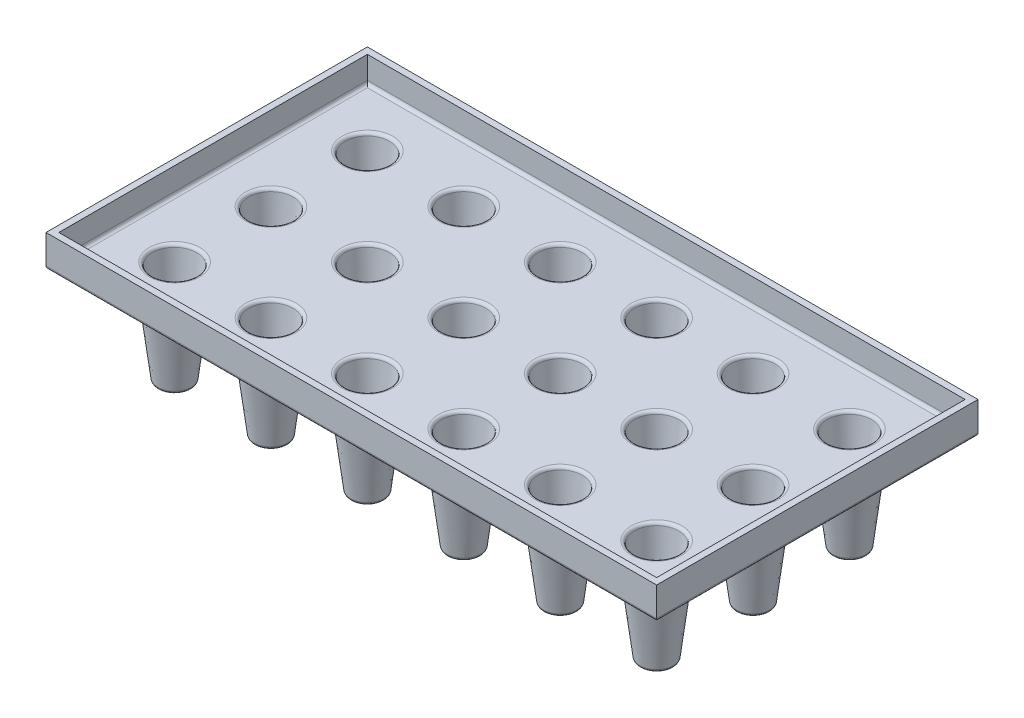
ISO-10303-21;
HEADER;
FILE_DESCRIPTION(('STEP AP214'),'2;1');
FILE_NAME('part.step','',(''),(''),'','','');
FILE_SCHEMA(('AUTOMOTIVE_DESIGN { 1 0 10303 214 1 1 1 1 }'));
ENDSEC;
DATA;
#1=APPLICATION_CONTEXT('core data for automotive mechanical design processes');
#2=APPLICATION_PROTOCOL_DEFINITION('international standard','automotive_design',2000,#1);
#3=PRODUCT_CONTEXT('',#1,'mechanical');
#4=PRODUCT('Part','Part','',(#3));
#5=PRODUCT_RELATED_PRODUCT_CATEGORY('part','',(#4));
#6=PRODUCT_DEFINITION_FORMATION('','',#4);
#7=PRODUCT_DEFINITION_CONTEXT('part definition',#1,'design');
#8=PRODUCT_DEFINITION('design','',#6,#7);
#9=PRODUCT_DEFINITION_SHAPE('','',#8);
#10=(LENGTH_UNIT() NAMED_UNIT(*) SI_UNIT(.MILLI.,.METRE.));
#11=(NAMED_UNIT(*) PLANE_ANGLE_UNIT() SI_UNIT($,.RADIAN.));
#12=(NAMED_UNIT(*) SI_UNIT($,.STERADIAN.) SOLID_ANGLE_UNIT());
#13=UNCERTAINTY_MEASURE_WITH_UNIT(LENGTH_MEASURE(1.E-05),#10,'distance_accuracy_value','');
#14=(GEOMETRIC_REPRESENTATION_CONTEXT(3) GLOBAL_UNCERTAINTY_ASSIGNED_CONTEXT((#13)) GLOBAL_UNIT_ASSIGNED_CONTEXT((#10,
#11,#12)) REPRESENTATION_CONTEXT('',''));
#15=CARTESIAN_POINT('',(0.,0.,0.));
#16=DIRECTION('',(0.,0.,1.));
#17=DIRECTION('',(1.,0.,0.));
#18=AXIS2_PLACEMENT_3D('',#15,#16,#17);
#19=CARTESIAN_POINT('',(0.,12.7,0.));
#20=DIRECTION('',(0.,-1.,0.));
#21=DIRECTION('',(0.,0.,-1.));
#22=AXIS2_PLACEMENT_3D('',#19,#20,#21);
#23=PLANE('',#22);
#24=DIRECTION('',(0.,0.,1.));
#25=VECTOR('',#24,1.);
#26=CARTESIAN_POINT('',(0.,12.7,-127.));
#27=LINE('',#26,#25);
#28=CARTESIAN_POINT('',(0.,12.7,-127.));
#29=VERTEX_POINT('',#28);
#30=CARTESIAN_POINT('',(0.,12.7,0.));
#31=VERTEX_POINT('',#30);
#32=EDGE_CURVE('E144',#29,#31,#27,.T.);
#33=ORIENTED_EDGE('',*,*,#32,.T.);
#34=DIRECTION('',(1.,0.,0.));
#35=VECTOR('',#34,1.);
#36=CARTESIAN_POINT('',(241.3,12.7,0.));
#37=LINE('',#36,#35);
#38=CARTESIAN_POINT('',(241.3,12.7,0.));
#39=VERTEX_POINT('',#38);
#40=EDGE_CURVE('E158',#31,#39,#37,.T.);
#41=ORIENTED_EDGE('',*,*,#40,.T.);
#42=DIRECTION('',(0.,0.,-1.));
#43=VECTOR('',#42,1.);
#44=CARTESIAN_POINT('',(241.3,12.7,-127.));
#45=LINE('',#44,#43);
#46=CARTESIAN_POINT('',(241.3,12.7,-127.));
#47=VERTEX_POINT('',#46);
#48=EDGE_CURVE('E160',#39,#47,#45,.T.);
#49=ORIENTED_EDGE('',*,*,#48,.T.);
#50=DIRECTION('',(-1.,0.,0.));
#51=VECTOR('',#50,1.);
#52=CARTESIAN_POINT('',(241.3,12.7,-127.));
#53=LINE('',#52,#51);
#54=EDGE_CURVE('E162',#47,#29,#53,.T.);
#55=ORIENTED_EDGE('',*,*,#54,.T.);
#56=EDGE_LOOP('',(#33,#41,#49,#55));
#57=FACE_BOUND('',#56,.T.);
#58=DIRECTION('',(0.,0.,1.));
#59=VECTOR('',#58,1.);
#60=CARTESIAN_POINT('',(2.54,12.7,0.));
#61=LINE('',#60,#59);
#62=CARTESIAN_POINT('',(2.53999999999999,12.7,-124.46));
#63=VERTEX_POINT('',#62);
#64=CARTESIAN_POINT('',(2.54,12.7,-2.54));
#65=VERTEX_POINT('',#64);
#66=EDGE_CURVE('E131',#63,#65,#61,.T.);
#67=ORIENTED_EDGE('',*,*,#66,.F.);
#68=DIRECTION('',(-1.,0.,0.));
#69=VECTOR('',#68,1.);
#70=CARTESIAN_POINT('',(0.,12.7,-124.46));
#71=LINE('',#70,#69);
#72=CARTESIAN_POINT('',(238.76,12.7,-124.46));
#73=VERTEX_POINT('',#72);
#74=EDGE_CURVE('E151',#73,#63,#71,.T.);
#75=ORIENTED_EDGE('',*,*,#74,.F.);
#76=DIRECTION('',(0.,0.,-1.));
#77=VECTOR('',#76,1.);
#78=CARTESIAN_POINT('',(238.76,12.7,0.));
#79=LINE('',#78,#77);
#80=CARTESIAN_POINT('',(238.76,12.7,-2.54000000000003));
#81=VERTEX_POINT('',#80);
#82=EDGE_CURVE('E149',#81,#73,#79,.T.);
#83=ORIENTED_EDGE('',*,*,#82,.F.);
#84=DIRECTION('',(1.,0.,0.));
#85=VECTOR('',#84,1.);
#86=CARTESIAN_POINT('',(0.,12.7,-2.54));
#87=LINE('',#86,#85);
#88=EDGE_CURVE('E140',#65,#81,#87,.T.);
#89=ORIENTED_EDGE('',*,*,#88,.F.);
#90=EDGE_LOOP('',(#67,#75,#83,#89));
#91=FACE_BOUND('',#90,.T.);
#92=ADVANCED_FACE('F37',(#57,#91),#23,.F.);
#93=CARTESIAN_POINT('',(0.,12.7,-127.));
#94=DIRECTION('',(1.,0.,0.));
#95=DIRECTION('',(0.,0.,-1.));
#96=AXIS2_PLACEMENT_3D('',#93,#94,#95);
#97=PLANE('',#96);
#98=DIRECTION('',(0.,-1.,0.));
#99=VECTOR('',#98,1.);
#100=CARTESIAN_POINT('',(0.,12.7,-127.));
#101=LINE('',#100,#99);
#102=CARTESIAN_POINT('',(0.,1.27,-127.));
#103=VERTEX_POINT('',#102);
#104=EDGE_CURVE('E164',#29,#103,#101,.T.);
#105=ORIENTED_EDGE('',*,*,#104,.T.);
#106=DIRECTION('',(0.,0.,1.));
#107=VECTOR('',#106,1.);
#108=CARTESIAN_POINT('',(0.,1.27,0.));
#109=LINE('',#108,#107);
#110=CARTESIAN_POINT('',(0.,1.27,0.));
#111=VERTEX_POINT('',#110);
#112=EDGE_CURVE('E402',#103,#111,#109,.T.);
#113=ORIENTED_EDGE('',*,*,#112,.T.);
#114=DIRECTION('',(0.,-1.,0.));
#115=VECTOR('',#114,1.);
#116=CARTESIAN_POINT('',(0.,12.7,0.));
#117=LINE('',#116,#115);
#118=EDGE_CURVE('E173',#31,#111,#117,.T.);
#119=ORIENTED_EDGE('',*,*,#118,.F.);
#120=ORIENTED_EDGE('',*,*,#32,.F.);
#121=EDGE_LOOP('',(#105,#113,#119,#120));
#122=FACE_BOUND('',#121,.T.);
#123=ADVANCED_FACE('F691',(#122),#97,.F.);
#124=CARTESIAN_POINT('',(241.3,12.7,0.));
#125=DIRECTION('',(0.,0.,-1.));
#126=DIRECTION('',(-1.,0.,0.));
#127=AXIS2_PLACEMENT_3D('',#124,#125,#126);
#128=PLANE('',#127);
#129=ORIENTED_EDGE('',*,*,#118,.T.);
#130=DIRECTION('',(1.,0.,0.));
#131=VECTOR('',#130,1.);
#132=CARTESIAN_POINT('',(241.3,1.27,0.));
#133=LINE('',#132,#131);
#134=CARTESIAN_POINT('',(241.3,1.27,0.));
#135=VERTEX_POINT('',#134);
#136=EDGE_CURVE('E400',#111,#135,#133,.T.);
#137=ORIENTED_EDGE('',*,*,#136,.T.);
#138=DIRECTION('',(0.,-1.,0.));
#139=VECTOR('',#138,1.);
#140=CARTESIAN_POINT('',(241.3,12.7,0.));
#141=LINE('',#140,#139);
#142=EDGE_CURVE('E170',#39,#135,#141,.T.);
#143=ORIENTED_EDGE('',*,*,#142,.F.);
#144=ORIENTED_EDGE('',*,*,#40,.F.);
#145=EDGE_LOOP('',(#129,#137,#143,#144));
#146=FACE_BOUND('',#145,.T.);
#147=ADVANCED_FACE('F697',(#146),#128,.F.);
#148=CARTESIAN_POINT('',(241.3,12.7,-127.));
#149=DIRECTION('',(-1.,0.,0.));
#150=DIRECTION('',(0.,0.,1.));
#151=AXIS2_PLACEMENT_3D('',#148,#149,#150);
#152=PLANE('',#151);
#153=ORIENTED_EDGE('',*,*,#142,.T.);
#154=DIRECTION('',(0.,0.,-1.));
#155=VECTOR('',#154,1.);
#156=CARTESIAN_POINT('',(241.3,1.27,-127.));
#157=LINE('',#156,#155);
#158=CARTESIAN_POINT('',(241.3,1.27,-127.));
#159=VERTEX_POINT('',#158);
#160=EDGE_CURVE('E398',#135,#159,#157,.T.);
#161=ORIENTED_EDGE('',*,*,#160,.T.);
#162=DIRECTION('',(0.,-1.,0.));
#163=VECTOR('',#162,1.);
#164=CARTESIAN_POINT('',(241.3,12.7,-127.));
#165=LINE('',#164,#163);
#166=EDGE_CURVE('E167',#47,#159,#165,.T.);
#167=ORIENTED_EDGE('',*,*,#166,.F.);
#168=ORIENTED_EDGE('',*,*,#48,.F.);
#169=EDGE_LOOP('',(#153,#161,#167,#168));
#170=FACE_BOUND('',#169,.T.);
#171=ADVANCED_FACE('F711',(#170),#152,.F.);
#172=CARTESIAN_POINT('',(241.3,12.7,-127.));
#173=DIRECTION('',(0.,0.,1.));
#174=DIRECTION('',(1.,0.,0.));
#175=AXIS2_PLACEMENT_3D('',#172,#173,#174);
#176=PLANE('',#175);
#177=ORIENTED_EDGE('',*,*,#166,.T.);
#178=DIRECTION('',(-1.,0.,0.));
#179=VECTOR('',#178,1.);
#180=CARTESIAN_POINT('',(0.,1.27,-127.));
#181=LINE('',#180,#179);
#182=EDGE_CURVE('E395',#159,#103,#181,.T.);
#183=ORIENTED_EDGE('',*,*,#182,.T.);
#184=ORIENTED_EDGE('',*,*,#104,.F.);
#185=ORIENTED_EDGE('',*,*,#54,.F.);
#186=EDGE_LOOP('',(#177,#183,#184,#185));
#187=FACE_BOUND('',#186,.T.);
#188=ADVANCED_FACE('F707',(#187),#176,.F.);
#189=CARTESIAN_POINT('',(0.,0.,0.));
#190=DIRECTION('',(0.,-1.,0.));
#191=DIRECTION('',(0.,0.,-1.));
#192=AXIS2_PLACEMENT_3D('',#189,#190,#191);
#193=PLANE('',#192);
#194=CARTESIAN_POINT('',(215.9,0.,-101.6));
#195=DIRECTION('',(0.,-1.,0.));
#196=DIRECTION('',(0.,0.,-1.));
#197=AXIS2_PLACEMENT_3D('',#194,#195,#196);
#198=CIRCLE('',#197,12.2642371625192);
#199=CARTESIAN_POINT('',(215.9,0.,-113.864237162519));
#200=VERTEX_POINT('',#199);
#201=EDGE_CURVE('E245',#200,#200,#198,.F.);
#202=ORIENTED_EDGE('',*,*,#201,.T.);
#203=EDGE_LOOP('',(#202));
#204=FACE_BOUND('',#203,.T.);
#205=CARTESIAN_POINT('',(177.8,0.,-101.6));
#206=DIRECTION('',(0.,-1.,0.));
#207=DIRECTION('',(0.,0.,-1.));
#208=AXIS2_PLACEMENT_3D('',#205,#206,#207);
#209=CIRCLE('',#208,12.2642371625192);
#210=CARTESIAN_POINT('',(177.8,0.,-113.864237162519));
#211=VERTEX_POINT('',#210);
#212=EDGE_CURVE('E242',#211,#211,#209,.F.);
#213=ORIENTED_EDGE('',*,*,#212,.T.);
#214=EDGE_LOOP('',(#213));
#215=FACE_BOUND('',#214,.T.);
#216=CARTESIAN_POINT('',(139.7,0.,-101.6));
#217=DIRECTION('',(0.,-1.,0.));
#218=DIRECTION('',(0.,0.,-1.));
#219=AXIS2_PLACEMENT_3D('',#216,#217,#218);
#220=CIRCLE('',#219,12.2642371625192);
#221=CARTESIAN_POINT('',(139.7,0.,-113.864237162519));
#222=VERTEX_POINT('',#221);
#223=EDGE_CURVE('E239',#222,#222,#220,.F.);
#224=ORIENTED_EDGE('',*,*,#223,.T.);
#225=EDGE_LOOP('',(#224));
#226=FACE_BOUND('',#225,.T.);
#227=CARTESIAN_POINT('',(101.6,0.,-101.6));
#228=DIRECTION('',(0.,-1.,0.));
#229=DIRECTION('',(0.,0.,-1.));
#230=AXIS2_PLACEMENT_3D('',#227,#228,#229);
#231=CIRCLE('',#230,12.2642371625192);
#232=CARTESIAN_POINT('',(101.6,0.,-113.864237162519));
#233=VERTEX_POINT('',#232);
#234=EDGE_CURVE('E236',#233,#233,#231,.F.);
#235=ORIENTED_EDGE('',*,*,#234,.T.);
#236=EDGE_LOOP('',(#235));
#237=FACE_BOUND('',#236,.T.);
#238=CARTESIAN_POINT('',(63.5,0.,-101.6));
#239=DIRECTION('',(0.,-1.,0.));
#240=DIRECTION('',(0.,0.,-1.));
#241=AXIS2_PLACEMENT_3D('',#238,#239,#240);
#242=CIRCLE('',#241,12.2642371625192);
#243=CARTESIAN_POINT('',(63.5,0.,-113.864237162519));
#244=VERTEX_POINT('',#243);
#245=EDGE_CURVE('E233',#244,#244,#242,.F.);
#246=ORIENTED_EDGE('',*,*,#245,.T.);
#247=EDGE_LOOP('',(#246));
#248=FACE_BOUND('',#247,.T.);
#249=CARTESIAN_POINT('',(25.4,0.,-101.6));
#250=DIRECTION('',(0.,-1.,0.));
#251=DIRECTION('',(0.,0.,-1.));
#252=AXIS2_PLACEMENT_3D('',#249,#250,#251);
#253=CIRCLE('',#252,12.2642371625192);
#254=CARTESIAN_POINT('',(25.4,0.,-113.864237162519));
#255=VERTEX_POINT('',#254);
#256=EDGE_CURVE('E230',#255,#255,#253,.F.);
#257=ORIENTED_EDGE('',*,*,#256,.T.);
#258=EDGE_LOOP('',(#257));
#259=FACE_BOUND('',#258,.T.);
#260=CARTESIAN_POINT('',(215.9,0.,-63.5));
#261=DIRECTION('',(0.,-1.,0.));
#262=DIRECTION('',(0.,0.,-1.));
#263=AXIS2_PLACEMENT_3D('',#260,#261,#262);
#264=CIRCLE('',#263,12.2642371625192);
#265=CARTESIAN_POINT('',(215.9,0.,-75.7642371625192));
#266=VERTEX_POINT('',#265);
#267=EDGE_CURVE('E227',#266,#266,#264,.F.);
#268=ORIENTED_EDGE('',*,*,#267,.T.);
#269=EDGE_LOOP('',(#268));
#270=FACE_BOUND('',#269,.T.);
#271=CARTESIAN_POINT('',(177.8,0.,-63.5));
#272=DIRECTION('',(0.,-1.,0.));
#273=DIRECTION('',(0.,0.,-1.));
#274=AXIS2_PLACEMENT_3D('',#271,#272,#273);
#275=CIRCLE('',#274,12.2642371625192);
#276=CARTESIAN_POINT('',(177.8,0.,-75.7642371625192));
#277=VERTEX_POINT('',#276);
#278=EDGE_CURVE('E224',#277,#277,#275,.F.);
#279=ORIENTED_EDGE('',*,*,#278,.T.);
#280=EDGE_LOOP('',(#279));
#281=FACE_BOUND('',#280,.T.);
#282=CARTESIAN_POINT('',(139.7,0.,-63.5));
#283=DIRECTION('',(0.,-1.,0.));
#284=DIRECTION('',(0.,0.,-1.));
#285=AXIS2_PLACEMENT_3D('',#282,#283,#284);
#286=CIRCLE('',#285,12.2642371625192);
#287=CARTESIAN_POINT('',(139.7,0.,-75.7642371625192));
#288=VERTEX_POINT('',#287);
#289=EDGE_CURVE('E221',#288,#288,#286,.F.);
#290=ORIENTED_EDGE('',*,*,#289,.T.);
#291=EDGE_LOOP('',(#290));
#292=FACE_BOUND('',#291,.T.);
#293=CARTESIAN_POINT('',(101.6,0.,-63.5));
#294=DIRECTION('',(0.,-1.,0.));
#295=DIRECTION('',(0.,0.,-1.));
#296=AXIS2_PLACEMENT_3D('',#293,#294,#295);
#297=CIRCLE('',#296,12.2642371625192);
#298=CARTESIAN_POINT('',(101.6,0.,-75.7642371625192));
#299=VERTEX_POINT('',#298);
#300=EDGE_CURVE('E218',#299,#299,#297,.F.);
#301=ORIENTED_EDGE('',*,*,#300,.T.);
#302=EDGE_LOOP('',(#301));
#303=FACE_BOUND('',#302,.T.);
#304=CARTESIAN_POINT('',(63.5,0.,-63.5));
#305=DIRECTION('',(0.,-1.,0.));
#306=DIRECTION('',(0.,0.,-1.));
#307=AXIS2_PLACEMENT_3D('',#304,#305,#306);
#308=CIRCLE('',#307,12.2642371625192);
#309=CARTESIAN_POINT('',(63.5,0.,-75.7642371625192));
#310=VERTEX_POINT('',#309);
#311=EDGE_CURVE('E215',#310,#310,#308,.F.);
#312=ORIENTED_EDGE('',*,*,#311,.T.);
#313=EDGE_LOOP('',(#312));
#314=FACE_BOUND('',#313,.T.);
#315=CARTESIAN_POINT('',(25.4,0.,-63.5));
#316=DIRECTION('',(0.,-1.,0.));
#317=DIRECTION('',(0.,0.,-1.));
#318=AXIS2_PLACEMENT_3D('',#315,#316,#317);
#319=CIRCLE('',#318,12.2642371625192);
#320=CARTESIAN_POINT('',(25.4,0.,-75.7642371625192));
#321=VERTEX_POINT('',#320);
#322=EDGE_CURVE('E212',#321,#321,#319,.F.);
#323=ORIENTED_EDGE('',*,*,#322,.T.);
#324=EDGE_LOOP('',(#323));
#325=FACE_BOUND('',#324,.T.);
#326=CARTESIAN_POINT('',(215.9,0.,-25.4));
#327=DIRECTION('',(0.,-1.,0.));
#328=DIRECTION('',(0.,0.,-1.));
#329=AXIS2_PLACEMENT_3D('',#326,#327,#328);
#330=CIRCLE('',#329,12.2642371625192);
#331=CARTESIAN_POINT('',(215.9,0.,-37.6642371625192));
#332=VERTEX_POINT('',#331);
#333=EDGE_CURVE('E209',#332,#332,#330,.F.);
#334=ORIENTED_EDGE('',*,*,#333,.T.);
#335=EDGE_LOOP('',(#334));
#336=FACE_BOUND('',#335,.T.);
#337=CARTESIAN_POINT('',(177.8,0.,-25.4));
#338=DIRECTION('',(0.,-1.,0.));
#339=DIRECTION('',(0.,0.,-1.));
#340=AXIS2_PLACEMENT_3D('',#337,#338,#339);
#341=CIRCLE('',#340,12.2642371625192);
#342=CARTESIAN_POINT('',(177.8,0.,-37.6642371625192));
#343=VERTEX_POINT('',#342);
#344=EDGE_CURVE('E206',#343,#343,#341,.F.);
#345=ORIENTED_EDGE('',*,*,#344,.T.);
#346=EDGE_LOOP('',(#345));
#347=FACE_BOUND('',#346,.T.);
#348=CARTESIAN_POINT('',(139.7,0.,-25.4));
#349=DIRECTION('',(0.,-1.,0.));
#350=DIRECTION('',(0.,0.,-1.));
#351=AXIS2_PLACEMENT_3D('',#348,#349,#350);
#352=CIRCLE('',#351,12.2642371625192);
#353=CARTESIAN_POINT('',(139.7,0.,-37.6642371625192));
#354=VERTEX_POINT('',#353);
#355=EDGE_CURVE('E203',#354,#354,#352,.F.);
#356=ORIENTED_EDGE('',*,*,#355,.T.);
#357=EDGE_LOOP('',(#356));
#358=FACE_BOUND('',#357,.T.);
#359=CARTESIAN_POINT('',(101.6,0.,-25.4));
#360=DIRECTION('',(0.,-1.,0.));
#361=DIRECTION('',(0.,0.,-1.));
#362=AXIS2_PLACEMENT_3D('',#359,#360,#361);
#363=CIRCLE('',#362,12.2642371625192);
#364=CARTESIAN_POINT('',(101.6,0.,-37.6642371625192));
#365=VERTEX_POINT('',#364);
#366=EDGE_CURVE('E200',#365,#365,#363,.F.);
#367=ORIENTED_EDGE('',*,*,#366,.T.);
#368=EDGE_LOOP('',(#367));
#369=FACE_BOUND('',#368,.T.);
#370=CARTESIAN_POINT('',(63.5,0.,-25.4));
#371=DIRECTION('',(0.,-1.,0.));
#372=DIRECTION('',(0.,0.,-1.));
#373=AXIS2_PLACEMENT_3D('',#370,#371,#372);
#374=CIRCLE('',#373,12.2642371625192);
#375=CARTESIAN_POINT('',(63.5,0.,-37.6642371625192));
#376=VERTEX_POINT('',#375);
#377=EDGE_CURVE('E197',#376,#376,#374,.F.);
#378=ORIENTED_EDGE('',*,*,#377,.T.);
#379=EDGE_LOOP('',(#378));
#380=FACE_BOUND('',#379,.T.);
#381=CARTESIAN_POINT('',(25.4,0.,-25.4));
#382=DIRECTION('',(0.,-1.,0.));
#383=DIRECTION('',(0.,0.,-1.));
#384=AXIS2_PLACEMENT_3D('',#381,#382,#383);
#385=CIRCLE('',#384,12.2642371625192);
#386=CARTESIAN_POINT('',(25.4,0.,-37.6642371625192));
#387=VERTEX_POINT('',#386);
#388=EDGE_CURVE('E194',#387,#387,#385,.F.);
#389=ORIENTED_EDGE('',*,*,#388,.T.);
#390=EDGE_LOOP('',(#389));
#391=FACE_BOUND('',#390,.T.);
#392=DIRECTION('',(0.,0.,1.));
#393=VECTOR('',#392,1.);
#394=CARTESIAN_POINT('',(1.26999999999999,0.,-127.));
#395=LINE('',#394,#393);
#396=CARTESIAN_POINT('',(1.27,0.,-1.27));
#397=VERTEX_POINT('',#396);
#398=CARTESIAN_POINT('',(1.26999999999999,0.,-125.73));
#399=VERTEX_POINT('',#398);
#400=EDGE_CURVE('E185',#397,#399,#395,.F.);
#401=ORIENTED_EDGE('',*,*,#400,.T.);
#402=DIRECTION('',(-1.,0.,0.));
#403=VECTOR('',#402,1.);
#404=CARTESIAN_POINT('',(241.3,0.,-125.73));
#405=LINE('',#404,#403);
#406=CARTESIAN_POINT('',(240.03,0.,-125.73));
#407=VERTEX_POINT('',#406);
#408=EDGE_CURVE('E191',#399,#407,#405,.F.);
#409=ORIENTED_EDGE('',*,*,#408,.T.);
#410=DIRECTION('',(0.,0.,-1.));
#411=VECTOR('',#410,1.);
#412=CARTESIAN_POINT('',(240.03,0.,0.));
#413=LINE('',#412,#411);
#414=CARTESIAN_POINT('',(240.03,0.,-1.27000000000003));
#415=VERTEX_POINT('',#414);
#416=EDGE_CURVE('E189',#407,#415,#413,.F.);
#417=ORIENTED_EDGE('',*,*,#416,.T.);
#418=DIRECTION('',(1.,0.,0.));
#419=VECTOR('',#418,1.);
#420=CARTESIAN_POINT('',(0.,0.,-1.27));
#421=LINE('',#420,#419);
#422=EDGE_CURVE('E187',#415,#397,#421,.F.);
#423=ORIENTED_EDGE('',*,*,#422,.T.);
#424=EDGE_LOOP('',(#401,#409,#417,#423));
#425=FACE_BOUND('',#424,.T.);
#426=ADVANCED_FACE('F704',(#204,#215,#226,#237,#248,#259,#270,#281,#292,#303,#314,#325,#336,
#347,#358,#369,#380,#391,#425),#193,.T.);
#427=CARTESIAN_POINT('',(25.4,12.7,-25.4));
#428=DIRECTION('',(0.,1.,0.));
#429=DIRECTION('',(0.,0.,1.));
#430=AXIS2_PLACEMENT_3D('',#427,#428,#429);
#431=CONICAL_SURFACE('',#430,12.7,0.122173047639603);
#432=CARTESIAN_POINT('',(25.4,-1.11522593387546,-25.4));
#433=DIRECTION('',(0.,1.,0.));
#434=DIRECTION('',(0.,0.,1.));
#435=AXIS2_PLACEMENT_3D('',#432,#433,#434);
#436=CIRCLE('',#435,11.0037035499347);
#437=CARTESIAN_POINT('',(25.4,-1.11522593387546,-14.3962964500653));
#438=VERTEX_POINT('',#437);
#439=EDGE_CURVE('E392',#438,#438,#436,.F.);
#440=ORIENTED_EDGE('',*,*,#439,.T.);
#441=EDGE_LOOP('',(#440));
#442=FACE_BOUND('',#441,.T.);
#443=CARTESIAN_POINT('',(25.4,-36.9847740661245,-25.4));
#444=DIRECTION('',(0.,1.,0.));
#445=DIRECTION('',(0.,0.,1.));
#446=AXIS2_PLACEMENT_3D('',#443,#444,#445);
#447=CIRCLE('',#446,6.59947683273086);
#448=CARTESIAN_POINT('',(25.4,-36.9847740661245,-18.8005231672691));
#449=VERTEX_POINT('',#448);
#450=EDGE_CURVE('E389',#449,#449,#447,.T.);
#451=ORIENTED_EDGE('',*,*,#450,.T.);
#452=EDGE_LOOP('',(#451));
#453=FACE_BOUND('',#452,.T.);
#454=ADVANCED_FACE('F702',(#442,#453),#431,.T.);
#455=CARTESIAN_POINT('',(25.4,-38.1,-25.4));
#456=DIRECTION('',(0.,1.,0.));
#457=DIRECTION('',(0.,0.,1.));
#458=AXIS2_PLACEMENT_3D('',#455,#456,#457);
#459=PLANE('',#458);
#460=CARTESIAN_POINT('',(25.4,-38.1,-25.4));
#461=DIRECTION('',(0.,1.,0.));
#462=DIRECTION('',(0.,0.,1.));
#463=AXIS2_PLACEMENT_3D('',#460,#461,#462);
#464=CIRCLE('',#463,5.33894322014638);
#465=CARTESIAN_POINT('',(25.4,-38.1,-20.0610567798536));
#466=VERTEX_POINT('',#465);
#467=EDGE_CURVE('E404',#466,#466,#464,.F.);
#468=ORIENTED_EDGE('',*,*,#467,.T.);
#469=EDGE_LOOP('',(#468));
#470=FACE_BOUND('',#469,.T.);
#471=ADVANCED_FACE('F1308',(#470),#459,.F.);
#472=CARTESIAN_POINT('',(63.5,12.7,-25.4));
#473=DIRECTION('',(0.,1.,0.));
#474=DIRECTION('',(0.,0.,1.));
#475=AXIS2_PLACEMENT_3D('',#472,#473,#474);
#476=CONICAL_SURFACE('',#475,12.7,0.122173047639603);
#477=CARTESIAN_POINT('',(63.5,-1.11522593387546,-25.4));
#478=DIRECTION('',(0.,1.,0.));
#479=DIRECTION('',(0.,0.,1.));
#480=AXIS2_PLACEMENT_3D('',#477,#478,#479);
#481=CIRCLE('',#480,11.0037035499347);
#482=CARTESIAN_POINT('',(63.5,-1.11522593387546,-14.3962964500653));
#483=VERTEX_POINT('',#482);
#484=EDGE_CURVE('E386',#483,#483,#481,.F.);
#485=ORIENTED_EDGE('',*,*,#484,.T.);
#486=EDGE_LOOP('',(#485));
#487=FACE_BOUND('',#486,.T.);
#488=CARTESIAN_POINT('',(63.5,-36.9847740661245,-25.4));
#489=DIRECTION('',(0.,1.,0.));
#490=DIRECTION('',(0.,0.,1.));
#491=AXIS2_PLACEMENT_3D('',#488,#489,#490);
#492=CIRCLE('',#491,6.59947683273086);
#493=CARTESIAN_POINT('',(63.5,-36.9847740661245,-18.8005231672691));
#494=VERTEX_POINT('',#493);
#495=EDGE_CURVE('E383',#494,#494,#492,.T.);
#496=ORIENTED_EDGE('',*,*,#495,.T.);
#497=EDGE_LOOP('',(#496));
#498=FACE_BOUND('',#497,.T.);
#499=ADVANCED_FACE('F1305',(#487,#498),#476,.T.);
#500=CARTESIAN_POINT('',(63.5,-38.1,-25.4));
#501=DIRECTION('',(0.,1.,0.));
#502=DIRECTION('',(0.,0.,1.));
#503=AXIS2_PLACEMENT_3D('',#500,#501,#502);
#504=PLANE('',#503);
#505=CARTESIAN_POINT('',(63.5,-38.1,-25.4));
#506=DIRECTION('',(0.,1.,0.));
#507=DIRECTION('',(0.,0.,1.));
#508=AXIS2_PLACEMENT_3D('',#505,#506,#507);
#509=CIRCLE('',#508,5.33894322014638);
#510=CARTESIAN_POINT('',(63.5,-38.1,-20.0610567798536));
#511=VERTEX_POINT('',#510);
#512=EDGE_CURVE('E407',#511,#511,#509,.F.);
#513=ORIENTED_EDGE('',*,*,#512,.T.);
#514=EDGE_LOOP('',(#513));
#515=FACE_BOUND('',#514,.T.);
#516=ADVANCED_FACE('F727',(#515),#504,.F.);
#517=CARTESIAN_POINT('',(101.6,-38.1,-25.4));
#518=DIRECTION('',(0.,1.,0.));
#519=DIRECTION('',(0.,0.,1.));
#520=AXIS2_PLACEMENT_3D('',#517,#518,#519);
#521=PLANE('',#520);
#522=CARTESIAN_POINT('',(101.6,-38.1,-25.4));
#523=DIRECTION('',(0.,1.,0.));
#524=DIRECTION('',(0.,0.,1.));
#525=AXIS2_PLACEMENT_3D('',#522,#523,#524);
#526=CIRCLE('',#525,5.33894322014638);
#527=CARTESIAN_POINT('',(101.6,-38.1,-20.0610567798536));
#528=VERTEX_POINT('',#527);
#529=EDGE_CURVE('E380',#528,#528,#526,.F.);
#530=ORIENTED_EDGE('',*,*,#529,.T.);
#531=EDGE_LOOP('',(#530));
#532=FACE_BOUND('',#531,.T.);
#533=ADVANCED_FACE('F723',(#532),#521,.F.);
#534=CARTESIAN_POINT('',(101.6,12.7,-25.4));
#535=DIRECTION('',(0.,1.,0.));
#536=DIRECTION('',(0.,0.,1.));
#537=AXIS2_PLACEMENT_3D('',#534,#535,#536);
#538=CONICAL_SURFACE('',#537,12.7,0.122173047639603);
#539=CARTESIAN_POINT('',(101.6,-36.9847740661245,-25.4));
#540=DIRECTION('',(0.,1.,0.));
#541=DIRECTION('',(0.,0.,1.));
#542=AXIS2_PLACEMENT_3D('',#539,#540,#541);
#543=CIRCLE('',#542,6.59947683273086);
#544=CARTESIAN_POINT('',(101.6,-36.9847740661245,-18.8005231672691));
#545=VERTEX_POINT('',#544);
#546=EDGE_CURVE('E377',#545,#545,#543,.T.);
#547=ORIENTED_EDGE('',*,*,#546,.T.);
#548=EDGE_LOOP('',(#547));
#549=FACE_BOUND('',#548,.T.);
#550=CARTESIAN_POINT('',(101.6,-1.11522593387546,-25.4));
#551=DIRECTION('',(0.,1.,0.));
#552=DIRECTION('',(0.,0.,1.));
#553=AXIS2_PLACEMENT_3D('',#550,#551,#552);
#554=CIRCLE('',#553,11.0037035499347);
#555=CARTESIAN_POINT('',(101.6,-1.11522593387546,-14.3962964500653));
#556=VERTEX_POINT('',#555);
#557=EDGE_CURVE('E374',#556,#556,#554,.F.);
#558=ORIENTED_EDGE('',*,*,#557,.T.);
#559=EDGE_LOOP('',(#558));
#560=FACE_BOUND('',#559,.T.);
#561=ADVANCED_FACE('F719',(#549,#560),#538,.T.);
#562=CARTESIAN_POINT('',(139.7,-38.1,-25.4));
#563=DIRECTION('',(0.,1.,0.));
#564=DIRECTION('',(0.,0.,1.));
#565=AXIS2_PLACEMENT_3D('',#562,#563,#564);
#566=PLANE('',#565);
#567=CARTESIAN_POINT('',(139.7,-38.1,-25.4));
#568=DIRECTION('',(0.,1.,0.));
#569=DIRECTION('',(0.,0.,1.));
#570=AXIS2_PLACEMENT_3D('',#567,#568,#569);
#571=CIRCLE('',#570,5.33894322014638);
#572=CARTESIAN_POINT('',(139.7,-38.1,-20.0610567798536));
#573=VERTEX_POINT('',#572);
#574=EDGE_CURVE('E371',#573,#573,#571,.F.);
#575=ORIENTED_EDGE('',*,*,#574,.T.);
#576=EDGE_LOOP('',(#575));
#577=FACE_BOUND('',#576,.T.);
#578=ADVANCED_FACE('F722',(#577),#566,.F.);
#579=CARTESIAN_POINT('',(139.7,12.7,-25.4));
#580=DIRECTION('',(0.,1.,0.));
#581=DIRECTION('',(0.,0.,1.));
#582=AXIS2_PLACEMENT_3D('',#579,#580,#581);
#583=CONICAL_SURFACE('',#582,12.7,0.122173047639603);
#584=CARTESIAN_POINT('',(139.7,-36.9847740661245,-25.4));
#585=DIRECTION('',(0.,1.,0.));
#586=DIRECTION('',(0.,0.,1.));
#587=AXIS2_PLACEMENT_3D('',#584,#585,#586);
#588=CIRCLE('',#587,6.59947683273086);
#589=CARTESIAN_POINT('',(139.7,-36.9847740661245,-18.8005231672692));
#590=VERTEX_POINT('',#589);
#591=EDGE_CURVE('E368',#590,#590,#588,.T.);
#592=ORIENTED_EDGE('',*,*,#591,.T.);
#593=EDGE_LOOP('',(#592));
#594=FACE_BOUND('',#593,.T.);
#595=CARTESIAN_POINT('',(139.7,-1.11522593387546,-25.4));
#596=DIRECTION('',(0.,1.,0.));
#597=DIRECTION('',(0.,0.,1.));
#598=AXIS2_PLACEMENT_3D('',#595,#596,#597);
#599=CIRCLE('',#598,11.0037035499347);
#600=CARTESIAN_POINT('',(139.7,-1.11522593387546,-14.3962964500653));
#601=VERTEX_POINT('',#600);
#602=EDGE_CURVE('E365',#601,#601,#599,.F.);
#603=ORIENTED_EDGE('',*,*,#602,.T.);
#604=EDGE_LOOP('',(#603));
#605=FACE_BOUND('',#604,.T.);
#606=ADVANCED_FACE('F729',(#594,#605),#583,.T.);
#607=CARTESIAN_POINT('',(177.8,-38.1,-25.4));
#608=DIRECTION('',(0.,1.,0.));
#609=DIRECTION('',(0.,0.,1.));
#610=AXIS2_PLACEMENT_3D('',#607,#608,#609);
#611=PLANE('',#610);
#612=CARTESIAN_POINT('',(177.8,-38.1,-25.4));
#613=DIRECTION('',(0.,1.,0.));
#614=DIRECTION('',(0.,0.,1.));
#615=AXIS2_PLACEMENT_3D('',#612,#613,#614);
#616=CIRCLE('',#615,5.33894322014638);
#617=CARTESIAN_POINT('',(177.8,-38.1,-20.0610567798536));
#618=VERTEX_POINT('',#617);
#619=EDGE_CURVE('E362',#618,#618,#616,.F.);
#620=ORIENTED_EDGE('',*,*,#619,.T.);
#621=EDGE_LOOP('',(#620));
#622=FACE_BOUND('',#621,.T.);
#623=ADVANCED_FACE('F732',(#622),#611,.F.);
#624=CARTESIAN_POINT('',(177.8,12.7,-25.4));
#625=DIRECTION('',(0.,1.,0.));
#626=DIRECTION('',(0.,0.,1.));
#627=AXIS2_PLACEMENT_3D('',#624,#625,#626);
#628=CONICAL_SURFACE('',#627,12.7,0.122173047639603);
#629=CARTESIAN_POINT('',(177.8,-36.9847740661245,-25.4));
#630=DIRECTION('',(0.,1.,0.));
#631=DIRECTION('',(0.,0.,1.));
#632=AXIS2_PLACEMENT_3D('',#629,#630,#631);
#633=CIRCLE('',#632,6.59947683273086);
#634=CARTESIAN_POINT('',(177.8,-36.9847740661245,-18.8005231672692));
#635=VERTEX_POINT('',#634);
#636=EDGE_CURVE('E359',#635,#635,#633,.T.);
#637=ORIENTED_EDGE('',*,*,#636,.T.);
#638=EDGE_LOOP('',(#637));
#639=FACE_BOUND('',#638,.T.);
#640=CARTESIAN_POINT('',(177.8,-1.11522593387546,-25.4));
#641=DIRECTION('',(0.,1.,0.));
#642=DIRECTION('',(0.,0.,1.));
#643=AXIS2_PLACEMENT_3D('',#640,#641,#642);
#644=CIRCLE('',#643,11.0037035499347);
#645=CARTESIAN_POINT('',(177.8,-1.11522593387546,-14.3962964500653));
#646=VERTEX_POINT('',#645);
#647=EDGE_CURVE('E356',#646,#646,#644,.F.);
#648=ORIENTED_EDGE('',*,*,#647,.T.);
#649=EDGE_LOOP('',(#648));
#650=FACE_BOUND('',#649,.T.);
#651=ADVANCED_FACE('F737',(#639,#650),#628,.T.);
#652=CARTESIAN_POINT('',(215.9,-38.1,-25.4));
#653=DIRECTION('',(0.,1.,0.));
#654=DIRECTION('',(0.,0.,1.));
#655=AXIS2_PLACEMENT_3D('',#652,#653,#654);
#656=PLANE('',#655);
#657=CARTESIAN_POINT('',(215.9,-38.1,-25.4));
#658=DIRECTION('',(0.,1.,0.));
#659=DIRECTION('',(0.,0.,1.));
#660=AXIS2_PLACEMENT_3D('',#657,#658,#659);
#661=CIRCLE('',#660,5.33894322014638);
#662=CARTESIAN_POINT('',(215.9,-38.1,-20.0610567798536));
#663=VERTEX_POINT('',#662);
#664=EDGE_CURVE('E353',#663,#663,#661,.F.);
#665=ORIENTED_EDGE('',*,*,#664,.T.);
#666=EDGE_LOOP('',(#665));
#667=FACE_BOUND('',#666,.T.);
#668=ADVANCED_FACE('F740',(#667),#656,.F.);
#669=CARTESIAN_POINT('',(215.9,12.7,-25.4));
#670=DIRECTION('',(0.,1.,0.));
#671=DIRECTION('',(0.,0.,1.));
#672=AXIS2_PLACEMENT_3D('',#669,#670,#671);
#673=CONICAL_SURFACE('',#672,12.7,0.122173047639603);
#674=CARTESIAN_POINT('',(215.9,-36.9847740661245,-25.4));
#675=DIRECTION('',(0.,1.,0.));
#676=DIRECTION('',(0.,0.,1.));
#677=AXIS2_PLACEMENT_3D('',#674,#675,#676);
#678=CIRCLE('',#677,6.59947683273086);
#679=CARTESIAN_POINT('',(215.9,-36.9847740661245,-18.8005231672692));
#680=VERTEX_POINT('',#679);
#681=EDGE_CURVE('E350',#680,#680,#678,.T.);
#682=ORIENTED_EDGE('',*,*,#681,.T.);
#683=EDGE_LOOP('',(#682));
#684=FACE_BOUND('',#683,.T.);
#685=CARTESIAN_POINT('',(215.9,-1.11522593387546,-25.4));
#686=DIRECTION('',(0.,1.,0.));
#687=DIRECTION('',(0.,0.,1.));
#688=AXIS2_PLACEMENT_3D('',#685,#686,#687);
#689=CIRCLE('',#688,11.0037035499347);
#690=CARTESIAN_POINT('',(215.9,-1.11522593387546,-14.3962964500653));
#691=VERTEX_POINT('',#690);
#692=EDGE_CURVE('E347',#691,#691,#689,.F.);
#693=ORIENTED_EDGE('',*,*,#692,.T.);
#694=EDGE_LOOP('',(#693));
#695=FACE_BOUND('',#694,.T.);
#696=ADVANCED_FACE('F745',(#684,#695),#673,.T.);
#697=CARTESIAN_POINT('',(25.4,-38.1,-63.5));
#698=DIRECTION('',(0.,1.,0.));
#699=DIRECTION('',(0.,0.,1.));
#700=AXIS2_PLACEMENT_3D('',#697,#698,#699);
#701=PLANE('',#700);
#702=CARTESIAN_POINT('',(25.4,-38.1,-63.5));
#703=DIRECTION('',(0.,1.,0.));
#704=DIRECTION('',(0.,0.,1.));
#705=AXIS2_PLACEMENT_3D('',#702,#703,#704);
#706=CIRCLE('',#705,5.33894322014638);
#707=CARTESIAN_POINT('',(25.4,-38.1,-58.1610567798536));
#708=VERTEX_POINT('',#707);
#709=EDGE_CURVE('E344',#708,#708,#706,.F.);
#710=ORIENTED_EDGE('',*,*,#709,.T.);
#711=EDGE_LOOP('',(#710));
#712=FACE_BOUND('',#711,.T.);
#713=ADVANCED_FACE('F748',(#712),#701,.F.);
#714=CARTESIAN_POINT('',(25.4,12.7,-63.5));
#715=DIRECTION('',(0.,1.,0.));
#716=DIRECTION('',(0.,0.,1.));
#717=AXIS2_PLACEMENT_3D('',#714,#715,#716);
#718=CONICAL_SURFACE('',#717,12.7,0.122173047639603);
#719=CARTESIAN_POINT('',(25.4,-36.9847740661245,-63.5));
#720=DIRECTION('',(0.,1.,0.));
#721=DIRECTION('',(0.,0.,1.));
#722=AXIS2_PLACEMENT_3D('',#719,#720,#721);
#723=CIRCLE('',#722,6.59947683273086);
#724=CARTESIAN_POINT('',(25.4,-36.9847740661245,-56.9005231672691));
#725=VERTEX_POINT('',#724);
#726=EDGE_CURVE('E341',#725,#725,#723,.T.);
#727=ORIENTED_EDGE('',*,*,#726,.T.);
#728=EDGE_LOOP('',(#727));
#729=FACE_BOUND('',#728,.T.);
#730=CARTESIAN_POINT('',(25.4,-1.11522593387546,-63.5));
#731=DIRECTION('',(0.,1.,0.));
#732=DIRECTION('',(0.,0.,1.));
#733=AXIS2_PLACEMENT_3D('',#730,#731,#732);
#734=CIRCLE('',#733,11.0037035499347);
#735=CARTESIAN_POINT('',(25.4,-1.11522593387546,-52.4962964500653));
#736=VERTEX_POINT('',#735);
#737=EDGE_CURVE('E338',#736,#736,#734,.F.);
#738=ORIENTED_EDGE('',*,*,#737,.T.);
#739=EDGE_LOOP('',(#738));
#740=FACE_BOUND('',#739,.T.);
#741=ADVANCED_FACE('F753',(#729,#740),#718,.T.);
#742=CARTESIAN_POINT('',(63.5,-38.1,-63.5));
#743=DIRECTION('',(0.,1.,0.));
#744=DIRECTION('',(0.,0.,1.));
#745=AXIS2_PLACEMENT_3D('',#742,#743,#744);
#746=PLANE('',#745);
#747=CARTESIAN_POINT('',(63.5,-38.1,-63.5));
#748=DIRECTION('',(0.,1.,0.));
#749=DIRECTION('',(0.,0.,1.));
#750=AXIS2_PLACEMENT_3D('',#747,#748,#749);
#751=CIRCLE('',#750,5.33894322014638);
#752=CARTESIAN_POINT('',(63.5,-38.1,-58.1610567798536));
#753=VERTEX_POINT('',#752);
#754=EDGE_CURVE('E335',#753,#753,#751,.F.);
#755=ORIENTED_EDGE('',*,*,#754,.T.);
#756=EDGE_LOOP('',(#755));
#757=FACE_BOUND('',#756,.T.);
#758=ADVANCED_FACE('F756',(#757),#746,.F.);
#759=CARTESIAN_POINT('',(63.5,12.7,-63.5));
#760=DIRECTION('',(0.,1.,0.));
#761=DIRECTION('',(0.,0.,1.));
#762=AXIS2_PLACEMENT_3D('',#759,#760,#761);
#763=CONICAL_SURFACE('',#762,12.7,0.122173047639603);
#764=CARTESIAN_POINT('',(63.5,-36.9847740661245,-63.5));
#765=DIRECTION('',(0.,1.,0.));
#766=DIRECTION('',(0.,0.,1.));
#767=AXIS2_PLACEMENT_3D('',#764,#765,#766);
#768=CIRCLE('',#767,6.59947683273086);
#769=CARTESIAN_POINT('',(63.5,-36.9847740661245,-56.9005231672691));
#770=VERTEX_POINT('',#769);
#771=EDGE_CURVE('E332',#770,#770,#768,.T.);
#772=ORIENTED_EDGE('',*,*,#771,.T.);
#773=EDGE_LOOP('',(#772));
#774=FACE_BOUND('',#773,.T.);
#775=CARTESIAN_POINT('',(63.5,-1.11522593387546,-63.5));
#776=DIRECTION('',(0.,1.,0.));
#777=DIRECTION('',(0.,0.,1.));
#778=AXIS2_PLACEMENT_3D('',#775,#776,#777);
#779=CIRCLE('',#778,11.0037035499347);
#780=CARTESIAN_POINT('',(63.5,-1.11522593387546,-52.4962964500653));
#781=VERTEX_POINT('',#780);
#782=EDGE_CURVE('E329',#781,#781,#779,.F.);
#783=ORIENTED_EDGE('',*,*,#782,.T.);
#784=EDGE_LOOP('',(#783));
#785=FACE_BOUND('',#784,.T.);
#786=ADVANCED_FACE('F761',(#774,#785),#763,.T.);
#787=CARTESIAN_POINT('',(101.6,-38.1,-63.5));
#788=DIRECTION('',(0.,1.,0.));
#789=DIRECTION('',(0.,0.,1.));
#790=AXIS2_PLACEMENT_3D('',#787,#788,#789);
#791=PLANE('',#790);
#792=CARTESIAN_POINT('',(101.6,-38.1,-63.5));
#793=DIRECTION('',(0.,1.,0.));
#794=DIRECTION('',(0.,0.,1.));
#795=AXIS2_PLACEMENT_3D('',#792,#793,#794);
#796=CIRCLE('',#795,5.33894322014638);
#797=CARTESIAN_POINT('',(101.6,-38.1,-58.1610567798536));
#798=VERTEX_POINT('',#797);
#799=EDGE_CURVE('E326',#798,#798,#796,.F.);
#800=ORIENTED_EDGE('',*,*,#799,.T.);
#801=EDGE_LOOP('',(#800));
#802=FACE_BOUND('',#801,.T.);
#803=ADVANCED_FACE('F764',(#802),#791,.F.);
#804=CARTESIAN_POINT('',(101.6,12.7,-63.5));
#805=DIRECTION('',(0.,1.,0.));
#806=DIRECTION('',(0.,0.,1.));
#807=AXIS2_PLACEMENT_3D('',#804,#805,#806);
#808=CONICAL_SURFACE('',#807,12.7,0.122173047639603);
#809=CARTESIAN_POINT('',(101.6,-36.9847740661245,-63.5));
#810=DIRECTION('',(0.,1.,0.));
#811=DIRECTION('',(0.,0.,1.));
#812=AXIS2_PLACEMENT_3D('',#809,#810,#811);
#813=CIRCLE('',#812,6.59947683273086);
#814=CARTESIAN_POINT('',(101.6,-36.9847740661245,-56.9005231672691));
#815=VERTEX_POINT('',#814);
#816=EDGE_CURVE('E323',#815,#815,#813,.T.);
#817=ORIENTED_EDGE('',*,*,#816,.T.);
#818=EDGE_LOOP('',(#817));
#819=FACE_BOUND('',#818,.T.);
#820=CARTESIAN_POINT('',(101.6,-1.11522593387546,-63.5));
#821=DIRECTION('',(0.,1.,0.));
#822=DIRECTION('',(0.,0.,1.));
#823=AXIS2_PLACEMENT_3D('',#820,#821,#822);
#824=CIRCLE('',#823,11.0037035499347);
#825=CARTESIAN_POINT('',(101.6,-1.11522593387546,-52.4962964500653));
#826=VERTEX_POINT('',#825);
#827=EDGE_CURVE('E320',#826,#826,#824,.F.);
#828=ORIENTED_EDGE('',*,*,#827,.T.);
#829=EDGE_LOOP('',(#828));
#830=FACE_BOUND('',#829,.T.);
#831=ADVANCED_FACE('F769',(#819,#830),#808,.T.);
#832=CARTESIAN_POINT('',(139.7,-38.1,-63.5));
#833=DIRECTION('',(0.,1.,0.));
#834=DIRECTION('',(0.,0.,1.));
#835=AXIS2_PLACEMENT_3D('',#832,#833,#834);
#836=PLANE('',#835);
#837=CARTESIAN_POINT('',(139.7,-38.1,-63.5));
#838=DIRECTION('',(0.,1.,0.));
#839=DIRECTION('',(0.,0.,1.));
#840=AXIS2_PLACEMENT_3D('',#837,#838,#839);
#841=CIRCLE('',#840,5.33894322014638);
#842=CARTESIAN_POINT('',(139.7,-38.1,-58.1610567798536));
#843=VERTEX_POINT('',#842);
#844=EDGE_CURVE('E317',#843,#843,#841,.F.);
#845=ORIENTED_EDGE('',*,*,#844,.T.);
#846=EDGE_LOOP('',(#845));
#847=FACE_BOUND('',#846,.T.);
#848=ADVANCED_FACE('F772',(#847),#836,.F.);
#849=CARTESIAN_POINT('',(139.7,12.7,-63.5));
#850=DIRECTION('',(0.,1.,0.));
#851=DIRECTION('',(0.,0.,1.));
#852=AXIS2_PLACEMENT_3D('',#849,#850,#851);
#853=CONICAL_SURFACE('',#852,12.7,0.122173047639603);
#854=CARTESIAN_POINT('',(139.7,-36.9847740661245,-63.5));
#855=DIRECTION('',(0.,1.,0.));
#856=DIRECTION('',(0.,0.,1.));
#857=AXIS2_PLACEMENT_3D('',#854,#855,#856);
#858=CIRCLE('',#857,6.59947683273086);
#859=CARTESIAN_POINT('',(139.7,-36.9847740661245,-56.9005231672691));
#860=VERTEX_POINT('',#859);
#861=EDGE_CURVE('E314',#860,#860,#858,.T.);
#862=ORIENTED_EDGE('',*,*,#861,.T.);
#863=EDGE_LOOP('',(#862));
#864=FACE_BOUND('',#863,.T.);
#865=CARTESIAN_POINT('',(139.7,-1.11522593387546,-63.5));
#866=DIRECTION('',(0.,1.,0.));
#867=DIRECTION('',(0.,0.,1.));
#868=AXIS2_PLACEMENT_3D('',#865,#866,#867);
#869=CIRCLE('',#868,11.0037035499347);
#870=CARTESIAN_POINT('',(139.7,-1.11522593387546,-52.4962964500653));
#871=VERTEX_POINT('',#870);
#872=EDGE_CURVE('E311',#871,#871,#869,.F.);
#873=ORIENTED_EDGE('',*,*,#872,.T.);
#874=EDGE_LOOP('',(#873));
#875=FACE_BOUND('',#874,.T.);
#876=ADVANCED_FACE('F777',(#864,#875),#853,.T.);
#877=CARTESIAN_POINT('',(177.8,-38.1,-63.5));
#878=DIRECTION('',(0.,1.,0.));
#879=DIRECTION('',(0.,0.,1.));
#880=AXIS2_PLACEMENT_3D('',#877,#878,#879);
#881=PLANE('',#880);
#882=CARTESIAN_POINT('',(177.8,-38.1,-63.5));
#883=DIRECTION('',(0.,1.,0.));
#884=DIRECTION('',(0.,0.,1.));
#885=AXIS2_PLACEMENT_3D('',#882,#883,#884);
#886=CIRCLE('',#885,5.33894322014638);
#887=CARTESIAN_POINT('',(177.8,-38.1,-58.1610567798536));
#888=VERTEX_POINT('',#887);
#889=EDGE_CURVE('E308',#888,#888,#886,.F.);
#890=ORIENTED_EDGE('',*,*,#889,.T.);
#891=EDGE_LOOP('',(#890));
#892=FACE_BOUND('',#891,.T.);
#893=ADVANCED_FACE('F780',(#892),#881,.F.);
#894=CARTESIAN_POINT('',(177.8,12.7,-63.5));
#895=DIRECTION('',(0.,1.,0.));
#896=DIRECTION('',(0.,0.,1.));
#897=AXIS2_PLACEMENT_3D('',#894,#895,#896);
#898=CONICAL_SURFACE('',#897,12.7,0.122173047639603);
#899=CARTESIAN_POINT('',(177.8,-36.9847740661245,-63.5));
#900=DIRECTION('',(0.,1.,0.));
#901=DIRECTION('',(0.,0.,1.));
#902=AXIS2_PLACEMENT_3D('',#899,#900,#901);
#903=CIRCLE('',#902,6.59947683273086);
#904=CARTESIAN_POINT('',(177.8,-36.9847740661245,-56.9005231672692));
#905=VERTEX_POINT('',#904);
#906=EDGE_CURVE('E305',#905,#905,#903,.T.);
#907=ORIENTED_EDGE('',*,*,#906,.T.);
#908=EDGE_LOOP('',(#907));
#909=FACE_BOUND('',#908,.T.);
#910=CARTESIAN_POINT('',(177.8,-1.11522593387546,-63.5));
#911=DIRECTION('',(0.,1.,0.));
#912=DIRECTION('',(0.,0.,1.));
#913=AXIS2_PLACEMENT_3D('',#910,#911,#912);
#914=CIRCLE('',#913,11.0037035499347);
#915=CARTESIAN_POINT('',(177.8,-1.11522593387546,-52.4962964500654));
#916=VERTEX_POINT('',#915);
#917=EDGE_CURVE('E302',#916,#916,#914,.F.);
#918=ORIENTED_EDGE('',*,*,#917,.T.);
#919=EDGE_LOOP('',(#918));
#920=FACE_BOUND('',#919,.T.);
#921=ADVANCED_FACE('F785',(#909,#920),#898,.T.);
#922=CARTESIAN_POINT('',(215.9,-38.1,-63.5));
#923=DIRECTION('',(0.,1.,0.));
#924=DIRECTION('',(0.,0.,1.));
#925=AXIS2_PLACEMENT_3D('',#922,#923,#924);
#926=PLANE('',#925);
#927=CARTESIAN_POINT('',(215.9,-38.1,-63.5));
#928=DIRECTION('',(0.,1.,0.));
#929=DIRECTION('',(0.,0.,1.));
#930=AXIS2_PLACEMENT_3D('',#927,#928,#929);
#931=CIRCLE('',#930,5.33894322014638);
#932=CARTESIAN_POINT('',(215.9,-38.1,-58.1610567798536));
#933=VERTEX_POINT('',#932);
#934=EDGE_CURVE('E299',#933,#933,#931,.F.);
#935=ORIENTED_EDGE('',*,*,#934,.T.);
#936=EDGE_LOOP('',(#935));
#937=FACE_BOUND('',#936,.T.);
#938=ADVANCED_FACE('F788',(#937),#926,.F.);
#939=CARTESIAN_POINT('',(215.9,12.7,-63.5));
#940=DIRECTION('',(0.,1.,0.));
#941=DIRECTION('',(0.,0.,1.));
#942=AXIS2_PLACEMENT_3D('',#939,#940,#941);
#943=CONICAL_SURFACE('',#942,12.7,0.122173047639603);
#944=CARTESIAN_POINT('',(215.9,-36.9847740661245,-63.5));
#945=DIRECTION('',(0.,1.,0.));
#946=DIRECTION('',(0.,0.,1.));
#947=AXIS2_PLACEMENT_3D('',#944,#945,#946);
#948=CIRCLE('',#947,6.59947683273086);
#949=CARTESIAN_POINT('',(215.9,-36.9847740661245,-56.9005231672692));
#950=VERTEX_POINT('',#949);
#951=EDGE_CURVE('E296',#950,#950,#948,.T.);
#952=ORIENTED_EDGE('',*,*,#951,.T.);
#953=EDGE_LOOP('',(#952));
#954=FACE_BOUND('',#953,.T.);
#955=CARTESIAN_POINT('',(215.9,-1.11522593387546,-63.5));
#956=DIRECTION('',(0.,1.,0.));
#957=DIRECTION('',(0.,0.,1.));
#958=AXIS2_PLACEMENT_3D('',#955,#956,#957);
#959=CIRCLE('',#958,11.0037035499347);
#960=CARTESIAN_POINT('',(215.9,-1.11522593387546,-52.4962964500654));
#961=VERTEX_POINT('',#960);
#962=EDGE_CURVE('E293',#961,#961,#959,.F.);
#963=ORIENTED_EDGE('',*,*,#962,.T.);
#964=EDGE_LOOP('',(#963));
#965=FACE_BOUND('',#964,.T.);
#966=ADVANCED_FACE('F793',(#954,#965),#943,.T.);
#967=CARTESIAN_POINT('',(25.4,-38.1,-101.6));
#968=DIRECTION('',(0.,1.,0.));
#969=DIRECTION('',(0.,0.,1.));
#970=AXIS2_PLACEMENT_3D('',#967,#968,#969);
#971=PLANE('',#970);
#972=CARTESIAN_POINT('',(25.4,-38.1,-101.6));
#973=DIRECTION('',(0.,1.,0.));
#974=DIRECTION('',(0.,0.,1.));
#975=AXIS2_PLACEMENT_3D('',#972,#973,#974);
#976=CIRCLE('',#975,5.33894322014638);
#977=CARTESIAN_POINT('',(25.4,-38.1,-96.2610567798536));
#978=VERTEX_POINT('',#977);
#979=EDGE_CURVE('E290',#978,#978,#976,.F.);
#980=ORIENTED_EDGE('',*,*,#979,.T.);
#981=EDGE_LOOP('',(#980));
#982=FACE_BOUND('',#981,.T.);
#983=ADVANCED_FACE('F796',(#982),#971,.F.);
#984=CARTESIAN_POINT('',(25.4,12.7,-101.6));
#985=DIRECTION('',(0.,1.,0.));
#986=DIRECTION('',(0.,0.,1.));
#987=AXIS2_PLACEMENT_3D('',#984,#985,#986);
#988=CONICAL_SURFACE('',#987,12.7,0.122173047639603);
#989=CARTESIAN_POINT('',(25.4,-36.9847740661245,-101.6));
#990=DIRECTION('',(0.,1.,0.));
#991=DIRECTION('',(0.,0.,1.));
#992=AXIS2_PLACEMENT_3D('',#989,#990,#991);
#993=CIRCLE('',#992,6.59947683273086);
#994=CARTESIAN_POINT('',(25.4,-36.9847740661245,-95.0005231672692));
#995=VERTEX_POINT('',#994);
#996=EDGE_CURVE('E287',#995,#995,#993,.T.);
#997=ORIENTED_EDGE('',*,*,#996,.T.);
#998=EDGE_LOOP('',(#997));
#999=FACE_BOUND('',#998,.T.);
#1000=CARTESIAN_POINT('',(25.4,-1.11522593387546,-101.6));
#1001=DIRECTION('',(0.,1.,0.));
#1002=DIRECTION('',(0.,0.,1.));
#1003=AXIS2_PLACEMENT_3D('',#1000,#1001,#1002);
#1004=CIRCLE('',#1003,11.0037035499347);
#1005=CARTESIAN_POINT('',(25.4,-1.11522593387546,-90.5962964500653));
#1006=VERTEX_POINT('',#1005);
#1007=EDGE_CURVE('E284',#1006,#1006,#1004,.F.);
#1008=ORIENTED_EDGE('',*,*,#1007,.T.);
#1009=EDGE_LOOP('',(#1008));
#1010=FACE_BOUND('',#1009,.T.);
#1011=ADVANCED_FACE('F801',(#999,#1010),#988,.T.);
#1012=CARTESIAN_POINT('',(63.5,-38.1,-101.6));
#1013=DIRECTION('',(0.,1.,0.));
#1014=DIRECTION('',(0.,0.,1.));
#1015=AXIS2_PLACEMENT_3D('',#1012,#1013,#1014);
#1016=PLANE('',#1015);
#1017=CARTESIAN_POINT('',(63.5,-38.1,-101.6));
#1018=DIRECTION('',(0.,1.,0.));
#1019=DIRECTION('',(0.,0.,1.));
#1020=AXIS2_PLACEMENT_3D('',#1017,#1018,#1019);
#1021=CIRCLE('',#1020,5.33894322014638);
#1022=CARTESIAN_POINT('',(63.5,-38.1,-96.2610567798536));
#1023=VERTEX_POINT('',#1022);
#1024=EDGE_CURVE('E281',#1023,#1023,#1021,.F.);
#1025=ORIENTED_EDGE('',*,*,#1024,.T.);
#1026=EDGE_LOOP('',(#1025));
#1027=FACE_BOUND('',#1026,.T.);
#1028=ADVANCED_FACE('F804',(#1027),#1016,.F.);
#1029=CARTESIAN_POINT('',(63.5,12.7,-101.6));
#1030=DIRECTION('',(0.,1.,0.));
#1031=DIRECTION('',(0.,0.,1.));
#1032=AXIS2_PLACEMENT_3D('',#1029,#1030,#1031);
#1033=CONICAL_SURFACE('',#1032,12.7,0.122173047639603);
#1034=CARTESIAN_POINT('',(63.5,-36.9847740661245,-101.6));
#1035=DIRECTION('',(0.,1.,0.));
#1036=DIRECTION('',(0.,0.,1.));
#1037=AXIS2_PLACEMENT_3D('',#1034,#1035,#1036);
#1038=CIRCLE('',#1037,6.59947683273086);
#1039=CARTESIAN_POINT('',(63.5,-36.9847740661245,-95.0005231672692));
#1040=VERTEX_POINT('',#1039);
#1041=EDGE_CURVE('E278',#1040,#1040,#1038,.T.);
#1042=ORIENTED_EDGE('',*,*,#1041,.T.);
#1043=EDGE_LOOP('',(#1042));
#1044=FACE_BOUND('',#1043,.T.);
#1045=CARTESIAN_POINT('',(63.5,-1.11522593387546,-101.6));
#1046=DIRECTION('',(0.,1.,0.));
#1047=DIRECTION('',(0.,0.,1.));
#1048=AXIS2_PLACEMENT_3D('',#1045,#1046,#1047);
#1049=CIRCLE('',#1048,11.0037035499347);
#1050=CARTESIAN_POINT('',(63.5,-1.11522593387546,-90.5962964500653));
#1051=VERTEX_POINT('',#1050);
#1052=EDGE_CURVE('E275',#1051,#1051,#1049,.F.);
#1053=ORIENTED_EDGE('',*,*,#1052,.T.);
#1054=EDGE_LOOP('',(#1053));
#1055=FACE_BOUND('',#1054,.T.);
#1056=ADVANCED_FACE('F809',(#1044,#1055),#1033,.T.);
#1057=CARTESIAN_POINT('',(101.6,-38.1,-101.6));
#1058=DIRECTION('',(0.,1.,0.));
#1059=DIRECTION('',(0.,0.,1.));
#1060=AXIS2_PLACEMENT_3D('',#1057,#1058,#1059);
#1061=PLANE('',#1060);
#1062=CARTESIAN_POINT('',(101.6,-38.1,-101.6));
#1063=DIRECTION('',(0.,1.,0.));
#1064=DIRECTION('',(0.,0.,1.));
#1065=AXIS2_PLACEMENT_3D('',#1062,#1063,#1064);
#1066=CIRCLE('',#1065,5.33894322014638);
#1067=CARTESIAN_POINT('',(101.6,-38.1,-96.2610567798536));
#1068=VERTEX_POINT('',#1067);
#1069=EDGE_CURVE('E272',#1068,#1068,#1066,.F.);
#1070=ORIENTED_EDGE('',*,*,#1069,.T.);
#1071=EDGE_LOOP('',(#1070));
#1072=FACE_BOUND('',#1071,.T.);
#1073=ADVANCED_FACE('F812',(#1072),#1061,.F.);
#1074=CARTESIAN_POINT('',(101.6,12.7,-101.6));
#1075=DIRECTION('',(0.,1.,0.));
#1076=DIRECTION('',(0.,0.,1.));
#1077=AXIS2_PLACEMENT_3D('',#1074,#1075,#1076);
#1078=CONICAL_SURFACE('',#1077,12.7,0.122173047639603);
#1079=CARTESIAN_POINT('',(101.6,-36.9847740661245,-101.6));
#1080=DIRECTION('',(0.,1.,0.));
#1081=DIRECTION('',(0.,0.,1.));
#1082=AXIS2_PLACEMENT_3D('',#1079,#1080,#1081);
#1083=CIRCLE('',#1082,6.59947683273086);
#1084=CARTESIAN_POINT('',(101.6,-36.9847740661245,-95.0005231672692));
#1085=VERTEX_POINT('',#1084);
#1086=EDGE_CURVE('E269',#1085,#1085,#1083,.T.);
#1087=ORIENTED_EDGE('',*,*,#1086,.T.);
#1088=EDGE_LOOP('',(#1087));
#1089=FACE_BOUND('',#1088,.T.);
#1090=CARTESIAN_POINT('',(101.6,-1.11522593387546,-101.6));
#1091=DIRECTION('',(0.,1.,0.));
#1092=DIRECTION('',(0.,0.,1.));
#1093=AXIS2_PLACEMENT_3D('',#1090,#1091,#1092);
#1094=CIRCLE('',#1093,11.0037035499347);
#1095=CARTESIAN_POINT('',(101.6,-1.11522593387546,-90.5962964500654));
#1096=VERTEX_POINT('',#1095);
#1097=EDGE_CURVE('E266',#1096,#1096,#1094,.F.);
#1098=ORIENTED_EDGE('',*,*,#1097,.T.);
#1099=EDGE_LOOP('',(#1098));
#1100=FACE_BOUND('',#1099,.T.);
#1101=ADVANCED_FACE('F817',(#1089,#1100),#1078,.T.);
#1102=CARTESIAN_POINT('',(139.7,-38.1,-101.6));
#1103=DIRECTION('',(0.,1.,0.));
#1104=DIRECTION('',(0.,0.,1.));
#1105=AXIS2_PLACEMENT_3D('',#1102,#1103,#1104);
#1106=PLANE('',#1105);
#1107=CARTESIAN_POINT('',(139.7,-38.1,-101.6));
#1108=DIRECTION('',(0.,1.,0.));
#1109=DIRECTION('',(0.,0.,1.));
#1110=AXIS2_PLACEMENT_3D('',#1107,#1108,#1109);
#1111=CIRCLE('',#1110,5.33894322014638);
#1112=CARTESIAN_POINT('',(139.7,-38.1,-96.2610567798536));
#1113=VERTEX_POINT('',#1112);
#1114=EDGE_CURVE('E263',#1113,#1113,#1111,.F.);
#1115=ORIENTED_EDGE('',*,*,#1114,.T.);
#1116=EDGE_LOOP('',(#1115));
#1117=FACE_BOUND('',#1116,.T.);
#1118=ADVANCED_FACE('F820',(#1117),#1106,.F.);
#1119=CARTESIAN_POINT('',(139.7,12.7,-101.6));
#1120=DIRECTION('',(0.,1.,0.));
#1121=DIRECTION('',(0.,0.,1.));
#1122=AXIS2_PLACEMENT_3D('',#1119,#1120,#1121);
#1123=CONICAL_SURFACE('',#1122,12.7,0.122173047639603);
#1124=CARTESIAN_POINT('',(139.7,-36.9847740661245,-101.6));
#1125=DIRECTION('',(0.,1.,0.));
#1126=DIRECTION('',(0.,0.,1.));
#1127=AXIS2_PLACEMENT_3D('',#1124,#1125,#1126);
#1128=CIRCLE('',#1127,6.59947683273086);
#1129=CARTESIAN_POINT('',(139.7,-36.9847740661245,-95.0005231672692));
#1130=VERTEX_POINT('',#1129);
#1131=EDGE_CURVE('E260',#1130,#1130,#1128,.T.);
#1132=ORIENTED_EDGE('',*,*,#1131,.T.);
#1133=EDGE_LOOP('',(#1132));
#1134=FACE_BOUND('',#1133,.T.);
#1135=CARTESIAN_POINT('',(139.7,-1.11522593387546,-101.6));
#1136=DIRECTION('',(0.,1.,0.));
#1137=DIRECTION('',(0.,0.,1.));
#1138=AXIS2_PLACEMENT_3D('',#1135,#1136,#1137);
#1139=CIRCLE('',#1138,11.0037035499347);
#1140=CARTESIAN_POINT('',(139.7,-1.11522593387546,-90.5962964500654));
#1141=VERTEX_POINT('',#1140);
#1142=EDGE_CURVE('E257',#1141,#1141,#1139,.F.);
#1143=ORIENTED_EDGE('',*,*,#1142,.T.);
#1144=EDGE_LOOP('',(#1143));
#1145=FACE_BOUND('',#1144,.T.);
#1146=ADVANCED_FACE('F825',(#1134,#1145),#1123,.T.);
#1147=CARTESIAN_POINT('',(177.8,-38.1,-101.6));
#1148=DIRECTION('',(0.,1.,0.));
#1149=DIRECTION('',(0.,0.,1.));
#1150=AXIS2_PLACEMENT_3D('',#1147,#1148,#1149);
#1151=PLANE('',#1150);
#1152=CARTESIAN_POINT('',(177.8,-38.1,-101.6));
#1153=DIRECTION('',(0.,1.,0.));
#1154=DIRECTION('',(0.,0.,1.));
#1155=AXIS2_PLACEMENT_3D('',#1152,#1153,#1154);
#1156=CIRCLE('',#1155,5.33894322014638);
#1157=CARTESIAN_POINT('',(177.8,-38.1,-96.2610567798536));
#1158=VERTEX_POINT('',#1157);
#1159=EDGE_CURVE('E254',#1158,#1158,#1156,.F.);
#1160=ORIENTED_EDGE('',*,*,#1159,.T.);
#1161=EDGE_LOOP('',(#1160));
#1162=FACE_BOUND('',#1161,.T.);
#1163=ADVANCED_FACE('F828',(#1162),#1151,.F.);
#1164=CARTESIAN_POINT('',(177.8,12.7,-101.6));
#1165=DIRECTION('',(0.,1.,0.));
#1166=DIRECTION('',(0.,0.,1.));
#1167=AXIS2_PLACEMENT_3D('',#1164,#1165,#1166);
#1168=CONICAL_SURFACE('',#1167,12.7,0.122173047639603);
#1169=CARTESIAN_POINT('',(177.8,-36.9847740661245,-101.6));
#1170=DIRECTION('',(0.,1.,0.));
#1171=DIRECTION('',(0.,0.,1.));
#1172=AXIS2_PLACEMENT_3D('',#1169,#1170,#1171);
#1173=CIRCLE('',#1172,6.59947683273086);
#1174=CARTESIAN_POINT('',(177.8,-36.9847740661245,-95.0005231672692));
#1175=VERTEX_POINT('',#1174);
#1176=EDGE_CURVE('E251',#1175,#1175,#1173,.T.);
#1177=ORIENTED_EDGE('',*,*,#1176,.T.);
#1178=EDGE_LOOP('',(#1177));
#1179=FACE_BOUND('',#1178,.T.);
#1180=CARTESIAN_POINT('',(177.8,-1.11522593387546,-101.6));
#1181=DIRECTION('',(0.,1.,0.));
#1182=DIRECTION('',(0.,0.,1.));
#1183=AXIS2_PLACEMENT_3D('',#1180,#1181,#1182);
#1184=CIRCLE('',#1183,11.0037035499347);
#1185=CARTESIAN_POINT('',(177.8,-1.11522593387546,-90.5962964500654));
#1186=VERTEX_POINT('',#1185);
#1187=EDGE_CURVE('E248',#1186,#1186,#1184,.F.);
#1188=ORIENTED_EDGE('',*,*,#1187,.T.);
#1189=EDGE_LOOP('',(#1188));
#1190=FACE_BOUND('',#1189,.T.);
#1191=ADVANCED_FACE('F833',(#1179,#1190),#1168,.T.);
#1192=CARTESIAN_POINT('',(215.9,-38.1,-101.6));
#1193=DIRECTION('',(0.,1.,0.));
#1194=DIRECTION('',(0.,0.,1.));
#1195=AXIS2_PLACEMENT_3D('',#1192,#1193,#1194);
#1196=PLANE('',#1195);
#1197=CARTESIAN_POINT('',(215.9,-38.1,-101.6));
#1198=DIRECTION('',(0.,1.,0.));
#1199=DIRECTION('',(0.,0.,1.));
#1200=AXIS2_PLACEMENT_3D('',#1197,#1198,#1199);
#1201=CIRCLE('',#1200,5.33894322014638);
#1202=CARTESIAN_POINT('',(215.9,-38.1,-96.2610567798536));
#1203=VERTEX_POINT('',#1202);
#1204=EDGE_CURVE('E182',#1203,#1203,#1201,.F.);
#1205=ORIENTED_EDGE('',*,*,#1204,.T.);
#1206=EDGE_LOOP('',(#1205));
#1207=FACE_BOUND('',#1206,.T.);
#1208=ADVANCED_FACE('F836',(#1207),#1196,.F.);
#1209=CARTESIAN_POINT('',(215.9,12.7,-101.6));
#1210=DIRECTION('',(0.,1.,0.));
#1211=DIRECTION('',(0.,0.,1.));
#1212=AXIS2_PLACEMENT_3D('',#1209,#1210,#1211);
#1213=CONICAL_SURFACE('',#1212,12.7,0.122173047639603);
#1214=CARTESIAN_POINT('',(215.9,-36.9847740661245,-101.6));
#1215=DIRECTION('',(0.,1.,0.));
#1216=DIRECTION('',(0.,0.,1.));
#1217=AXIS2_PLACEMENT_3D('',#1214,#1215,#1216);
#1218=CIRCLE('',#1217,6.59947683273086);
#1219=CARTESIAN_POINT('',(215.9,-36.9847740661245,-95.0005231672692));
#1220=VERTEX_POINT('',#1219);
#1221=EDGE_CURVE('E179',#1220,#1220,#1218,.T.);
#1222=ORIENTED_EDGE('',*,*,#1221,.T.);
#1223=EDGE_LOOP('',(#1222));
#1224=FACE_BOUND('',#1223,.T.);
#1225=CARTESIAN_POINT('',(215.9,-1.11522593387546,-101.6));
#1226=DIRECTION('',(0.,1.,0.));
#1227=DIRECTION('',(0.,0.,1.));
#1228=AXIS2_PLACEMENT_3D('',#1225,#1226,#1227);
#1229=CIRCLE('',#1228,11.0037035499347);
#1230=CARTESIAN_POINT('',(215.9,-1.11522593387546,-90.5962964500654));
#1231=VERTEX_POINT('',#1230);
#1232=EDGE_CURVE('E176',#1231,#1231,#1229,.F.);
#1233=ORIENTED_EDGE('',*,*,#1232,.T.);
#1234=EDGE_LOOP('',(#1233));
#1235=FACE_BOUND('',#1234,.T.);
#1236=ADVANCED_FACE('F841',(#1224,#1235),#1213,.T.);
#1237=CARTESIAN_POINT('',(2.53999999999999,12.7,-127.));
#1238=DIRECTION('',(1.,0.,0.));
#1239=DIRECTION('',(0.,0.,-1.));
#1240=AXIS2_PLACEMENT_3D('',#1237,#1238,#1239);
#1241=PLANE('',#1240);
#1242=DIRECTION('',(0.,-1.,0.));
#1243=VECTOR('',#1242,1.);
#1244=CARTESIAN_POINT('',(2.54000000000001,12.7,-2.54));
#1245=LINE('',#1244,#1243);
#1246=CARTESIAN_POINT('',(2.54000000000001,3.81,-2.54));
#1247=VERTEX_POINT('',#1246);
#1248=EDGE_CURVE('E133',#65,#1247,#1245,.T.);
#1249=ORIENTED_EDGE('',*,*,#1248,.T.);
#1250=DIRECTION('',(0.,0.,1.));
#1251=VECTOR('',#1250,1.);
#1252=CARTESIAN_POINT('',(2.53999999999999,3.81,-127.));
#1253=LINE('',#1252,#1251);
#1254=CARTESIAN_POINT('',(2.53999999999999,3.81,-124.46));
#1255=VERTEX_POINT('',#1254);
#1256=EDGE_CURVE('E634',#1247,#1255,#1253,.F.);
#1257=ORIENTED_EDGE('',*,*,#1256,.T.);
#1258=DIRECTION('',(0.,-1.,0.));
#1259=VECTOR('',#1258,1.);
#1260=CARTESIAN_POINT('',(2.53999999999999,12.7,-124.46));
#1261=LINE('',#1260,#1259);
#1262=EDGE_CURVE('E136',#63,#1255,#1261,.T.);
#1263=ORIENTED_EDGE('',*,*,#1262,.F.);
#1264=ORIENTED_EDGE('',*,*,#66,.T.);
#1265=EDGE_LOOP('',(#1249,#1257,#1263,#1264));
#1266=FACE_BOUND('',#1265,.T.);
#1267=ADVANCED_FACE('F132',(#1266),#1241,.T.);
#1268=CARTESIAN_POINT('',(241.3,12.7,-2.54000000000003));
#1269=DIRECTION('',(0.,0.,-1.));
#1270=DIRECTION('',(-1.,0.,0.));
#1271=AXIS2_PLACEMENT_3D('',#1268,#1269,#1270);
#1272=PLANE('',#1271);
#1273=DIRECTION('',(0.,-1.,0.));
#1274=VECTOR('',#1273,1.);
#1275=CARTESIAN_POINT('',(238.76,12.7,-2.54000000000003));
#1276=LINE('',#1275,#1274);
#1277=CARTESIAN_POINT('',(238.76,3.81,-2.54000000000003));
#1278=VERTEX_POINT('',#1277);
#1279=EDGE_CURVE('E145',#81,#1278,#1276,.T.);
#1280=ORIENTED_EDGE('',*,*,#1279,.T.);
#1281=DIRECTION('',(1.,0.,0.));
#1282=VECTOR('',#1281,1.);
#1283=CARTESIAN_POINT('',(241.3,3.81,-2.54000000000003));
#1284=LINE('',#1283,#1282);
#1285=EDGE_CURVE('E54',#1278,#1247,#1284,.F.);
#1286=ORIENTED_EDGE('',*,*,#1285,.T.);
#1287=ORIENTED_EDGE('',*,*,#1248,.F.);
#1288=ORIENTED_EDGE('',*,*,#88,.T.);
#1289=EDGE_LOOP('',(#1280,#1286,#1287,#1288));
#1290=FACE_BOUND('',#1289,.T.);
#1291=ADVANCED_FACE('F143',(#1290),#1272,.T.);
#1292=CARTESIAN_POINT('',(238.76,12.7,-127.));
#1293=DIRECTION('',(-1.,0.,0.));
#1294=DIRECTION('',(0.,0.,1.));
#1295=AXIS2_PLACEMENT_3D('',#1292,#1293,#1294);
#1296=PLANE('',#1295);
#1297=DIRECTION('',(0.,-1.,0.));
#1298=VECTOR('',#1297,1.);
#1299=CARTESIAN_POINT('',(238.76,12.7,-124.46));
#1300=LINE('',#1299,#1298);
#1301=CARTESIAN_POINT('',(238.76,3.81,-124.46));
#1302=VERTEX_POINT('',#1301);
#1303=EDGE_CURVE('E669',#73,#1302,#1300,.T.);
#1304=ORIENTED_EDGE('',*,*,#1303,.T.);
#1305=DIRECTION('',(0.,0.,-1.));
#1306=VECTOR('',#1305,1.);
#1307=CARTESIAN_POINT('',(238.76,3.81,-127.));
#1308=LINE('',#1307,#1306);
#1309=EDGE_CURVE('E62',#1302,#1278,#1308,.F.);
#1310=ORIENTED_EDGE('',*,*,#1309,.T.);
#1311=ORIENTED_EDGE('',*,*,#1279,.F.);
#1312=ORIENTED_EDGE('',*,*,#82,.T.);
#1313=EDGE_LOOP('',(#1304,#1310,#1311,#1312));
#1314=FACE_BOUND('',#1313,.T.);
#1315=ADVANCED_FACE('F687',(#1314),#1296,.T.);
#1316=CARTESIAN_POINT('',(241.3,12.7,-124.46));
#1317=DIRECTION('',(0.,0.,1.));
#1318=DIRECTION('',(1.,0.,0.));
#1319=AXIS2_PLACEMENT_3D('',#1316,#1317,#1318);
#1320=PLANE('',#1319);
#1321=ORIENTED_EDGE('',*,*,#1262,.T.);
#1322=DIRECTION('',(-1.,0.,0.));
#1323=VECTOR('',#1322,1.);
#1324=CARTESIAN_POINT('',(241.3,3.81,-124.46));
#1325=LINE('',#1324,#1323);
#1326=EDGE_CURVE('E629',#1255,#1302,#1325,.F.);
#1327=ORIENTED_EDGE('',*,*,#1326,.T.);
#1328=ORIENTED_EDGE('',*,*,#1303,.F.);
#1329=ORIENTED_EDGE('',*,*,#74,.T.);
#1330=EDGE_LOOP('',(#1321,#1327,#1328,#1329));
#1331=FACE_BOUND('',#1330,.T.);
#1332=ADVANCED_FACE('F668',(#1331),#1320,.T.);
#1333=CARTESIAN_POINT('',(0.,2.54,0.));
#1334=DIRECTION('',(0.,-1.,0.));
#1335=DIRECTION('',(0.,0.,-1.));
#1336=AXIS2_PLACEMENT_3D('',#1333,#1334,#1335);
#1337=PLANE('',#1336);
#1338=CARTESIAN_POINT('',(215.9,2.54,-101.6));
#1339=DIRECTION('',(0.,-1.,0.));
#1340=DIRECTION('',(0.,0.,-1.));
#1341=AXIS2_PLACEMENT_3D('',#1338,#1339,#1340);
#1342=CIRCLE('',#1341,10.0170349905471);
#1343=CARTESIAN_POINT('',(215.9,2.54,-111.617034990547));
#1344=VERTEX_POINT('',#1343);
#1345=EDGE_CURVE('E479',#1344,#1344,#1342,.T.);
#1346=ORIENTED_EDGE('',*,*,#1345,.T.);
#1347=EDGE_LOOP('',(#1346));
#1348=FACE_BOUND('',#1347,.T.);
#1349=CARTESIAN_POINT('',(177.8,2.54,-101.6));
#1350=DIRECTION('',(0.,-1.,0.));
#1351=DIRECTION('',(0.,0.,-1.));
#1352=AXIS2_PLACEMENT_3D('',#1349,#1350,#1351);
#1353=CIRCLE('',#1352,10.0170349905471);
#1354=CARTESIAN_POINT('',(177.8,2.54,-111.617034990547));
#1355=VERTEX_POINT('',#1354);
#1356=EDGE_CURVE('E476',#1355,#1355,#1353,.T.);
#1357=ORIENTED_EDGE('',*,*,#1356,.T.);
#1358=EDGE_LOOP('',(#1357));
#1359=FACE_BOUND('',#1358,.T.);
#1360=CARTESIAN_POINT('',(139.7,2.54,-101.6));
#1361=DIRECTION('',(0.,-1.,0.));
#1362=DIRECTION('',(0.,0.,-1.));
#1363=AXIS2_PLACEMENT_3D('',#1360,#1361,#1362);
#1364=CIRCLE('',#1363,10.0170349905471);
#1365=CARTESIAN_POINT('',(139.7,2.54,-111.617034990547));
#1366=VERTEX_POINT('',#1365);
#1367=EDGE_CURVE('E473',#1366,#1366,#1364,.T.);
#1368=ORIENTED_EDGE('',*,*,#1367,.T.);
#1369=EDGE_LOOP('',(#1368));
#1370=FACE_BOUND('',#1369,.T.);
#1371=CARTESIAN_POINT('',(101.6,2.54,-101.6));
#1372=DIRECTION('',(0.,-1.,0.));
#1373=DIRECTION('',(0.,0.,-1.));
#1374=AXIS2_PLACEMENT_3D('',#1371,#1372,#1373);
#1375=CIRCLE('',#1374,10.0170349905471);
#1376=CARTESIAN_POINT('',(101.6,2.54,-111.617034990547));
#1377=VERTEX_POINT('',#1376);
#1378=EDGE_CURVE('E470',#1377,#1377,#1375,.T.);
#1379=ORIENTED_EDGE('',*,*,#1378,.T.);
#1380=EDGE_LOOP('',(#1379));
#1381=FACE_BOUND('',#1380,.T.);
#1382=CARTESIAN_POINT('',(63.5,2.54,-101.6));
#1383=DIRECTION('',(0.,-1.,0.));
#1384=DIRECTION('',(0.,0.,-1.));
#1385=AXIS2_PLACEMENT_3D('',#1382,#1383,#1384);
#1386=CIRCLE('',#1385,10.0170349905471);
#1387=CARTESIAN_POINT('',(63.5,2.54,-111.617034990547));
#1388=VERTEX_POINT('',#1387);
#1389=EDGE_CURVE('E467',#1388,#1388,#1386,.T.);
#1390=ORIENTED_EDGE('',*,*,#1389,.T.);
#1391=EDGE_LOOP('',(#1390));
#1392=FACE_BOUND('',#1391,.T.);
#1393=CARTESIAN_POINT('',(25.4,2.54,-101.6));
#1394=DIRECTION('',(0.,-1.,0.));
#1395=DIRECTION('',(0.,0.,-1.));
#1396=AXIS2_PLACEMENT_3D('',#1393,#1394,#1395);
#1397=CIRCLE('',#1396,10.0170349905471);
#1398=CARTESIAN_POINT('',(25.4,2.54,-111.617034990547));
#1399=VERTEX_POINT('',#1398);
#1400=EDGE_CURVE('E464',#1399,#1399,#1397,.T.);
#1401=ORIENTED_EDGE('',*,*,#1400,.T.);
#1402=EDGE_LOOP('',(#1401));
#1403=FACE_BOUND('',#1402,.T.);
#1404=CARTESIAN_POINT('',(215.9,2.54,-63.5));
#1405=DIRECTION('',(0.,-1.,0.));
#1406=DIRECTION('',(0.,0.,-1.));
#1407=AXIS2_PLACEMENT_3D('',#1404,#1405,#1406);
#1408=CIRCLE('',#1407,10.0170349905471);
#1409=CARTESIAN_POINT('',(215.9,2.54,-73.5170349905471));
#1410=VERTEX_POINT('',#1409);
#1411=EDGE_CURVE('E461',#1410,#1410,#1408,.T.);
#1412=ORIENTED_EDGE('',*,*,#1411,.T.);
#1413=EDGE_LOOP('',(#1412));
#1414=FACE_BOUND('',#1413,.T.);
#1415=CARTESIAN_POINT('',(177.8,2.54,-63.5));
#1416=DIRECTION('',(0.,-1.,0.));
#1417=DIRECTION('',(0.,0.,-1.));
#1418=AXIS2_PLACEMENT_3D('',#1415,#1416,#1417);
#1419=CIRCLE('',#1418,10.0170349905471);
#1420=CARTESIAN_POINT('',(177.8,2.54,-73.5170349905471));
#1421=VERTEX_POINT('',#1420);
#1422=EDGE_CURVE('E458',#1421,#1421,#1419,.T.);
#1423=ORIENTED_EDGE('',*,*,#1422,.T.);
#1424=EDGE_LOOP('',(#1423));
#1425=FACE_BOUND('',#1424,.T.);
#1426=CARTESIAN_POINT('',(139.7,2.54,-63.5));
#1427=DIRECTION('',(0.,-1.,0.));
#1428=DIRECTION('',(0.,0.,-1.));
#1429=AXIS2_PLACEMENT_3D('',#1426,#1427,#1428);
#1430=CIRCLE('',#1429,10.0170349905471);
#1431=CARTESIAN_POINT('',(139.7,2.54,-73.5170349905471));
#1432=VERTEX_POINT('',#1431);
#1433=EDGE_CURVE('E455',#1432,#1432,#1430,.T.);
#1434=ORIENTED_EDGE('',*,*,#1433,.T.);
#1435=EDGE_LOOP('',(#1434));
#1436=FACE_BOUND('',#1435,.T.);
#1437=CARTESIAN_POINT('',(101.6,2.54,-63.5));
#1438=DIRECTION('',(0.,-1.,0.));
#1439=DIRECTION('',(0.,0.,-1.));
#1440=AXIS2_PLACEMENT_3D('',#1437,#1438,#1439);
#1441=CIRCLE('',#1440,10.0170349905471);
#1442=CARTESIAN_POINT('',(101.6,2.54,-73.5170349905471));
#1443=VERTEX_POINT('',#1442);
#1444=EDGE_CURVE('E452',#1443,#1443,#1441,.T.);
#1445=ORIENTED_EDGE('',*,*,#1444,.T.);
#1446=EDGE_LOOP('',(#1445));
#1447=FACE_BOUND('',#1446,.T.);
#1448=CARTESIAN_POINT('',(63.5,2.54,-63.5));
#1449=DIRECTION('',(0.,-1.,0.));
#1450=DIRECTION('',(0.,0.,-1.));
#1451=AXIS2_PLACEMENT_3D('',#1448,#1449,#1450);
#1452=CIRCLE('',#1451,10.0170349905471);
#1453=CARTESIAN_POINT('',(63.5,2.54,-73.5170349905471));
#1454=VERTEX_POINT('',#1453);
#1455=EDGE_CURVE('E449',#1454,#1454,#1452,.T.);
#1456=ORIENTED_EDGE('',*,*,#1455,.T.);
#1457=EDGE_LOOP('',(#1456));
#1458=FACE_BOUND('',#1457,.T.);
#1459=CARTESIAN_POINT('',(25.4,2.54,-63.5));
#1460=DIRECTION('',(0.,-1.,0.));
#1461=DIRECTION('',(0.,0.,-1.));
#1462=AXIS2_PLACEMENT_3D('',#1459,#1460,#1461);
#1463=CIRCLE('',#1462,10.0170349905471);
#1464=CARTESIAN_POINT('',(25.4,2.54,-73.5170349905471));
#1465=VERTEX_POINT('',#1464);
#1466=EDGE_CURVE('E446',#1465,#1465,#1463,.T.);
#1467=ORIENTED_EDGE('',*,*,#1466,.T.);
#1468=EDGE_LOOP('',(#1467));
#1469=FACE_BOUND('',#1468,.T.);
#1470=CARTESIAN_POINT('',(215.9,2.54,-25.4));
#1471=DIRECTION('',(0.,-1.,0.));
#1472=DIRECTION('',(0.,0.,-1.));
#1473=AXIS2_PLACEMENT_3D('',#1470,#1471,#1472);
#1474=CIRCLE('',#1473,10.0170349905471);
#1475=CARTESIAN_POINT('',(215.9,2.54,-35.4170349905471));
#1476=VERTEX_POINT('',#1475);
#1477=EDGE_CURVE('E443',#1476,#1476,#1474,.T.);
#1478=ORIENTED_EDGE('',*,*,#1477,.T.);
#1479=EDGE_LOOP('',(#1478));
#1480=FACE_BOUND('',#1479,.T.);
#1481=CARTESIAN_POINT('',(177.8,2.54,-25.4));
#1482=DIRECTION('',(0.,-1.,0.));
#1483=DIRECTION('',(0.,0.,-1.));
#1484=AXIS2_PLACEMENT_3D('',#1481,#1482,#1483);
#1485=CIRCLE('',#1484,10.0170349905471);
#1486=CARTESIAN_POINT('',(177.8,2.54,-35.4170349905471));
#1487=VERTEX_POINT('',#1486);
#1488=EDGE_CURVE('E440',#1487,#1487,#1485,.T.);
#1489=ORIENTED_EDGE('',*,*,#1488,.T.);
#1490=EDGE_LOOP('',(#1489));
#1491=FACE_BOUND('',#1490,.T.);
#1492=CARTESIAN_POINT('',(139.7,2.54,-25.4));
#1493=DIRECTION('',(0.,-1.,0.));
#1494=DIRECTION('',(0.,0.,-1.));
#1495=AXIS2_PLACEMENT_3D('',#1492,#1493,#1494);
#1496=CIRCLE('',#1495,10.0170349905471);
#1497=CARTESIAN_POINT('',(139.7,2.54,-35.4170349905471));
#1498=VERTEX_POINT('',#1497);
#1499=EDGE_CURVE('E437',#1498,#1498,#1496,.T.);
#1500=ORIENTED_EDGE('',*,*,#1499,.T.);
#1501=EDGE_LOOP('',(#1500));
#1502=FACE_BOUND('',#1501,.T.);
#1503=CARTESIAN_POINT('',(101.6,2.54,-25.4));
#1504=DIRECTION('',(0.,-1.,0.));
#1505=DIRECTION('',(0.,0.,-1.));
#1506=AXIS2_PLACEMENT_3D('',#1503,#1504,#1505);
#1507=CIRCLE('',#1506,10.0170349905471);
#1508=CARTESIAN_POINT('',(101.6,2.54,-35.4170349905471));
#1509=VERTEX_POINT('',#1508);
#1510=EDGE_CURVE('E434',#1509,#1509,#1507,.T.);
#1511=ORIENTED_EDGE('',*,*,#1510,.T.);
#1512=EDGE_LOOP('',(#1511));
#1513=FACE_BOUND('',#1512,.T.);
#1514=CARTESIAN_POINT('',(63.5,2.54,-25.4));
#1515=DIRECTION('',(0.,-1.,0.));
#1516=DIRECTION('',(0.,0.,-1.));
#1517=AXIS2_PLACEMENT_3D('',#1514,#1515,#1516);
#1518=CIRCLE('',#1517,10.0170349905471);
#1519=CARTESIAN_POINT('',(63.5,2.54,-35.4170349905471));
#1520=VERTEX_POINT('',#1519);
#1521=EDGE_CURVE('E431',#1520,#1520,#1518,.T.);
#1522=ORIENTED_EDGE('',*,*,#1521,.T.);
#1523=EDGE_LOOP('',(#1522));
#1524=FACE_BOUND('',#1523,.T.);
#1525=CARTESIAN_POINT('',(25.4,2.54,-25.4));
#1526=DIRECTION('',(0.,-1.,0.));
#1527=DIRECTION('',(0.,0.,-1.));
#1528=AXIS2_PLACEMENT_3D('',#1525,#1526,#1527);
#1529=CIRCLE('',#1528,10.0170349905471);
#1530=CARTESIAN_POINT('',(25.4,2.54,-35.4170349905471));
#1531=VERTEX_POINT('',#1530);
#1532=EDGE_CURVE('E428',#1531,#1531,#1529,.T.);
#1533=ORIENTED_EDGE('',*,*,#1532,.T.);
#1534=EDGE_LOOP('',(#1533));
#1535=FACE_BOUND('',#1534,.T.);
#1536=DIRECTION('',(0.,0.,-1.));
#1537=VECTOR('',#1536,1.);
#1538=CARTESIAN_POINT('',(237.49,2.54,0.));
#1539=LINE('',#1538,#1537);
#1540=CARTESIAN_POINT('',(237.49,2.54,-3.81000000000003));
#1541=VERTEX_POINT('',#1540);
#1542=CARTESIAN_POINT('',(237.49,2.54,-123.19));
#1543=VERTEX_POINT('',#1542);
#1544=EDGE_CURVE('E423',#1541,#1543,#1539,.T.);
#1545=ORIENTED_EDGE('',*,*,#1544,.T.);
#1546=DIRECTION('',(-1.,0.,0.));
#1547=VECTOR('',#1546,1.);
#1548=CARTESIAN_POINT('',(0.,2.54,-123.19));
#1549=LINE('',#1548,#1547);
#1550=CARTESIAN_POINT('',(3.80999999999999,2.54,-123.19));
#1551=VERTEX_POINT('',#1550);
#1552=EDGE_CURVE('E425',#1543,#1551,#1549,.T.);
#1553=ORIENTED_EDGE('',*,*,#1552,.T.);
#1554=DIRECTION('',(0.,0.,1.));
#1555=VECTOR('',#1554,1.);
#1556=CARTESIAN_POINT('',(3.81,2.54,0.));
#1557=LINE('',#1556,#1555);
#1558=CARTESIAN_POINT('',(3.81,2.54,-3.81));
#1559=VERTEX_POINT('',#1558);
#1560=EDGE_CURVE('E419',#1551,#1559,#1557,.T.);
#1561=ORIENTED_EDGE('',*,*,#1560,.T.);
#1562=DIRECTION('',(1.,0.,0.));
#1563=VECTOR('',#1562,1.);
#1564=CARTESIAN_POINT('',(0.,2.54,-3.81));
#1565=LINE('',#1564,#1563);
#1566=EDGE_CURVE('E421',#1559,#1541,#1565,.T.);
#1567=ORIENTED_EDGE('',*,*,#1566,.T.);
#1568=EDGE_LOOP('',(#1545,#1553,#1561,#1567));
#1569=FACE_BOUND('',#1568,.T.);
#1570=ADVANCED_FACE('F675',(#1348,#1359,#1370,#1381,#1392,#1403,#1414,#1425,#1436,#1447,#1458,
#1469,#1480,#1491,#1502,#1513,#1524,#1535,#1569),#1337,.F.);
#1571=CARTESIAN_POINT('',(25.4,13.0095481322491,-25.4));
#1572=DIRECTION('',(0.,1.,0.));
#1573=DIRECTION('',(0.,0.,1.));
#1574=AXIS2_PLACEMENT_3D('',#1571,#1572,#1573);
#1575=CONICAL_SURFACE('',#1574,10.178932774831,0.122173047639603);
#1576=CARTESIAN_POINT('',(25.4,1.42477406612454,-25.4));
#1577=DIRECTION('',(0.,-1.,0.));
#1578=DIRECTION('',(0.,0.,-1.));
#1579=AXIS2_PLACEMENT_3D('',#1576,#1577,#1578);
#1580=CIRCLE('',#1579,8.75650137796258);
#1581=CARTESIAN_POINT('',(25.4,1.42477406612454,-34.1565013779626));
#1582=VERTEX_POINT('',#1581);
#1583=EDGE_CURVE('E626',#1582,#1582,#1580,.F.);
#1584=ORIENTED_EDGE('',*,*,#1583,.T.);
#1585=EDGE_LOOP('',(#1584));
#1586=FACE_BOUND('',#1585,.T.);
#1587=CARTESIAN_POINT('',(25.4,-34.4447740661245,-25.4));
#1588=DIRECTION('',(0.,-1.,0.));
#1589=DIRECTION('',(0.,0.,-1.));
#1590=AXIS2_PLACEMENT_3D('',#1587,#1588,#1589);
#1591=CIRCLE('',#1590,4.35227466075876);
#1592=CARTESIAN_POINT('',(25.4,-34.4447740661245,-29.7522746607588));
#1593=VERTEX_POINT('',#1592);
#1594=EDGE_CURVE('E623',#1593,#1593,#1591,.T.);
#1595=ORIENTED_EDGE('',*,*,#1594,.T.);
#1596=EDGE_LOOP('',(#1595));
#1597=FACE_BOUND('',#1596,.T.);
#1598=ADVANCED_FACE('F677',(#1586,#1597),#1575,.F.);
#1599=CARTESIAN_POINT('',(25.4,-35.56,-25.4));
#1600=DIRECTION('',(0.,1.,0.));
#1601=DIRECTION('',(0.,0.,1.));
#1602=AXIS2_PLACEMENT_3D('',#1599,#1600,#1601);
#1603=PLANE('',#1602);
#1604=CARTESIAN_POINT('',(25.4,-35.56,-25.4));
#1605=DIRECTION('',(0.,1.,0.));
#1606=DIRECTION('',(0.,0.,1.));
#1607=AXIS2_PLACEMENT_3D('',#1604,#1605,#1606);
#1608=CIRCLE('',#1607,3.09174104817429);
#1609=CARTESIAN_POINT('',(25.4,-35.56,-22.3082589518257));
#1610=VERTEX_POINT('',#1609);
#1611=EDGE_CURVE('E46',#1610,#1610,#1608,.T.);
#1612=ORIENTED_EDGE('',*,*,#1611,.T.);
#1613=EDGE_LOOP('',(#1612));
#1614=FACE_BOUND('',#1613,.T.);
#1615=ADVANCED_FACE('F684',(#1614),#1603,.T.);
#1616=CARTESIAN_POINT('',(63.5,13.0095481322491,-25.4));
#1617=DIRECTION('',(0.,1.,0.));
#1618=DIRECTION('',(0.,0.,1.));
#1619=AXIS2_PLACEMENT_3D('',#1616,#1617,#1618);
#1620=CONICAL_SURFACE('',#1619,10.178932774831,0.122173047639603);
#1621=CARTESIAN_POINT('',(63.5,1.42477406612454,-25.4));
#1622=DIRECTION('',(0.,-1.,0.));
#1623=DIRECTION('',(0.,0.,-1.));
#1624=AXIS2_PLACEMENT_3D('',#1621,#1622,#1623);
#1625=CIRCLE('',#1624,8.75650137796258);
#1626=CARTESIAN_POINT('',(63.5,1.42477406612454,-34.1565013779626));
#1627=VERTEX_POINT('',#1626);
#1628=EDGE_CURVE('E620',#1627,#1627,#1625,.F.);
#1629=ORIENTED_EDGE('',*,*,#1628,.T.);
#1630=EDGE_LOOP('',(#1629));
#1631=FACE_BOUND('',#1630,.T.);
#1632=CARTESIAN_POINT('',(63.5,-34.4447740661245,-25.4));
#1633=DIRECTION('',(0.,-1.,0.));
#1634=DIRECTION('',(0.,0.,-1.));
#1635=AXIS2_PLACEMENT_3D('',#1632,#1633,#1634);
#1636=CIRCLE('',#1635,4.35227466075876);
#1637=CARTESIAN_POINT('',(63.5,-34.4447740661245,-29.7522746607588));
#1638=VERTEX_POINT('',#1637);
#1639=EDGE_CURVE('E617',#1638,#1638,#1636,.T.);
#1640=ORIENTED_EDGE('',*,*,#1639,.T.);
#1641=EDGE_LOOP('',(#1640));
#1642=FACE_BOUND('',#1641,.T.);
#1643=ADVANCED_FACE('F1164',(#1631,#1642),#1620,.F.);
#1644=CARTESIAN_POINT('',(63.5,-35.56,-25.4));
#1645=DIRECTION('',(0.,1.,0.));
#1646=DIRECTION('',(0.,0.,1.));
#1647=AXIS2_PLACEMENT_3D('',#1644,#1645,#1646);
#1648=PLANE('',#1647);
#1649=CARTESIAN_POINT('',(63.5,-35.56,-25.4));
#1650=DIRECTION('',(0.,1.,0.));
#1651=DIRECTION('',(0.,0.,1.));
#1652=AXIS2_PLACEMENT_3D('',#1649,#1650,#1651);
#1653=CIRCLE('',#1652,3.09174104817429);
#1654=CARTESIAN_POINT('',(63.5,-35.56,-22.3082589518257));
#1655=VERTEX_POINT('',#1654);
#1656=EDGE_CURVE('E11',#1655,#1655,#1653,.T.);
#1657=ORIENTED_EDGE('',*,*,#1656,.T.);
#1658=EDGE_LOOP('',(#1657));
#1659=FACE_BOUND('',#1658,.T.);
#1660=ADVANCED_FACE('F1169',(#1659),#1648,.T.);
#1661=CARTESIAN_POINT('',(101.6,-35.56,-25.4));
#1662=DIRECTION('',(0.,1.,0.));
#1663=DIRECTION('',(0.,0.,1.));
#1664=AXIS2_PLACEMENT_3D('',#1661,#1662,#1663);
#1665=PLANE('',#1664);
#1666=CARTESIAN_POINT('',(101.6,-35.56,-25.4));
#1667=DIRECTION('',(0.,1.,0.));
#1668=DIRECTION('',(0.,0.,1.));
#1669=AXIS2_PLACEMENT_3D('',#1666,#1667,#1668);
#1670=CIRCLE('',#1669,3.09174104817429);
#1671=CARTESIAN_POINT('',(101.6,-35.56,-22.3082589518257));
#1672=VERTEX_POINT('',#1671);
#1673=EDGE_CURVE('E608',#1672,#1672,#1670,.T.);
#1674=ORIENTED_EDGE('',*,*,#1673,.T.);
#1675=EDGE_LOOP('',(#1674));
#1676=FACE_BOUND('',#1675,.T.);
#1677=ADVANCED_FACE('F1175',(#1676),#1665,.T.);
#1678=CARTESIAN_POINT('',(101.6,13.0095481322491,-25.4));
#1679=DIRECTION('',(0.,1.,0.));
#1680=DIRECTION('',(0.,0.,1.));
#1681=AXIS2_PLACEMENT_3D('',#1678,#1679,#1680);
#1682=CONICAL_SURFACE('',#1681,10.178932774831,0.122173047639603);
#1683=CARTESIAN_POINT('',(101.6,-34.4447740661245,-25.4));
#1684=DIRECTION('',(0.,-1.,0.));
#1685=DIRECTION('',(0.,0.,-1.));
#1686=AXIS2_PLACEMENT_3D('',#1683,#1684,#1685);
#1687=CIRCLE('',#1686,4.35227466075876);
#1688=CARTESIAN_POINT('',(101.6,-34.4447740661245,-29.7522746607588));
#1689=VERTEX_POINT('',#1688);
#1690=EDGE_CURVE('E614',#1689,#1689,#1687,.T.);
#1691=ORIENTED_EDGE('',*,*,#1690,.T.);
#1692=EDGE_LOOP('',(#1691));
#1693=FACE_BOUND('',#1692,.T.);
#1694=CARTESIAN_POINT('',(101.6,1.42477406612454,-25.4));
#1695=DIRECTION('',(0.,-1.,0.));
#1696=DIRECTION('',(0.,0.,-1.));
#1697=AXIS2_PLACEMENT_3D('',#1694,#1695,#1696);
#1698=CIRCLE('',#1697,8.75650137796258);
#1699=CARTESIAN_POINT('',(101.6,1.42477406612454,-34.1565013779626));
#1700=VERTEX_POINT('',#1699);
#1701=EDGE_CURVE('E611',#1700,#1700,#1698,.F.);
#1702=ORIENTED_EDGE('',*,*,#1701,.T.);
#1703=EDGE_LOOP('',(#1702));
#1704=FACE_BOUND('',#1703,.T.);
#1705=ADVANCED_FACE('F1179',(#1693,#1704),#1682,.F.);
#1706=CARTESIAN_POINT('',(139.7,-35.56,-25.4));
#1707=DIRECTION('',(0.,1.,0.));
#1708=DIRECTION('',(0.,0.,1.));
#1709=AXIS2_PLACEMENT_3D('',#1706,#1707,#1708);
#1710=PLANE('',#1709);
#1711=CARTESIAN_POINT('',(139.7,-35.56,-25.4));
#1712=DIRECTION('',(0.,1.,0.));
#1713=DIRECTION('',(0.,0.,1.));
#1714=AXIS2_PLACEMENT_3D('',#1711,#1712,#1713);
#1715=CIRCLE('',#1714,3.09174104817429);
#1716=CARTESIAN_POINT('',(139.7,-35.56,-22.3082589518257));
#1717=VERTEX_POINT('',#1716);
#1718=EDGE_CURVE('E599',#1717,#1717,#1715,.T.);
#1719=ORIENTED_EDGE('',*,*,#1718,.T.);
#1720=EDGE_LOOP('',(#1719));
#1721=FACE_BOUND('',#1720,.T.);
#1722=ADVANCED_FACE('F1183',(#1721),#1710,.T.);
#1723=CARTESIAN_POINT('',(139.7,13.0095481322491,-25.4));
#1724=DIRECTION('',(0.,1.,0.));
#1725=DIRECTION('',(0.,0.,1.));
#1726=AXIS2_PLACEMENT_3D('',#1723,#1724,#1725);
#1727=CONICAL_SURFACE('',#1726,10.178932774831,0.122173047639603);
#1728=CARTESIAN_POINT('',(139.7,-34.4447740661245,-25.4));
#1729=DIRECTION('',(0.,-1.,0.));
#1730=DIRECTION('',(0.,0.,-1.));
#1731=AXIS2_PLACEMENT_3D('',#1728,#1729,#1730);
#1732=CIRCLE('',#1731,4.35227466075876);
#1733=CARTESIAN_POINT('',(139.7,-34.4447740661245,-29.7522746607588));
#1734=VERTEX_POINT('',#1733);
#1735=EDGE_CURVE('E605',#1734,#1734,#1732,.T.);
#1736=ORIENTED_EDGE('',*,*,#1735,.T.);
#1737=EDGE_LOOP('',(#1736));
#1738=FACE_BOUND('',#1737,.T.);
#1739=CARTESIAN_POINT('',(139.7,1.42477406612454,-25.4));
#1740=DIRECTION('',(0.,-1.,0.));
#1741=DIRECTION('',(0.,0.,-1.));
#1742=AXIS2_PLACEMENT_3D('',#1739,#1740,#1741);
#1743=CIRCLE('',#1742,8.75650137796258);
#1744=CARTESIAN_POINT('',(139.7,1.42477406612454,-34.1565013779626));
#1745=VERTEX_POINT('',#1744);
#1746=EDGE_CURVE('E602',#1745,#1745,#1743,.F.);
#1747=ORIENTED_EDGE('',*,*,#1746,.T.);
#1748=EDGE_LOOP('',(#1747));
#1749=FACE_BOUND('',#1748,.T.);
#1750=ADVANCED_FACE('F1187',(#1738,#1749),#1727,.F.);
#1751=CARTESIAN_POINT('',(177.8,-35.56,-25.4));
#1752=DIRECTION('',(0.,1.,0.));
#1753=DIRECTION('',(0.,0.,1.));
#1754=AXIS2_PLACEMENT_3D('',#1751,#1752,#1753);
#1755=PLANE('',#1754);
#1756=CARTESIAN_POINT('',(177.8,-35.56,-25.4));
#1757=DIRECTION('',(0.,1.,0.));
#1758=DIRECTION('',(0.,0.,1.));
#1759=AXIS2_PLACEMENT_3D('',#1756,#1757,#1758);
#1760=CIRCLE('',#1759,3.09174104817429);
#1761=CARTESIAN_POINT('',(177.8,-35.56,-22.3082589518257));
#1762=VERTEX_POINT('',#1761);
#1763=EDGE_CURVE('E590',#1762,#1762,#1760,.T.);
#1764=ORIENTED_EDGE('',*,*,#1763,.T.);
#1765=EDGE_LOOP('',(#1764));
#1766=FACE_BOUND('',#1765,.T.);
#1767=ADVANCED_FACE('F1191',(#1766),#1755,.T.);
#1768=CARTESIAN_POINT('',(177.8,13.0095481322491,-25.4));
#1769=DIRECTION('',(0.,1.,0.));
#1770=DIRECTION('',(0.,0.,1.));
#1771=AXIS2_PLACEMENT_3D('',#1768,#1769,#1770);
#1772=CONICAL_SURFACE('',#1771,10.178932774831,0.122173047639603);
#1773=CARTESIAN_POINT('',(177.8,-34.4447740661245,-25.4));
#1774=DIRECTION('',(0.,-1.,0.));
#1775=DIRECTION('',(0.,0.,-1.));
#1776=AXIS2_PLACEMENT_3D('',#1773,#1774,#1775);
#1777=CIRCLE('',#1776,4.35227466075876);
#1778=CARTESIAN_POINT('',(177.8,-34.4447740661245,-29.7522746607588));
#1779=VERTEX_POINT('',#1778);
#1780=EDGE_CURVE('E596',#1779,#1779,#1777,.T.);
#1781=ORIENTED_EDGE('',*,*,#1780,.T.);
#1782=EDGE_LOOP('',(#1781));
#1783=FACE_BOUND('',#1782,.T.);
#1784=CARTESIAN_POINT('',(177.8,1.42477406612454,-25.4));
#1785=DIRECTION('',(0.,-1.,0.));
#1786=DIRECTION('',(0.,0.,-1.));
#1787=AXIS2_PLACEMENT_3D('',#1784,#1785,#1786);
#1788=CIRCLE('',#1787,8.75650137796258);
#1789=CARTESIAN_POINT('',(177.8,1.42477406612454,-34.1565013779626));
#1790=VERTEX_POINT('',#1789);
#1791=EDGE_CURVE('E593',#1790,#1790,#1788,.F.);
#1792=ORIENTED_EDGE('',*,*,#1791,.T.);
#1793=EDGE_LOOP('',(#1792));
#1794=FACE_BOUND('',#1793,.T.);
#1795=ADVANCED_FACE('F1195',(#1783,#1794),#1772,.F.);
#1796=CARTESIAN_POINT('',(215.9,-35.56,-25.4));
#1797=DIRECTION('',(0.,1.,0.));
#1798=DIRECTION('',(0.,0.,1.));
#1799=AXIS2_PLACEMENT_3D('',#1796,#1797,#1798);
#1800=PLANE('',#1799);
#1801=CARTESIAN_POINT('',(215.9,-35.56,-25.4));
#1802=DIRECTION('',(0.,1.,0.));
#1803=DIRECTION('',(0.,0.,1.));
#1804=AXIS2_PLACEMENT_3D('',#1801,#1802,#1803);
#1805=CIRCLE('',#1804,3.09174104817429);
#1806=CARTESIAN_POINT('',(215.9,-35.56,-22.3082589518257));
#1807=VERTEX_POINT('',#1806);
#1808=EDGE_CURVE('E581',#1807,#1807,#1805,.T.);
#1809=ORIENTED_EDGE('',*,*,#1808,.T.);
#1810=EDGE_LOOP('',(#1809));
#1811=FACE_BOUND('',#1810,.T.);
#1812=ADVANCED_FACE('F1199',(#1811),#1800,.T.);
#1813=CARTESIAN_POINT('',(215.9,13.0095481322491,-25.4));
#1814=DIRECTION('',(0.,1.,0.));
#1815=DIRECTION('',(0.,0.,1.));
#1816=AXIS2_PLACEMENT_3D('',#1813,#1814,#1815);
#1817=CONICAL_SURFACE('',#1816,10.178932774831,0.122173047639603);
#1818=CARTESIAN_POINT('',(215.9,-34.4447740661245,-25.4));
#1819=DIRECTION('',(0.,-1.,0.));
#1820=DIRECTION('',(0.,0.,-1.));
#1821=AXIS2_PLACEMENT_3D('',#1818,#1819,#1820);
#1822=CIRCLE('',#1821,4.35227466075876);
#1823=CARTESIAN_POINT('',(215.9,-34.4447740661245,-29.7522746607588));
#1824=VERTEX_POINT('',#1823);
#1825=EDGE_CURVE('E587',#1824,#1824,#1822,.T.);
#1826=ORIENTED_EDGE('',*,*,#1825,.T.);
#1827=EDGE_LOOP('',(#1826));
#1828=FACE_BOUND('',#1827,.T.);
#1829=CARTESIAN_POINT('',(215.9,1.42477406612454,-25.4));
#1830=DIRECTION('',(0.,-1.,0.));
#1831=DIRECTION('',(0.,0.,-1.));
#1832=AXIS2_PLACEMENT_3D('',#1829,#1830,#1831);
#1833=CIRCLE('',#1832,8.75650137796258);
#1834=CARTESIAN_POINT('',(215.9,1.42477406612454,-34.1565013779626));
#1835=VERTEX_POINT('',#1834);
#1836=EDGE_CURVE('E584',#1835,#1835,#1833,.F.);
#1837=ORIENTED_EDGE('',*,*,#1836,.T.);
#1838=EDGE_LOOP('',(#1837));
#1839=FACE_BOUND('',#1838,.T.);
#1840=ADVANCED_FACE('F1203',(#1828,#1839),#1817,.F.);
#1841=CARTESIAN_POINT('',(25.4,-35.56,-63.5));
#1842=DIRECTION('',(0.,1.,0.));
#1843=DIRECTION('',(0.,0.,1.));
#1844=AXIS2_PLACEMENT_3D('',#1841,#1842,#1843);
#1845=PLANE('',#1844);
#1846=CARTESIAN_POINT('',(25.4,-35.56,-63.5));
#1847=DIRECTION('',(0.,1.,0.));
#1848=DIRECTION('',(0.,0.,1.));
#1849=AXIS2_PLACEMENT_3D('',#1846,#1847,#1848);
#1850=CIRCLE('',#1849,3.09174104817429);
#1851=CARTESIAN_POINT('',(25.4,-35.56,-60.4082589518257));
#1852=VERTEX_POINT('',#1851);
#1853=EDGE_CURVE('E572',#1852,#1852,#1850,.T.);
#1854=ORIENTED_EDGE('',*,*,#1853,.T.);
#1855=EDGE_LOOP('',(#1854));
#1856=FACE_BOUND('',#1855,.T.);
#1857=ADVANCED_FACE('F1207',(#1856),#1845,.T.);
#1858=CARTESIAN_POINT('',(25.4,13.0095481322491,-63.5));
#1859=DIRECTION('',(0.,1.,0.));
#1860=DIRECTION('',(0.,0.,1.));
#1861=AXIS2_PLACEMENT_3D('',#1858,#1859,#1860);
#1862=CONICAL_SURFACE('',#1861,10.178932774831,0.122173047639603);
#1863=CARTESIAN_POINT('',(25.4,-34.4447740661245,-63.5));
#1864=DIRECTION('',(0.,-1.,0.));
#1865=DIRECTION('',(0.,0.,-1.));
#1866=AXIS2_PLACEMENT_3D('',#1863,#1864,#1865);
#1867=CIRCLE('',#1866,4.35227466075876);
#1868=CARTESIAN_POINT('',(25.4,-34.4447740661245,-67.8522746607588));
#1869=VERTEX_POINT('',#1868);
#1870=EDGE_CURVE('E578',#1869,#1869,#1867,.T.);
#1871=ORIENTED_EDGE('',*,*,#1870,.T.);
#1872=EDGE_LOOP('',(#1871));
#1873=FACE_BOUND('',#1872,.T.);
#1874=CARTESIAN_POINT('',(25.4,1.42477406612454,-63.5));
#1875=DIRECTION('',(0.,-1.,0.));
#1876=DIRECTION('',(0.,0.,-1.));
#1877=AXIS2_PLACEMENT_3D('',#1874,#1875,#1876);
#1878=CIRCLE('',#1877,8.75650137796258);
#1879=CARTESIAN_POINT('',(25.4,1.42477406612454,-72.2565013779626));
#1880=VERTEX_POINT('',#1879);
#1881=EDGE_CURVE('E575',#1880,#1880,#1878,.F.);
#1882=ORIENTED_EDGE('',*,*,#1881,.T.);
#1883=EDGE_LOOP('',(#1882));
#1884=FACE_BOUND('',#1883,.T.);
#1885=ADVANCED_FACE('F1211',(#1873,#1884),#1862,.F.);
#1886=CARTESIAN_POINT('',(63.5,-35.56,-63.5));
#1887=DIRECTION('',(0.,1.,0.));
#1888=DIRECTION('',(0.,0.,1.));
#1889=AXIS2_PLACEMENT_3D('',#1886,#1887,#1888);
#1890=PLANE('',#1889);
#1891=CARTESIAN_POINT('',(63.5,-35.56,-63.5));
#1892=DIRECTION('',(0.,1.,0.));
#1893=DIRECTION('',(0.,0.,1.));
#1894=AXIS2_PLACEMENT_3D('',#1891,#1892,#1893);
#1895=CIRCLE('',#1894,3.09174104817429);
#1896=CARTESIAN_POINT('',(63.5,-35.56,-60.4082589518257));
#1897=VERTEX_POINT('',#1896);
#1898=EDGE_CURVE('E563',#1897,#1897,#1895,.T.);
#1899=ORIENTED_EDGE('',*,*,#1898,.T.);
#1900=EDGE_LOOP('',(#1899));
#1901=FACE_BOUND('',#1900,.T.);
#1902=ADVANCED_FACE('F1215',(#1901),#1890,.T.);
#1903=CARTESIAN_POINT('',(63.5,13.0095481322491,-63.5));
#1904=DIRECTION('',(0.,1.,0.));
#1905=DIRECTION('',(0.,0.,1.));
#1906=AXIS2_PLACEMENT_3D('',#1903,#1904,#1905);
#1907=CONICAL_SURFACE('',#1906,10.178932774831,0.122173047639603);
#1908=CARTESIAN_POINT('',(63.5,-34.4447740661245,-63.5));
#1909=DIRECTION('',(0.,-1.,0.));
#1910=DIRECTION('',(0.,0.,-1.));
#1911=AXIS2_PLACEMENT_3D('',#1908,#1909,#1910);
#1912=CIRCLE('',#1911,4.35227466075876);
#1913=CARTESIAN_POINT('',(63.5,-34.4447740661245,-67.8522746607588));
#1914=VERTEX_POINT('',#1913);
#1915=EDGE_CURVE('E569',#1914,#1914,#1912,.T.);
#1916=ORIENTED_EDGE('',*,*,#1915,.T.);
#1917=EDGE_LOOP('',(#1916));
#1918=FACE_BOUND('',#1917,.T.);
#1919=CARTESIAN_POINT('',(63.5,1.42477406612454,-63.5));
#1920=DIRECTION('',(0.,-1.,0.));
#1921=DIRECTION('',(0.,0.,-1.));
#1922=AXIS2_PLACEMENT_3D('',#1919,#1920,#1921);
#1923=CIRCLE('',#1922,8.75650137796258);
#1924=CARTESIAN_POINT('',(63.5,1.42477406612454,-72.2565013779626));
#1925=VERTEX_POINT('',#1924);
#1926=EDGE_CURVE('E566',#1925,#1925,#1923,.F.);
#1927=ORIENTED_EDGE('',*,*,#1926,.T.);
#1928=EDGE_LOOP('',(#1927));
#1929=FACE_BOUND('',#1928,.T.);
#1930=ADVANCED_FACE('F1219',(#1918,#1929),#1907,.F.);
#1931=CARTESIAN_POINT('',(101.6,-35.56,-63.5));
#1932=DIRECTION('',(0.,1.,0.));
#1933=DIRECTION('',(0.,0.,1.));
#1934=AXIS2_PLACEMENT_3D('',#1931,#1932,#1933);
#1935=PLANE('',#1934);
#1936=CARTESIAN_POINT('',(101.6,-35.56,-63.5));
#1937=DIRECTION('',(0.,1.,0.));
#1938=DIRECTION('',(0.,0.,1.));
#1939=AXIS2_PLACEMENT_3D('',#1936,#1937,#1938);
#1940=CIRCLE('',#1939,3.09174104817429);
#1941=CARTESIAN_POINT('',(101.6,-35.56,-60.4082589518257));
#1942=VERTEX_POINT('',#1941);
#1943=EDGE_CURVE('E554',#1942,#1942,#1940,.T.);
#1944=ORIENTED_EDGE('',*,*,#1943,.T.);
#1945=EDGE_LOOP('',(#1944));
#1946=FACE_BOUND('',#1945,.T.);
#1947=ADVANCED_FACE('F1223',(#1946),#1935,.T.);
#1948=CARTESIAN_POINT('',(101.6,13.0095481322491,-63.5));
#1949=DIRECTION('',(0.,1.,0.));
#1950=DIRECTION('',(0.,0.,1.));
#1951=AXIS2_PLACEMENT_3D('',#1948,#1949,#1950);
#1952=CONICAL_SURFACE('',#1951,10.178932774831,0.122173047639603);
#1953=CARTESIAN_POINT('',(101.6,-34.4447740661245,-63.5));
#1954=DIRECTION('',(0.,-1.,0.));
#1955=DIRECTION('',(0.,0.,-1.));
#1956=AXIS2_PLACEMENT_3D('',#1953,#1954,#1955);
#1957=CIRCLE('',#1956,4.35227466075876);
#1958=CARTESIAN_POINT('',(101.6,-34.4447740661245,-67.8522746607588));
#1959=VERTEX_POINT('',#1958);
#1960=EDGE_CURVE('E560',#1959,#1959,#1957,.T.);
#1961=ORIENTED_EDGE('',*,*,#1960,.T.);
#1962=EDGE_LOOP('',(#1961));
#1963=FACE_BOUND('',#1962,.T.);
#1964=CARTESIAN_POINT('',(101.6,1.42477406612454,-63.5));
#1965=DIRECTION('',(0.,-1.,0.));
#1966=DIRECTION('',(0.,0.,-1.));
#1967=AXIS2_PLACEMENT_3D('',#1964,#1965,#1966);
#1968=CIRCLE('',#1967,8.75650137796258);
#1969=CARTESIAN_POINT('',(101.6,1.42477406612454,-72.2565013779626));
#1970=VERTEX_POINT('',#1969);
#1971=EDGE_CURVE('E557',#1970,#1970,#1968,.F.);
#1972=ORIENTED_EDGE('',*,*,#1971,.T.);
#1973=EDGE_LOOP('',(#1972));
#1974=FACE_BOUND('',#1973,.T.);
#1975=ADVANCED_FACE('F1227',(#1963,#1974),#1952,.F.);
#1976=CARTESIAN_POINT('',(139.7,-35.56,-63.5));
#1977=DIRECTION('',(0.,1.,0.));
#1978=DIRECTION('',(0.,0.,1.));
#1979=AXIS2_PLACEMENT_3D('',#1976,#1977,#1978);
#1980=PLANE('',#1979);
#1981=CARTESIAN_POINT('',(139.7,-35.56,-63.5));
#1982=DIRECTION('',(0.,1.,0.));
#1983=DIRECTION('',(0.,0.,1.));
#1984=AXIS2_PLACEMENT_3D('',#1981,#1982,#1983);
#1985=CIRCLE('',#1984,3.09174104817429);
#1986=CARTESIAN_POINT('',(139.7,-35.56,-60.4082589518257));
#1987=VERTEX_POINT('',#1986);
#1988=EDGE_CURVE('E545',#1987,#1987,#1985,.T.);
#1989=ORIENTED_EDGE('',*,*,#1988,.T.);
#1990=EDGE_LOOP('',(#1989));
#1991=FACE_BOUND('',#1990,.T.);
#1992=ADVANCED_FACE('F1231',(#1991),#1980,.T.);
#1993=CARTESIAN_POINT('',(139.7,13.0095481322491,-63.5));
#1994=DIRECTION('',(0.,1.,0.));
#1995=DIRECTION('',(0.,0.,1.));
#1996=AXIS2_PLACEMENT_3D('',#1993,#1994,#1995);
#1997=CONICAL_SURFACE('',#1996,10.178932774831,0.122173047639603);
#1998=CARTESIAN_POINT('',(139.7,-34.4447740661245,-63.5));
#1999=DIRECTION('',(0.,-1.,0.));
#2000=DIRECTION('',(0.,0.,-1.));
#2001=AXIS2_PLACEMENT_3D('',#1998,#1999,#2000);
#2002=CIRCLE('',#2001,4.35227466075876);
#2003=CARTESIAN_POINT('',(139.7,-34.4447740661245,-67.8522746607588));
#2004=VERTEX_POINT('',#2003);
#2005=EDGE_CURVE('E551',#2004,#2004,#2002,.T.);
#2006=ORIENTED_EDGE('',*,*,#2005,.T.);
#2007=EDGE_LOOP('',(#2006));
#2008=FACE_BOUND('',#2007,.T.);
#2009=CARTESIAN_POINT('',(139.7,1.42477406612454,-63.5));
#2010=DIRECTION('',(0.,-1.,0.));
#2011=DIRECTION('',(0.,0.,-1.));
#2012=AXIS2_PLACEMENT_3D('',#2009,#2010,#2011);
#2013=CIRCLE('',#2012,8.75650137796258);
#2014=CARTESIAN_POINT('',(139.7,1.42477406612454,-72.2565013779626));
#2015=VERTEX_POINT('',#2014);
#2016=EDGE_CURVE('E548',#2015,#2015,#2013,.F.);
#2017=ORIENTED_EDGE('',*,*,#2016,.T.);
#2018=EDGE_LOOP('',(#2017));
#2019=FACE_BOUND('',#2018,.T.);
#2020=ADVANCED_FACE('F1235',(#2008,#2019),#1997,.F.);
#2021=CARTESIAN_POINT('',(177.8,-35.56,-63.5));
#2022=DIRECTION('',(0.,1.,0.));
#2023=DIRECTION('',(0.,0.,1.));
#2024=AXIS2_PLACEMENT_3D('',#2021,#2022,#2023);
#2025=PLANE('',#2024);
#2026=CARTESIAN_POINT('',(177.8,-35.56,-63.5));
#2027=DIRECTION('',(0.,1.,0.));
#2028=DIRECTION('',(0.,0.,1.));
#2029=AXIS2_PLACEMENT_3D('',#2026,#2027,#2028);
#2030=CIRCLE('',#2029,3.09174104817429);
#2031=CARTESIAN_POINT('',(177.8,-35.56,-60.4082589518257));
#2032=VERTEX_POINT('',#2031);
#2033=EDGE_CURVE('E536',#2032,#2032,#2030,.T.);
#2034=ORIENTED_EDGE('',*,*,#2033,.T.);
#2035=EDGE_LOOP('',(#2034));
#2036=FACE_BOUND('',#2035,.T.);
#2037=ADVANCED_FACE('F1239',(#2036),#2025,.T.);
#2038=CARTESIAN_POINT('',(177.8,13.0095481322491,-63.5));
#2039=DIRECTION('',(0.,1.,0.));
#2040=DIRECTION('',(0.,0.,1.));
#2041=AXIS2_PLACEMENT_3D('',#2038,#2039,#2040);
#2042=CONICAL_SURFACE('',#2041,10.178932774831,0.122173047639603);
#2043=CARTESIAN_POINT('',(177.8,-34.4447740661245,-63.5));
#2044=DIRECTION('',(0.,-1.,0.));
#2045=DIRECTION('',(0.,0.,-1.));
#2046=AXIS2_PLACEMENT_3D('',#2043,#2044,#2045);
#2047=CIRCLE('',#2046,4.35227466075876);
#2048=CARTESIAN_POINT('',(177.8,-34.4447740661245,-67.8522746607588));
#2049=VERTEX_POINT('',#2048);
#2050=EDGE_CURVE('E542',#2049,#2049,#2047,.T.);
#2051=ORIENTED_EDGE('',*,*,#2050,.T.);
#2052=EDGE_LOOP('',(#2051));
#2053=FACE_BOUND('',#2052,.T.);
#2054=CARTESIAN_POINT('',(177.8,1.42477406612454,-63.5));
#2055=DIRECTION('',(0.,-1.,0.));
#2056=DIRECTION('',(0.,0.,-1.));
#2057=AXIS2_PLACEMENT_3D('',#2054,#2055,#2056);
#2058=CIRCLE('',#2057,8.75650137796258);
#2059=CARTESIAN_POINT('',(177.8,1.42477406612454,-72.2565013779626));
#2060=VERTEX_POINT('',#2059);
#2061=EDGE_CURVE('E539',#2060,#2060,#2058,.F.);
#2062=ORIENTED_EDGE('',*,*,#2061,.T.);
#2063=EDGE_LOOP('',(#2062));
#2064=FACE_BOUND('',#2063,.T.);
#2065=ADVANCED_FACE('F1243',(#2053,#2064),#2042,.F.);
#2066=CARTESIAN_POINT('',(215.9,-35.56,-63.5));
#2067=DIRECTION('',(0.,1.,0.));
#2068=DIRECTION('',(0.,0.,1.));
#2069=AXIS2_PLACEMENT_3D('',#2066,#2067,#2068);
#2070=PLANE('',#2069);
#2071=CARTESIAN_POINT('',(215.9,-35.56,-63.5));
#2072=DIRECTION('',(0.,1.,0.));
#2073=DIRECTION('',(0.,0.,1.));
#2074=AXIS2_PLACEMENT_3D('',#2071,#2072,#2073);
#2075=CIRCLE('',#2074,3.09174104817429);
#2076=CARTESIAN_POINT('',(215.9,-35.56,-60.4082589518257));
#2077=VERTEX_POINT('',#2076);
#2078=EDGE_CURVE('E527',#2077,#2077,#2075,.T.);
#2079=ORIENTED_EDGE('',*,*,#2078,.T.);
#2080=EDGE_LOOP('',(#2079));
#2081=FACE_BOUND('',#2080,.T.);
#2082=ADVANCED_FACE('F1247',(#2081),#2070,.T.);
#2083=CARTESIAN_POINT('',(215.9,13.0095481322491,-63.5));
#2084=DIRECTION('',(0.,1.,0.));
#2085=DIRECTION('',(0.,0.,1.));
#2086=AXIS2_PLACEMENT_3D('',#2083,#2084,#2085);
#2087=CONICAL_SURFACE('',#2086,10.178932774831,0.122173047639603);
#2088=CARTESIAN_POINT('',(215.9,-34.4447740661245,-63.5));
#2089=DIRECTION('',(0.,-1.,0.));
#2090=DIRECTION('',(0.,0.,-1.));
#2091=AXIS2_PLACEMENT_3D('',#2088,#2089,#2090);
#2092=CIRCLE('',#2091,4.35227466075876);
#2093=CARTESIAN_POINT('',(215.9,-34.4447740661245,-67.8522746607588));
#2094=VERTEX_POINT('',#2093);
#2095=EDGE_CURVE('E533',#2094,#2094,#2092,.T.);
#2096=ORIENTED_EDGE('',*,*,#2095,.T.);
#2097=EDGE_LOOP('',(#2096));
#2098=FACE_BOUND('',#2097,.T.);
#2099=CARTESIAN_POINT('',(215.9,1.42477406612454,-63.5));
#2100=DIRECTION('',(0.,-1.,0.));
#2101=DIRECTION('',(0.,0.,-1.));
#2102=AXIS2_PLACEMENT_3D('',#2099,#2100,#2101);
#2103=CIRCLE('',#2102,8.75650137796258);
#2104=CARTESIAN_POINT('',(215.9,1.42477406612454,-72.2565013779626));
#2105=VERTEX_POINT('',#2104);
#2106=EDGE_CURVE('E530',#2105,#2105,#2103,.F.);
#2107=ORIENTED_EDGE('',*,*,#2106,.T.);
#2108=EDGE_LOOP('',(#2107));
#2109=FACE_BOUND('',#2108,.T.);
#2110=ADVANCED_FACE('F1251',(#2098,#2109),#2087,.F.);
#2111=CARTESIAN_POINT('',(25.4,-35.56,-101.6));
#2112=DIRECTION('',(0.,1.,0.));
#2113=DIRECTION('',(0.,0.,1.));
#2114=AXIS2_PLACEMENT_3D('',#2111,#2112,#2113);
#2115=PLANE('',#2114);
#2116=CARTESIAN_POINT('',(25.4,-35.56,-101.6));
#2117=DIRECTION('',(0.,1.,0.));
#2118=DIRECTION('',(0.,0.,1.));
#2119=AXIS2_PLACEMENT_3D('',#2116,#2117,#2118);
#2120=CIRCLE('',#2119,3.09174104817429);
#2121=CARTESIAN_POINT('',(25.4,-35.56,-98.5082589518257));
#2122=VERTEX_POINT('',#2121);
#2123=EDGE_CURVE('E518',#2122,#2122,#2120,.T.);
#2124=ORIENTED_EDGE('',*,*,#2123,.T.);
#2125=EDGE_LOOP('',(#2124));
#2126=FACE_BOUND('',#2125,.T.);
#2127=ADVANCED_FACE('F1255',(#2126),#2115,.T.);
#2128=CARTESIAN_POINT('',(25.4,13.0095481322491,-101.6));
#2129=DIRECTION('',(0.,1.,0.));
#2130=DIRECTION('',(0.,0.,1.));
#2131=AXIS2_PLACEMENT_3D('',#2128,#2129,#2130);
#2132=CONICAL_SURFACE('',#2131,10.178932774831,0.122173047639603);
#2133=CARTESIAN_POINT('',(25.4,-34.4447740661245,-101.6));
#2134=DIRECTION('',(0.,-1.,0.));
#2135=DIRECTION('',(0.,0.,-1.));
#2136=AXIS2_PLACEMENT_3D('',#2133,#2134,#2135);
#2137=CIRCLE('',#2136,4.35227466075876);
#2138=CARTESIAN_POINT('',(25.4,-34.4447740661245,-105.952274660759));
#2139=VERTEX_POINT('',#2138);
#2140=EDGE_CURVE('E524',#2139,#2139,#2137,.T.);
#2141=ORIENTED_EDGE('',*,*,#2140,.T.);
#2142=EDGE_LOOP('',(#2141));
#2143=FACE_BOUND('',#2142,.T.);
#2144=CARTESIAN_POINT('',(25.4,1.42477406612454,-101.6));
#2145=DIRECTION('',(0.,-1.,0.));
#2146=DIRECTION('',(0.,0.,-1.));
#2147=AXIS2_PLACEMENT_3D('',#2144,#2145,#2146);
#2148=CIRCLE('',#2147,8.75650137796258);
#2149=CARTESIAN_POINT('',(25.4,1.42477406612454,-110.356501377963));
#2150=VERTEX_POINT('',#2149);
#2151=EDGE_CURVE('E521',#2150,#2150,#2148,.F.);
#2152=ORIENTED_EDGE('',*,*,#2151,.T.);
#2153=EDGE_LOOP('',(#2152));
#2154=FACE_BOUND('',#2153,.T.);
#2155=ADVANCED_FACE('F1259',(#2143,#2154),#2132,.F.);
#2156=CARTESIAN_POINT('',(63.5,-35.56,-101.6));
#2157=DIRECTION('',(0.,1.,0.));
#2158=DIRECTION('',(0.,0.,1.));
#2159=AXIS2_PLACEMENT_3D('',#2156,#2157,#2158);
#2160=PLANE('',#2159);
#2161=CARTESIAN_POINT('',(63.5,-35.56,-101.6));
#2162=DIRECTION('',(0.,1.,0.));
#2163=DIRECTION('',(0.,0.,1.));
#2164=AXIS2_PLACEMENT_3D('',#2161,#2162,#2163);
#2165=CIRCLE('',#2164,3.09174104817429);
#2166=CARTESIAN_POINT('',(63.5,-35.56,-98.5082589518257));
#2167=VERTEX_POINT('',#2166);
#2168=EDGE_CURVE('E509',#2167,#2167,#2165,.T.);
#2169=ORIENTED_EDGE('',*,*,#2168,.T.);
#2170=EDGE_LOOP('',(#2169));
#2171=FACE_BOUND('',#2170,.T.);
#2172=ADVANCED_FACE('F1263',(#2171),#2160,.T.);
#2173=CARTESIAN_POINT('',(63.5,13.0095481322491,-101.6));
#2174=DIRECTION('',(0.,1.,0.));
#2175=DIRECTION('',(0.,0.,1.));
#2176=AXIS2_PLACEMENT_3D('',#2173,#2174,#2175);
#2177=CONICAL_SURFACE('',#2176,10.178932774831,0.122173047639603);
#2178=CARTESIAN_POINT('',(63.5,-34.4447740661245,-101.6));
#2179=DIRECTION('',(0.,-1.,0.));
#2180=DIRECTION('',(0.,0.,-1.));
#2181=AXIS2_PLACEMENT_3D('',#2178,#2179,#2180);
#2182=CIRCLE('',#2181,4.35227466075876);
#2183=CARTESIAN_POINT('',(63.5,-34.4447740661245,-105.952274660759));
#2184=VERTEX_POINT('',#2183);
#2185=EDGE_CURVE('E515',#2184,#2184,#2182,.T.);
#2186=ORIENTED_EDGE('',*,*,#2185,.T.);
#2187=EDGE_LOOP('',(#2186));
#2188=FACE_BOUND('',#2187,.T.);
#2189=CARTESIAN_POINT('',(63.5,1.42477406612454,-101.6));
#2190=DIRECTION('',(0.,-1.,0.));
#2191=DIRECTION('',(0.,0.,-1.));
#2192=AXIS2_PLACEMENT_3D('',#2189,#2190,#2191);
#2193=CIRCLE('',#2192,8.75650137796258);
#2194=CARTESIAN_POINT('',(63.5,1.42477406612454,-110.356501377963));
#2195=VERTEX_POINT('',#2194);
#2196=EDGE_CURVE('E512',#2195,#2195,#2193,.F.);
#2197=ORIENTED_EDGE('',*,*,#2196,.T.);
#2198=EDGE_LOOP('',(#2197));
#2199=FACE_BOUND('',#2198,.T.);
#2200=ADVANCED_FACE('F1267',(#2188,#2199),#2177,.F.);
#2201=CARTESIAN_POINT('',(101.6,-35.56,-101.6));
#2202=DIRECTION('',(0.,1.,0.));
#2203=DIRECTION('',(0.,0.,1.));
#2204=AXIS2_PLACEMENT_3D('',#2201,#2202,#2203);
#2205=PLANE('',#2204);
#2206=CARTESIAN_POINT('',(101.6,-35.56,-101.6));
#2207=DIRECTION('',(0.,1.,0.));
#2208=DIRECTION('',(0.,0.,1.));
#2209=AXIS2_PLACEMENT_3D('',#2206,#2207,#2208);
#2210=CIRCLE('',#2209,3.09174104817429);
#2211=CARTESIAN_POINT('',(101.6,-35.56,-98.5082589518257));
#2212=VERTEX_POINT('',#2211);
#2213=EDGE_CURVE('E500',#2212,#2212,#2210,.T.);
#2214=ORIENTED_EDGE('',*,*,#2213,.T.);
#2215=EDGE_LOOP('',(#2214));
#2216=FACE_BOUND('',#2215,.T.);
#2217=ADVANCED_FACE('F1271',(#2216),#2205,.T.);
#2218=CARTESIAN_POINT('',(101.6,13.0095481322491,-101.6));
#2219=DIRECTION('',(0.,1.,0.));
#2220=DIRECTION('',(0.,0.,1.));
#2221=AXIS2_PLACEMENT_3D('',#2218,#2219,#2220);
#2222=CONICAL_SURFACE('',#2221,10.178932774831,0.122173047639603);
#2223=CARTESIAN_POINT('',(101.6,-34.4447740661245,-101.6));
#2224=DIRECTION('',(0.,-1.,0.));
#2225=DIRECTION('',(0.,0.,-1.));
#2226=AXIS2_PLACEMENT_3D('',#2223,#2224,#2225);
#2227=CIRCLE('',#2226,4.35227466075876);
#2228=CARTESIAN_POINT('',(101.6,-34.4447740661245,-105.952274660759));
#2229=VERTEX_POINT('',#2228);
#2230=EDGE_CURVE('E506',#2229,#2229,#2227,.T.);
#2231=ORIENTED_EDGE('',*,*,#2230,.T.);
#2232=EDGE_LOOP('',(#2231));
#2233=FACE_BOUND('',#2232,.T.);
#2234=CARTESIAN_POINT('',(101.6,1.42477406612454,-101.6));
#2235=DIRECTION('',(0.,-1.,0.));
#2236=DIRECTION('',(0.,0.,-1.));
#2237=AXIS2_PLACEMENT_3D('',#2234,#2235,#2236);
#2238=CIRCLE('',#2237,8.75650137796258);
#2239=CARTESIAN_POINT('',(101.6,1.42477406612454,-110.356501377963));
#2240=VERTEX_POINT('',#2239);
#2241=EDGE_CURVE('E503',#2240,#2240,#2238,.F.);
#2242=ORIENTED_EDGE('',*,*,#2241,.T.);
#2243=EDGE_LOOP('',(#2242));
#2244=FACE_BOUND('',#2243,.T.);
#2245=ADVANCED_FACE('F1275',(#2233,#2244),#2222,.F.);
#2246=CARTESIAN_POINT('',(139.7,-35.56,-101.6));
#2247=DIRECTION('',(0.,1.,0.));
#2248=DIRECTION('',(0.,0.,1.));
#2249=AXIS2_PLACEMENT_3D('',#2246,#2247,#2248);
#2250=PLANE('',#2249);
#2251=CARTESIAN_POINT('',(139.7,-35.56,-101.6));
#2252=DIRECTION('',(0.,1.,0.));
#2253=DIRECTION('',(0.,0.,1.));
#2254=AXIS2_PLACEMENT_3D('',#2251,#2252,#2253);
#2255=CIRCLE('',#2254,3.09174104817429);
#2256=CARTESIAN_POINT('',(139.7,-35.56,-98.5082589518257));
#2257=VERTEX_POINT('',#2256);
#2258=EDGE_CURVE('E491',#2257,#2257,#2255,.T.);
#2259=ORIENTED_EDGE('',*,*,#2258,.T.);
#2260=EDGE_LOOP('',(#2259));
#2261=FACE_BOUND('',#2260,.T.);
#2262=ADVANCED_FACE('F1279',(#2261),#2250,.T.);
#2263=CARTESIAN_POINT('',(139.7,13.0095481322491,-101.6));
#2264=DIRECTION('',(0.,1.,0.));
#2265=DIRECTION('',(0.,0.,1.));
#2266=AXIS2_PLACEMENT_3D('',#2263,#2264,#2265);
#2267=CONICAL_SURFACE('',#2266,10.178932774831,0.122173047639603);
#2268=CARTESIAN_POINT('',(139.7,-34.4447740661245,-101.6));
#2269=DIRECTION('',(0.,-1.,0.));
#2270=DIRECTION('',(0.,0.,-1.));
#2271=AXIS2_PLACEMENT_3D('',#2268,#2269,#2270);
#2272=CIRCLE('',#2271,4.35227466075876);
#2273=CARTESIAN_POINT('',(139.7,-34.4447740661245,-105.952274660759));
#2274=VERTEX_POINT('',#2273);
#2275=EDGE_CURVE('E497',#2274,#2274,#2272,.T.);
#2276=ORIENTED_EDGE('',*,*,#2275,.T.);
#2277=EDGE_LOOP('',(#2276));
#2278=FACE_BOUND('',#2277,.T.);
#2279=CARTESIAN_POINT('',(139.7,1.42477406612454,-101.6));
#2280=DIRECTION('',(0.,-1.,0.));
#2281=DIRECTION('',(0.,0.,-1.));
#2282=AXIS2_PLACEMENT_3D('',#2279,#2280,#2281);
#2283=CIRCLE('',#2282,8.75650137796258);
#2284=CARTESIAN_POINT('',(139.7,1.42477406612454,-110.356501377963));
#2285=VERTEX_POINT('',#2284);
#2286=EDGE_CURVE('E494',#2285,#2285,#2283,.F.);
#2287=ORIENTED_EDGE('',*,*,#2286,.T.);
#2288=EDGE_LOOP('',(#2287));
#2289=FACE_BOUND('',#2288,.T.);
#2290=ADVANCED_FACE('F1283',(#2278,#2289),#2267,.F.);
#2291=CARTESIAN_POINT('',(177.8,-35.56,-101.6));
#2292=DIRECTION('',(0.,1.,0.));
#2293=DIRECTION('',(0.,0.,1.));
#2294=AXIS2_PLACEMENT_3D('',#2291,#2292,#2293);
#2295=PLANE('',#2294);
#2296=CARTESIAN_POINT('',(177.8,-35.56,-101.6));
#2297=DIRECTION('',(0.,1.,0.));
#2298=DIRECTION('',(0.,0.,1.));
#2299=AXIS2_PLACEMENT_3D('',#2296,#2297,#2298);
#2300=CIRCLE('',#2299,3.09174104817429);
#2301=CARTESIAN_POINT('',(177.8,-35.56,-98.5082589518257));
#2302=VERTEX_POINT('',#2301);
#2303=EDGE_CURVE('E482',#2302,#2302,#2300,.T.);
#2304=ORIENTED_EDGE('',*,*,#2303,.T.);
#2305=EDGE_LOOP('',(#2304));
#2306=FACE_BOUND('',#2305,.T.);
#2307=ADVANCED_FACE('F1287',(#2306),#2295,.T.);
#2308=CARTESIAN_POINT('',(177.8,13.0095481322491,-101.6));
#2309=DIRECTION('',(0.,1.,0.));
#2310=DIRECTION('',(0.,0.,1.));
#2311=AXIS2_PLACEMENT_3D('',#2308,#2309,#2310);
#2312=CONICAL_SURFACE('',#2311,10.178932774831,0.122173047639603);
#2313=CARTESIAN_POINT('',(177.8,-34.4447740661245,-101.6));
#2314=DIRECTION('',(0.,-1.,0.));
#2315=DIRECTION('',(0.,0.,-1.));
#2316=AXIS2_PLACEMENT_3D('',#2313,#2314,#2315);
#2317=CIRCLE('',#2316,4.35227466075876);
#2318=CARTESIAN_POINT('',(177.8,-34.4447740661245,-105.952274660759));
#2319=VERTEX_POINT('',#2318);
#2320=EDGE_CURVE('E488',#2319,#2319,#2317,.T.);
#2321=ORIENTED_EDGE('',*,*,#2320,.T.);
#2322=EDGE_LOOP('',(#2321));
#2323=FACE_BOUND('',#2322,.T.);
#2324=CARTESIAN_POINT('',(177.8,1.42477406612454,-101.6));
#2325=DIRECTION('',(0.,-1.,0.));
#2326=DIRECTION('',(0.,0.,-1.));
#2327=AXIS2_PLACEMENT_3D('',#2324,#2325,#2326);
#2328=CIRCLE('',#2327,8.75650137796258);
#2329=CARTESIAN_POINT('',(177.8,1.42477406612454,-110.356501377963));
#2330=VERTEX_POINT('',#2329);
#2331=EDGE_CURVE('E485',#2330,#2330,#2328,.F.);
#2332=ORIENTED_EDGE('',*,*,#2331,.T.);
#2333=EDGE_LOOP('',(#2332));
#2334=FACE_BOUND('',#2333,.T.);
#2335=ADVANCED_FACE('F1291',(#2323,#2334),#2312,.F.);
#2336=CARTESIAN_POINT('',(215.9,-35.56,-101.6));
#2337=DIRECTION('',(0.,1.,0.));
#2338=DIRECTION('',(0.,0.,1.));
#2339=AXIS2_PLACEMENT_3D('',#2336,#2337,#2338);
#2340=PLANE('',#2339);
#2341=CARTESIAN_POINT('',(215.9,-35.56,-101.6));
#2342=DIRECTION('',(0.,1.,0.));
#2343=DIRECTION('',(0.,0.,1.));
#2344=AXIS2_PLACEMENT_3D('',#2341,#2342,#2343);
#2345=CIRCLE('',#2344,3.09174104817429);
#2346=CARTESIAN_POINT('',(215.9,-35.56,-98.5082589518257));
#2347=VERTEX_POINT('',#2346);
#2348=EDGE_CURVE('E410',#2347,#2347,#2345,.T.);
#2349=ORIENTED_EDGE('',*,*,#2348,.T.);
#2350=EDGE_LOOP('',(#2349));
#2351=FACE_BOUND('',#2350,.T.);
#2352=ADVANCED_FACE('F1295',(#2351),#2340,.T.);
#2353=CARTESIAN_POINT('',(215.9,13.0095481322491,-101.6));
#2354=DIRECTION('',(0.,1.,0.));
#2355=DIRECTION('',(0.,0.,1.));
#2356=AXIS2_PLACEMENT_3D('',#2353,#2354,#2355);
#2357=CONICAL_SURFACE('',#2356,10.178932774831,0.122173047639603);
#2358=CARTESIAN_POINT('',(215.9,-34.4447740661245,-101.6));
#2359=DIRECTION('',(0.,-1.,0.));
#2360=DIRECTION('',(0.,0.,-1.));
#2361=AXIS2_PLACEMENT_3D('',#2358,#2359,#2360);
#2362=CIRCLE('',#2361,4.35227466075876);
#2363=CARTESIAN_POINT('',(215.9,-34.4447740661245,-105.952274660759));
#2364=VERTEX_POINT('',#2363);
#2365=EDGE_CURVE('E416',#2364,#2364,#2362,.T.);
#2366=ORIENTED_EDGE('',*,*,#2365,.T.);
#2367=EDGE_LOOP('',(#2366));
#2368=FACE_BOUND('',#2367,.T.);
#2369=CARTESIAN_POINT('',(215.9,1.42477406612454,-101.6));
#2370=DIRECTION('',(0.,-1.,0.));
#2371=DIRECTION('',(0.,0.,-1.));
#2372=AXIS2_PLACEMENT_3D('',#2369,#2370,#2371);
#2373=CIRCLE('',#2372,8.75650137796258);
#2374=CARTESIAN_POINT('',(215.9,1.42477406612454,-110.356501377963));
#2375=VERTEX_POINT('',#2374);
#2376=EDGE_CURVE('E413',#2375,#2375,#2373,.F.);
#2377=ORIENTED_EDGE('',*,*,#2376,.T.);
#2378=EDGE_LOOP('',(#2377));
#2379=FACE_BOUND('',#2378,.T.);
#2380=ADVANCED_FACE('F852',(#2368,#2379),#2357,.F.);
#2381=CARTESIAN_POINT('',(215.9,-36.83,-101.6));
#2382=DIRECTION('',(0.,1.,0.));
#2383=DIRECTION('',(0.,0.,1.));
#2384=AXIS2_PLACEMENT_3D('',#2381,#2382,#2383);
#2385=TOROIDAL_SURFACE('',#2384,5.33894322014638,1.27);
#2386=ORIENTED_EDGE('',*,*,#1204,.F.);
#2387=EDGE_LOOP('',(#2386));
#2388=FACE_BOUND('',#2387,.T.);
#2389=ORIENTED_EDGE('',*,*,#1221,.F.);
#2390=EDGE_LOOP('',(#2389));
#2391=FACE_BOUND('',#2390,.T.);
#2392=ADVANCED_FACE('F848',(#2388,#2391),#2385,.T.);
#2393=CARTESIAN_POINT('',(215.9,-1.27,-101.6));
#2394=DIRECTION('',(0.,-1.,0.));
#2395=DIRECTION('',(0.,0.,-1.));
#2396=AXIS2_PLACEMENT_3D('',#2393,#2394,#2395);
#2397=TOROIDAL_SURFACE('',#2396,12.2642371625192,1.27);
#2398=ORIENTED_EDGE('',*,*,#201,.F.);
#2399=EDGE_LOOP('',(#2398));
#2400=FACE_BOUND('',#2399,.T.);
#2401=ORIENTED_EDGE('',*,*,#1232,.F.);
#2402=EDGE_LOOP('',(#2401));
#2403=FACE_BOUND('',#2402,.T.);
#2404=ADVANCED_FACE('F851',(#2400,#2403),#2397,.F.);
#2405=CARTESIAN_POINT('',(177.8,-36.83,-101.6));
#2406=DIRECTION('',(0.,1.,0.));
#2407=DIRECTION('',(0.,0.,1.));
#2408=AXIS2_PLACEMENT_3D('',#2405,#2406,#2407);
#2409=TOROIDAL_SURFACE('',#2408,5.33894322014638,1.27);
#2410=ORIENTED_EDGE('',*,*,#1159,.F.);
#2411=EDGE_LOOP('',(#2410));
#2412=FACE_BOUND('',#2411,.T.);
#2413=ORIENTED_EDGE('',*,*,#1176,.F.);
#2414=EDGE_LOOP('',(#2413));
#2415=FACE_BOUND('',#2414,.T.);
#2416=ADVANCED_FACE('F856',(#2412,#2415),#2409,.T.);
#2417=CARTESIAN_POINT('',(177.8,-1.27,-101.6));
#2418=DIRECTION('',(0.,-1.,0.));
#2419=DIRECTION('',(0.,0.,-1.));
#2420=AXIS2_PLACEMENT_3D('',#2417,#2418,#2419);
#2421=TOROIDAL_SURFACE('',#2420,12.2642371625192,1.27);
#2422=ORIENTED_EDGE('',*,*,#212,.F.);
#2423=EDGE_LOOP('',(#2422));
#2424=FACE_BOUND('',#2423,.T.);
#2425=ORIENTED_EDGE('',*,*,#1187,.F.);
#2426=EDGE_LOOP('',(#2425));
#2427=FACE_BOUND('',#2426,.T.);
#2428=ADVANCED_FACE('F860',(#2424,#2427),#2421,.F.);
#2429=CARTESIAN_POINT('',(139.7,-36.83,-101.6));
#2430=DIRECTION('',(0.,1.,0.));
#2431=DIRECTION('',(0.,0.,1.));
#2432=AXIS2_PLACEMENT_3D('',#2429,#2430,#2431);
#2433=TOROIDAL_SURFACE('',#2432,5.33894322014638,1.27);
#2434=ORIENTED_EDGE('',*,*,#1114,.F.);
#2435=EDGE_LOOP('',(#2434));
#2436=FACE_BOUND('',#2435,.T.);
#2437=ORIENTED_EDGE('',*,*,#1131,.F.);
#2438=EDGE_LOOP('',(#2437));
#2439=FACE_BOUND('',#2438,.T.);
#2440=ADVANCED_FACE('F864',(#2436,#2439),#2433,.T.);
#2441=CARTESIAN_POINT('',(139.7,-1.27,-101.6));
#2442=DIRECTION('',(0.,-1.,0.));
#2443=DIRECTION('',(0.,0.,-1.));
#2444=AXIS2_PLACEMENT_3D('',#2441,#2442,#2443);
#2445=TOROIDAL_SURFACE('',#2444,12.2642371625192,1.27);
#2446=ORIENTED_EDGE('',*,*,#223,.F.);
#2447=EDGE_LOOP('',(#2446));
#2448=FACE_BOUND('',#2447,.T.);
#2449=ORIENTED_EDGE('',*,*,#1142,.F.);
#2450=EDGE_LOOP('',(#2449));
#2451=FACE_BOUND('',#2450,.T.);
#2452=ADVANCED_FACE('F868',(#2448,#2451),#2445,.F.);
#2453=CARTESIAN_POINT('',(101.6,-36.83,-101.6));
#2454=DIRECTION('',(0.,1.,0.));
#2455=DIRECTION('',(0.,0.,1.));
#2456=AXIS2_PLACEMENT_3D('',#2453,#2454,#2455);
#2457=TOROIDAL_SURFACE('',#2456,5.33894322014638,1.27);
#2458=ORIENTED_EDGE('',*,*,#1069,.F.);
#2459=EDGE_LOOP('',(#2458));
#2460=FACE_BOUND('',#2459,.T.);
#2461=ORIENTED_EDGE('',*,*,#1086,.F.);
#2462=EDGE_LOOP('',(#2461));
#2463=FACE_BOUND('',#2462,.T.);
#2464=ADVANCED_FACE('F872',(#2460,#2463),#2457,.T.);
#2465=CARTESIAN_POINT('',(101.6,-1.27,-101.6));
#2466=DIRECTION('',(0.,-1.,0.));
#2467=DIRECTION('',(0.,0.,-1.));
#2468=AXIS2_PLACEMENT_3D('',#2465,#2466,#2467);
#2469=TOROIDAL_SURFACE('',#2468,12.2642371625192,1.27);
#2470=ORIENTED_EDGE('',*,*,#234,.F.);
#2471=EDGE_LOOP('',(#2470));
#2472=FACE_BOUND('',#2471,.T.);
#2473=ORIENTED_EDGE('',*,*,#1097,.F.);
#2474=EDGE_LOOP('',(#2473));
#2475=FACE_BOUND('',#2474,.T.);
#2476=ADVANCED_FACE('F876',(#2472,#2475),#2469,.F.);
#2477=CARTESIAN_POINT('',(63.5,-36.83,-101.6));
#2478=DIRECTION('',(0.,1.,0.));
#2479=DIRECTION('',(0.,0.,1.));
#2480=AXIS2_PLACEMENT_3D('',#2477,#2478,#2479);
#2481=TOROIDAL_SURFACE('',#2480,5.33894322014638,1.27);
#2482=ORIENTED_EDGE('',*,*,#1024,.F.);
#2483=EDGE_LOOP('',(#2482));
#2484=FACE_BOUND('',#2483,.T.);
#2485=ORIENTED_EDGE('',*,*,#1041,.F.);
#2486=EDGE_LOOP('',(#2485));
#2487=FACE_BOUND('',#2486,.T.);
#2488=ADVANCED_FACE('F880',(#2484,#2487),#2481,.T.);
#2489=CARTESIAN_POINT('',(63.5,-1.27,-101.6));
#2490=DIRECTION('',(0.,-1.,0.));
#2491=DIRECTION('',(0.,0.,-1.));
#2492=AXIS2_PLACEMENT_3D('',#2489,#2490,#2491);
#2493=TOROIDAL_SURFACE('',#2492,12.2642371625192,1.27);
#2494=ORIENTED_EDGE('',*,*,#245,.F.);
#2495=EDGE_LOOP('',(#2494));
#2496=FACE_BOUND('',#2495,.T.);
#2497=ORIENTED_EDGE('',*,*,#1052,.F.);
#2498=EDGE_LOOP('',(#2497));
#2499=FACE_BOUND('',#2498,.T.);
#2500=ADVANCED_FACE('F884',(#2496,#2499),#2493,.F.);
#2501=CARTESIAN_POINT('',(25.4,-36.83,-101.6));
#2502=DIRECTION('',(0.,1.,0.));
#2503=DIRECTION('',(0.,0.,1.));
#2504=AXIS2_PLACEMENT_3D('',#2501,#2502,#2503);
#2505=TOROIDAL_SURFACE('',#2504,5.33894322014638,1.27);
#2506=ORIENTED_EDGE('',*,*,#979,.F.);
#2507=EDGE_LOOP('',(#2506));
#2508=FACE_BOUND('',#2507,.T.);
#2509=ORIENTED_EDGE('',*,*,#996,.F.);
#2510=EDGE_LOOP('',(#2509));
#2511=FACE_BOUND('',#2510,.T.);
#2512=ADVANCED_FACE('F888',(#2508,#2511),#2505,.T.);
#2513=CARTESIAN_POINT('',(25.4,-1.27,-101.6));
#2514=DIRECTION('',(0.,-1.,0.));
#2515=DIRECTION('',(0.,0.,-1.));
#2516=AXIS2_PLACEMENT_3D('',#2513,#2514,#2515);
#2517=TOROIDAL_SURFACE('',#2516,12.2642371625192,1.27);
#2518=ORIENTED_EDGE('',*,*,#256,.F.);
#2519=EDGE_LOOP('',(#2518));
#2520=FACE_BOUND('',#2519,.T.);
#2521=ORIENTED_EDGE('',*,*,#1007,.F.);
#2522=EDGE_LOOP('',(#2521));
#2523=FACE_BOUND('',#2522,.T.);
#2524=ADVANCED_FACE('F892',(#2520,#2523),#2517,.F.);
#2525=CARTESIAN_POINT('',(215.9,-36.83,-63.5));
#2526=DIRECTION('',(0.,1.,0.));
#2527=DIRECTION('',(0.,0.,1.));
#2528=AXIS2_PLACEMENT_3D('',#2525,#2526,#2527);
#2529=TOROIDAL_SURFACE('',#2528,5.33894322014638,1.27);
#2530=ORIENTED_EDGE('',*,*,#934,.F.);
#2531=EDGE_LOOP('',(#2530));
#2532=FACE_BOUND('',#2531,.T.);
#2533=ORIENTED_EDGE('',*,*,#951,.F.);
#2534=EDGE_LOOP('',(#2533));
#2535=FACE_BOUND('',#2534,.T.);
#2536=ADVANCED_FACE('F896',(#2532,#2535),#2529,.T.);
#2537=CARTESIAN_POINT('',(215.9,-1.27,-63.5));
#2538=DIRECTION('',(0.,-1.,0.));
#2539=DIRECTION('',(0.,0.,-1.));
#2540=AXIS2_PLACEMENT_3D('',#2537,#2538,#2539);
#2541=TOROIDAL_SURFACE('',#2540,12.2642371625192,1.27);
#2542=ORIENTED_EDGE('',*,*,#267,.F.);
#2543=EDGE_LOOP('',(#2542));
#2544=FACE_BOUND('',#2543,.T.);
#2545=ORIENTED_EDGE('',*,*,#962,.F.);
#2546=EDGE_LOOP('',(#2545));
#2547=FACE_BOUND('',#2546,.T.);
#2548=ADVANCED_FACE('F900',(#2544,#2547),#2541,.F.);
#2549=CARTESIAN_POINT('',(177.8,-36.83,-63.5));
#2550=DIRECTION('',(0.,1.,0.));
#2551=DIRECTION('',(0.,0.,1.));
#2552=AXIS2_PLACEMENT_3D('',#2549,#2550,#2551);
#2553=TOROIDAL_SURFACE('',#2552,5.33894322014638,1.27);
#2554=ORIENTED_EDGE('',*,*,#889,.F.);
#2555=EDGE_LOOP('',(#2554));
#2556=FACE_BOUND('',#2555,.T.);
#2557=ORIENTED_EDGE('',*,*,#906,.F.);
#2558=EDGE_LOOP('',(#2557));
#2559=FACE_BOUND('',#2558,.T.);
#2560=ADVANCED_FACE('F904',(#2556,#2559),#2553,.T.);
#2561=CARTESIAN_POINT('',(177.8,-1.27,-63.5));
#2562=DIRECTION('',(0.,-1.,0.));
#2563=DIRECTION('',(0.,0.,-1.));
#2564=AXIS2_PLACEMENT_3D('',#2561,#2562,#2563);
#2565=TOROIDAL_SURFACE('',#2564,12.2642371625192,1.27);
#2566=ORIENTED_EDGE('',*,*,#278,.F.);
#2567=EDGE_LOOP('',(#2566));
#2568=FACE_BOUND('',#2567,.T.);
#2569=ORIENTED_EDGE('',*,*,#917,.F.);
#2570=EDGE_LOOP('',(#2569));
#2571=FACE_BOUND('',#2570,.T.);
#2572=ADVANCED_FACE('F908',(#2568,#2571),#2565,.F.);
#2573=CARTESIAN_POINT('',(139.7,-36.83,-63.5));
#2574=DIRECTION('',(0.,1.,0.));
#2575=DIRECTION('',(0.,0.,1.));
#2576=AXIS2_PLACEMENT_3D('',#2573,#2574,#2575);
#2577=TOROIDAL_SURFACE('',#2576,5.33894322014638,1.27);
#2578=ORIENTED_EDGE('',*,*,#844,.F.);
#2579=EDGE_LOOP('',(#2578));
#2580=FACE_BOUND('',#2579,.T.);
#2581=ORIENTED_EDGE('',*,*,#861,.F.);
#2582=EDGE_LOOP('',(#2581));
#2583=FACE_BOUND('',#2582,.T.);
#2584=ADVANCED_FACE('F912',(#2580,#2583),#2577,.T.);
#2585=CARTESIAN_POINT('',(139.7,-1.27,-63.5));
#2586=DIRECTION('',(0.,-1.,0.));
#2587=DIRECTION('',(0.,0.,-1.));
#2588=AXIS2_PLACEMENT_3D('',#2585,#2586,#2587);
#2589=TOROIDAL_SURFACE('',#2588,12.2642371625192,1.27);
#2590=ORIENTED_EDGE('',*,*,#289,.F.);
#2591=EDGE_LOOP('',(#2590));
#2592=FACE_BOUND('',#2591,.T.);
#2593=ORIENTED_EDGE('',*,*,#872,.F.);
#2594=EDGE_LOOP('',(#2593));
#2595=FACE_BOUND('',#2594,.T.);
#2596=ADVANCED_FACE('F916',(#2592,#2595),#2589,.F.);
#2597=CARTESIAN_POINT('',(101.6,-36.83,-63.5));
#2598=DIRECTION('',(0.,1.,0.));
#2599=DIRECTION('',(0.,0.,1.));
#2600=AXIS2_PLACEMENT_3D('',#2597,#2598,#2599);
#2601=TOROIDAL_SURFACE('',#2600,5.33894322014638,1.27);
#2602=ORIENTED_EDGE('',*,*,#799,.F.);
#2603=EDGE_LOOP('',(#2602));
#2604=FACE_BOUND('',#2603,.T.);
#2605=ORIENTED_EDGE('',*,*,#816,.F.);
#2606=EDGE_LOOP('',(#2605));
#2607=FACE_BOUND('',#2606,.T.);
#2608=ADVANCED_FACE('F920',(#2604,#2607),#2601,.T.);
#2609=CARTESIAN_POINT('',(101.6,-1.27,-63.5));
#2610=DIRECTION('',(0.,-1.,0.));
#2611=DIRECTION('',(0.,0.,-1.));
#2612=AXIS2_PLACEMENT_3D('',#2609,#2610,#2611);
#2613=TOROIDAL_SURFACE('',#2612,12.2642371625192,1.27);
#2614=ORIENTED_EDGE('',*,*,#300,.F.);
#2615=EDGE_LOOP('',(#2614));
#2616=FACE_BOUND('',#2615,.T.);
#2617=ORIENTED_EDGE('',*,*,#827,.F.);
#2618=EDGE_LOOP('',(#2617));
#2619=FACE_BOUND('',#2618,.T.);
#2620=ADVANCED_FACE('F924',(#2616,#2619),#2613,.F.);
#2621=CARTESIAN_POINT('',(63.5,-36.83,-63.5));
#2622=DIRECTION('',(0.,1.,0.));
#2623=DIRECTION('',(0.,0.,1.));
#2624=AXIS2_PLACEMENT_3D('',#2621,#2622,#2623);
#2625=TOROIDAL_SURFACE('',#2624,5.33894322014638,1.27);
#2626=ORIENTED_EDGE('',*,*,#754,.F.);
#2627=EDGE_LOOP('',(#2626));
#2628=FACE_BOUND('',#2627,.T.);
#2629=ORIENTED_EDGE('',*,*,#771,.F.);
#2630=EDGE_LOOP('',(#2629));
#2631=FACE_BOUND('',#2630,.T.);
#2632=ADVANCED_FACE('F928',(#2628,#2631),#2625,.T.);
#2633=CARTESIAN_POINT('',(63.5,-1.27,-63.5));
#2634=DIRECTION('',(0.,-1.,0.));
#2635=DIRECTION('',(0.,0.,-1.));
#2636=AXIS2_PLACEMENT_3D('',#2633,#2634,#2635);
#2637=TOROIDAL_SURFACE('',#2636,12.2642371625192,1.27);
#2638=ORIENTED_EDGE('',*,*,#311,.F.);
#2639=EDGE_LOOP('',(#2638));
#2640=FACE_BOUND('',#2639,.T.);
#2641=ORIENTED_EDGE('',*,*,#782,.F.);
#2642=EDGE_LOOP('',(#2641));
#2643=FACE_BOUND('',#2642,.T.);
#2644=ADVANCED_FACE('F932',(#2640,#2643),#2637,.F.);
#2645=CARTESIAN_POINT('',(25.4,-36.83,-63.5));
#2646=DIRECTION('',(0.,1.,0.));
#2647=DIRECTION('',(0.,0.,1.));
#2648=AXIS2_PLACEMENT_3D('',#2645,#2646,#2647);
#2649=TOROIDAL_SURFACE('',#2648,5.33894322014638,1.27);
#2650=ORIENTED_EDGE('',*,*,#709,.F.);
#2651=EDGE_LOOP('',(#2650));
#2652=FACE_BOUND('',#2651,.T.);
#2653=ORIENTED_EDGE('',*,*,#726,.F.);
#2654=EDGE_LOOP('',(#2653));
#2655=FACE_BOUND('',#2654,.T.);
#2656=ADVANCED_FACE('F936',(#2652,#2655),#2649,.T.);
#2657=CARTESIAN_POINT('',(25.4,-1.27,-63.5));
#2658=DIRECTION('',(0.,-1.,0.));
#2659=DIRECTION('',(0.,0.,-1.));
#2660=AXIS2_PLACEMENT_3D('',#2657,#2658,#2659);
#2661=TOROIDAL_SURFACE('',#2660,12.2642371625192,1.27);
#2662=ORIENTED_EDGE('',*,*,#322,.F.);
#2663=EDGE_LOOP('',(#2662));
#2664=FACE_BOUND('',#2663,.T.);
#2665=ORIENTED_EDGE('',*,*,#737,.F.);
#2666=EDGE_LOOP('',(#2665));
#2667=FACE_BOUND('',#2666,.T.);
#2668=ADVANCED_FACE('F940',(#2664,#2667),#2661,.F.);
#2669=CARTESIAN_POINT('',(215.9,-36.83,-25.4));
#2670=DIRECTION('',(0.,1.,0.));
#2671=DIRECTION('',(0.,0.,1.));
#2672=AXIS2_PLACEMENT_3D('',#2669,#2670,#2671);
#2673=TOROIDAL_SURFACE('',#2672,5.33894322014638,1.27);
#2674=ORIENTED_EDGE('',*,*,#664,.F.);
#2675=EDGE_LOOP('',(#2674));
#2676=FACE_BOUND('',#2675,.T.);
#2677=ORIENTED_EDGE('',*,*,#681,.F.);
#2678=EDGE_LOOP('',(#2677));
#2679=FACE_BOUND('',#2678,.T.);
#2680=ADVANCED_FACE('F944',(#2676,#2679),#2673,.T.);
#2681=CARTESIAN_POINT('',(215.9,-1.27,-25.4));
#2682=DIRECTION('',(0.,-1.,0.));
#2683=DIRECTION('',(0.,0.,-1.));
#2684=AXIS2_PLACEMENT_3D('',#2681,#2682,#2683);
#2685=TOROIDAL_SURFACE('',#2684,12.2642371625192,1.27);
#2686=ORIENTED_EDGE('',*,*,#333,.F.);
#2687=EDGE_LOOP('',(#2686));
#2688=FACE_BOUND('',#2687,.T.);
#2689=ORIENTED_EDGE('',*,*,#692,.F.);
#2690=EDGE_LOOP('',(#2689));
#2691=FACE_BOUND('',#2690,.T.);
#2692=ADVANCED_FACE('F948',(#2688,#2691),#2685,.F.);
#2693=CARTESIAN_POINT('',(177.8,-36.83,-25.4));
#2694=DIRECTION('',(0.,1.,0.));
#2695=DIRECTION('',(0.,0.,1.));
#2696=AXIS2_PLACEMENT_3D('',#2693,#2694,#2695);
#2697=TOROIDAL_SURFACE('',#2696,5.33894322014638,1.27);
#2698=ORIENTED_EDGE('',*,*,#619,.F.);
#2699=EDGE_LOOP('',(#2698));
#2700=FACE_BOUND('',#2699,.T.);
#2701=ORIENTED_EDGE('',*,*,#636,.F.);
#2702=EDGE_LOOP('',(#2701));
#2703=FACE_BOUND('',#2702,.T.);
#2704=ADVANCED_FACE('F952',(#2700,#2703),#2697,.T.);
#2705=CARTESIAN_POINT('',(177.8,-1.27,-25.4));
#2706=DIRECTION('',(0.,-1.,0.));
#2707=DIRECTION('',(0.,0.,-1.));
#2708=AXIS2_PLACEMENT_3D('',#2705,#2706,#2707);
#2709=TOROIDAL_SURFACE('',#2708,12.2642371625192,1.27);
#2710=ORIENTED_EDGE('',*,*,#344,.F.);
#2711=EDGE_LOOP('',(#2710));
#2712=FACE_BOUND('',#2711,.T.);
#2713=ORIENTED_EDGE('',*,*,#647,.F.);
#2714=EDGE_LOOP('',(#2713));
#2715=FACE_BOUND('',#2714,.T.);
#2716=ADVANCED_FACE('F956',(#2712,#2715),#2709,.F.);
#2717=CARTESIAN_POINT('',(139.7,-36.83,-25.4));
#2718=DIRECTION('',(0.,1.,0.));
#2719=DIRECTION('',(0.,0.,1.));
#2720=AXIS2_PLACEMENT_3D('',#2717,#2718,#2719);
#2721=TOROIDAL_SURFACE('',#2720,5.33894322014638,1.27);
#2722=ORIENTED_EDGE('',*,*,#574,.F.);
#2723=EDGE_LOOP('',(#2722));
#2724=FACE_BOUND('',#2723,.T.);
#2725=ORIENTED_EDGE('',*,*,#591,.F.);
#2726=EDGE_LOOP('',(#2725));
#2727=FACE_BOUND('',#2726,.T.);
#2728=ADVANCED_FACE('F960',(#2724,#2727),#2721,.T.);
#2729=CARTESIAN_POINT('',(139.7,-1.27,-25.4));
#2730=DIRECTION('',(0.,-1.,0.));
#2731=DIRECTION('',(0.,0.,-1.));
#2732=AXIS2_PLACEMENT_3D('',#2729,#2730,#2731);
#2733=TOROIDAL_SURFACE('',#2732,12.2642371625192,1.27);
#2734=ORIENTED_EDGE('',*,*,#355,.F.);
#2735=EDGE_LOOP('',(#2734));
#2736=FACE_BOUND('',#2735,.T.);
#2737=ORIENTED_EDGE('',*,*,#602,.F.);
#2738=EDGE_LOOP('',(#2737));
#2739=FACE_BOUND('',#2738,.T.);
#2740=ADVANCED_FACE('F964',(#2736,#2739),#2733,.F.);
#2741=CARTESIAN_POINT('',(101.6,-36.83,-25.4));
#2742=DIRECTION('',(0.,1.,0.));
#2743=DIRECTION('',(0.,0.,1.));
#2744=AXIS2_PLACEMENT_3D('',#2741,#2742,#2743);
#2745=TOROIDAL_SURFACE('',#2744,5.33894322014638,1.27);
#2746=ORIENTED_EDGE('',*,*,#529,.F.);
#2747=EDGE_LOOP('',(#2746));
#2748=FACE_BOUND('',#2747,.T.);
#2749=ORIENTED_EDGE('',*,*,#546,.F.);
#2750=EDGE_LOOP('',(#2749));
#2751=FACE_BOUND('',#2750,.T.);
#2752=ADVANCED_FACE('F968',(#2748,#2751),#2745,.T.);
#2753=CARTESIAN_POINT('',(101.6,-1.27,-25.4));
#2754=DIRECTION('',(0.,-1.,0.));
#2755=DIRECTION('',(0.,0.,-1.));
#2756=AXIS2_PLACEMENT_3D('',#2753,#2754,#2755);
#2757=TOROIDAL_SURFACE('',#2756,12.2642371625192,1.27);
#2758=ORIENTED_EDGE('',*,*,#366,.F.);
#2759=EDGE_LOOP('',(#2758));
#2760=FACE_BOUND('',#2759,.T.);
#2761=ORIENTED_EDGE('',*,*,#557,.F.);
#2762=EDGE_LOOP('',(#2761));
#2763=FACE_BOUND('',#2762,.T.);
#2764=ADVANCED_FACE('F972',(#2760,#2763),#2757,.F.);
#2765=CARTESIAN_POINT('',(63.5,-1.27,-25.4));
#2766=DIRECTION('',(0.,-1.,0.));
#2767=DIRECTION('',(0.,0.,-1.));
#2768=AXIS2_PLACEMENT_3D('',#2765,#2766,#2767);
#2769=TOROIDAL_SURFACE('',#2768,12.2642371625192,1.27);
#2770=ORIENTED_EDGE('',*,*,#377,.F.);
#2771=EDGE_LOOP('',(#2770));
#2772=FACE_BOUND('',#2771,.T.);
#2773=ORIENTED_EDGE('',*,*,#484,.F.);
#2774=EDGE_LOOP('',(#2773));
#2775=FACE_BOUND('',#2774,.T.);
#2776=ADVANCED_FACE('F976',(#2772,#2775),#2769,.F.);
#2777=CARTESIAN_POINT('',(25.4,-1.27,-25.4));
#2778=DIRECTION('',(0.,-1.,0.));
#2779=DIRECTION('',(0.,0.,-1.));
#2780=AXIS2_PLACEMENT_3D('',#2777,#2778,#2779);
#2781=TOROIDAL_SURFACE('',#2780,12.2642371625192,1.27);
#2782=ORIENTED_EDGE('',*,*,#388,.F.);
#2783=EDGE_LOOP('',(#2782));
#2784=FACE_BOUND('',#2783,.T.);
#2785=ORIENTED_EDGE('',*,*,#439,.F.);
#2786=EDGE_LOOP('',(#2785));
#2787=FACE_BOUND('',#2786,.T.);
#2788=ADVANCED_FACE('F980',(#2784,#2787),#2781,.F.);
#2789=CARTESIAN_POINT('',(241.3,1.27,-1.27000000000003));
#2790=DIRECTION('',(-1.,0.,0.));
#2791=DIRECTION('',(0.,0.,1.));
#2792=AXIS2_PLACEMENT_3D('',#2789,#2790,#2791);
#2793=CYLINDRICAL_SURFACE('',#2792,1.27);
#2794=CARTESIAN_POINT('',(1.27,1.27,-1.27));
#2795=DIRECTION('',(-0.707106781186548,0.,-0.707106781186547));
#2796=DIRECTION('',(0.707106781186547,0.,-0.707106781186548));
#2797=AXIS2_PLACEMENT_3D('',#2794,#2795,#2796);
#2798=ELLIPSE('',#2797,1.79605122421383,1.27);
#2799=EDGE_CURVE('E642',#397,#111,#2798,.T.);
#2800=ORIENTED_EDGE('',*,*,#2799,.F.);
#2801=ORIENTED_EDGE('',*,*,#422,.F.);
#2802=CARTESIAN_POINT('',(240.03,1.27,-1.27000000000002));
#2803=DIRECTION('',(-0.707106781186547,0.,0.707106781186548));
#2804=DIRECTION('',(-0.707106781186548,0.,-0.707106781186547));
#2805=AXIS2_PLACEMENT_3D('',#2802,#2803,#2804);
#2806=ELLIPSE('',#2805,1.79605122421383,1.27);
#2807=EDGE_CURVE('E141',#135,#415,#2806,.F.);
#2808=ORIENTED_EDGE('',*,*,#2807,.F.);
#2809=ORIENTED_EDGE('',*,*,#136,.F.);
#2810=EDGE_LOOP('',(#2800,#2801,#2808,#2809));
#2811=FACE_BOUND('',#2810,.T.);
#2812=ADVANCED_FACE('F984',(#2811),#2793,.T.);
#2813=CARTESIAN_POINT('',(240.03,1.27,-127.));
#2814=DIRECTION('',(0.,0.,1.));
#2815=DIRECTION('',(1.,0.,0.));
#2816=AXIS2_PLACEMENT_3D('',#2813,#2814,#2815);
#2817=CYLINDRICAL_SURFACE('',#2816,1.27);
#2818=ORIENTED_EDGE('',*,*,#2807,.T.);
#2819=ORIENTED_EDGE('',*,*,#416,.F.);
#2820=CARTESIAN_POINT('',(240.03,1.27,-125.73));
#2821=DIRECTION('',(0.707106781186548,0.,0.707106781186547));
#2822=DIRECTION('',(-0.707106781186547,0.,0.707106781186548));
#2823=AXIS2_PLACEMENT_3D('',#2820,#2821,#2822);
#2824=ELLIPSE('',#2823,1.79605122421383,1.27);
#2825=EDGE_CURVE('E640',#159,#407,#2824,.F.);
#2826=ORIENTED_EDGE('',*,*,#2825,.F.);
#2827=ORIENTED_EDGE('',*,*,#160,.F.);
#2828=EDGE_LOOP('',(#2818,#2819,#2826,#2827));
#2829=FACE_BOUND('',#2828,.T.);
#2830=ADVANCED_FACE('F994',(#2829),#2817,.T.);
#2831=CARTESIAN_POINT('',(1.26999999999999,1.27,-127.));
#2832=DIRECTION('',(0.,0.,-1.));
#2833=DIRECTION('',(-1.,0.,0.));
#2834=AXIS2_PLACEMENT_3D('',#2831,#2832,#2833);
#2835=CYLINDRICAL_SURFACE('',#2834,1.27);
#2836=ORIENTED_EDGE('',*,*,#2799,.T.);
#2837=ORIENTED_EDGE('',*,*,#112,.F.);
#2838=CARTESIAN_POINT('',(1.26999999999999,1.27,-125.73));
#2839=DIRECTION('',(0.707106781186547,0.,-0.707106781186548));
#2840=DIRECTION('',(-0.707106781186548,0.,-0.707106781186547));
#2841=AXIS2_PLACEMENT_3D('',#2838,#2839,#2840);
#2842=ELLIPSE('',#2841,1.79605122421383,1.27);
#2843=EDGE_CURVE('E638',#399,#103,#2842,.T.);
#2844=ORIENTED_EDGE('',*,*,#2843,.F.);
#2845=ORIENTED_EDGE('',*,*,#400,.F.);
#2846=EDGE_LOOP('',(#2836,#2837,#2844,#2845));
#2847=FACE_BOUND('',#2846,.T.);
#2848=ADVANCED_FACE('F990',(#2847),#2835,.T.);
#2849=CARTESIAN_POINT('',(241.3,1.27,-125.73));
#2850=DIRECTION('',(1.,0.,0.));
#2851=DIRECTION('',(0.,0.,-1.));
#2852=AXIS2_PLACEMENT_3D('',#2849,#2850,#2851);
#2853=CYLINDRICAL_SURFACE('',#2852,1.27);
#2854=ORIENTED_EDGE('',*,*,#2825,.T.);
#2855=ORIENTED_EDGE('',*,*,#408,.F.);
#2856=ORIENTED_EDGE('',*,*,#2843,.T.);
#2857=ORIENTED_EDGE('',*,*,#182,.F.);
#2858=EDGE_LOOP('',(#2854,#2855,#2856,#2857));
#2859=FACE_BOUND('',#2858,.T.);
#2860=ADVANCED_FACE('F986',(#2859),#2853,.T.);
#2861=CARTESIAN_POINT('',(25.4,-36.83,-25.4));
#2862=DIRECTION('',(0.,1.,0.));
#2863=DIRECTION('',(0.,0.,1.));
#2864=AXIS2_PLACEMENT_3D('',#2861,#2862,#2863);
#2865=TOROIDAL_SURFACE('',#2864,5.33894322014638,1.27);
#2866=ORIENTED_EDGE('',*,*,#467,.F.);
#2867=EDGE_LOOP('',(#2866));
#2868=FACE_BOUND('',#2867,.T.);
#2869=ORIENTED_EDGE('',*,*,#450,.F.);
#2870=EDGE_LOOP('',(#2869));
#2871=FACE_BOUND('',#2870,.T.);
#2872=ADVANCED_FACE('F989',(#2868,#2871),#2865,.T.);
#2873=CARTESIAN_POINT('',(63.5,-36.83,-25.4));
#2874=DIRECTION('',(0.,1.,0.));
#2875=DIRECTION('',(0.,0.,1.));
#2876=AXIS2_PLACEMENT_3D('',#2873,#2874,#2875);
#2877=TOROIDAL_SURFACE('',#2876,5.33894322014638,1.27);
#2878=ORIENTED_EDGE('',*,*,#512,.F.);
#2879=EDGE_LOOP('',(#2878));
#2880=FACE_BOUND('',#2879,.T.);
#2881=ORIENTED_EDGE('',*,*,#495,.F.);
#2882=EDGE_LOOP('',(#2881));
#2883=FACE_BOUND('',#2882,.T.);
#2884=ADVANCED_FACE('F1004',(#2880,#2883),#2877,.T.);
#2885=CARTESIAN_POINT('',(215.9,-34.29,-101.6));
#2886=DIRECTION('',(0.,1.,0.));
#2887=DIRECTION('',(0.,0.,1.));
#2888=AXIS2_PLACEMENT_3D('',#2885,#2886,#2887);
#2889=TOROIDAL_SURFACE('',#2888,3.09174104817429,1.27);
#2890=ORIENTED_EDGE('',*,*,#2365,.F.);
#2891=EDGE_LOOP('',(#2890));
#2892=FACE_BOUND('',#2891,.T.);
#2893=ORIENTED_EDGE('',*,*,#2348,.F.);
#2894=EDGE_LOOP('',(#2893));
#2895=FACE_BOUND('',#2894,.T.);
#2896=ADVANCED_FACE('F1008',(#2892,#2895),#2889,.F.);
#2897=CARTESIAN_POINT('',(215.9,1.27,-101.6));
#2898=DIRECTION('',(0.,-1.,0.));
#2899=DIRECTION('',(0.,0.,-1.));
#2900=AXIS2_PLACEMENT_3D('',#2897,#2898,#2899);
#2901=TOROIDAL_SURFACE('',#2900,10.0170349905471,1.27);
#2902=ORIENTED_EDGE('',*,*,#2376,.F.);
#2903=EDGE_LOOP('',(#2902));
#2904=FACE_BOUND('',#2903,.T.);
#2905=ORIENTED_EDGE('',*,*,#1345,.F.);
#2906=EDGE_LOOP('',(#2905));
#2907=FACE_BOUND('',#2906,.T.);
#2908=ADVANCED_FACE('F1012',(#2904,#2907),#2901,.T.);
#2909=CARTESIAN_POINT('',(177.8,-34.29,-101.6));
#2910=DIRECTION('',(0.,1.,0.));
#2911=DIRECTION('',(0.,0.,1.));
#2912=AXIS2_PLACEMENT_3D('',#2909,#2910,#2911);
#2913=TOROIDAL_SURFACE('',#2912,3.09174104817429,1.27);
#2914=ORIENTED_EDGE('',*,*,#2320,.F.);
#2915=EDGE_LOOP('',(#2914));
#2916=FACE_BOUND('',#2915,.T.);
#2917=ORIENTED_EDGE('',*,*,#2303,.F.);
#2918=EDGE_LOOP('',(#2917));
#2919=FACE_BOUND('',#2918,.T.);
#2920=ADVANCED_FACE('F1016',(#2916,#2919),#2913,.F.);
#2921=CARTESIAN_POINT('',(177.8,1.27,-101.6));
#2922=DIRECTION('',(0.,-1.,0.));
#2923=DIRECTION('',(0.,0.,-1.));
#2924=AXIS2_PLACEMENT_3D('',#2921,#2922,#2923);
#2925=TOROIDAL_SURFACE('',#2924,10.0170349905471,1.27);
#2926=ORIENTED_EDGE('',*,*,#2331,.F.);
#2927=EDGE_LOOP('',(#2926));
#2928=FACE_BOUND('',#2927,.T.);
#2929=ORIENTED_EDGE('',*,*,#1356,.F.);
#2930=EDGE_LOOP('',(#2929));
#2931=FACE_BOUND('',#2930,.T.);
#2932=ADVANCED_FACE('F1020',(#2928,#2931),#2925,.T.);
#2933=CARTESIAN_POINT('',(139.7,-34.29,-101.6));
#2934=DIRECTION('',(0.,1.,0.));
#2935=DIRECTION('',(0.,0.,1.));
#2936=AXIS2_PLACEMENT_3D('',#2933,#2934,#2935);
#2937=TOROIDAL_SURFACE('',#2936,3.09174104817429,1.27);
#2938=ORIENTED_EDGE('',*,*,#2275,.F.);
#2939=EDGE_LOOP('',(#2938));
#2940=FACE_BOUND('',#2939,.T.);
#2941=ORIENTED_EDGE('',*,*,#2258,.F.);
#2942=EDGE_LOOP('',(#2941));
#2943=FACE_BOUND('',#2942,.T.);
#2944=ADVANCED_FACE('F1024',(#2940,#2943),#2937,.F.);
#2945=CARTESIAN_POINT('',(139.7,1.27,-101.6));
#2946=DIRECTION('',(0.,-1.,0.));
#2947=DIRECTION('',(0.,0.,-1.));
#2948=AXIS2_PLACEMENT_3D('',#2945,#2946,#2947);
#2949=TOROIDAL_SURFACE('',#2948,10.0170349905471,1.27);
#2950=ORIENTED_EDGE('',*,*,#2286,.F.);
#2951=EDGE_LOOP('',(#2950));
#2952=FACE_BOUND('',#2951,.T.);
#2953=ORIENTED_EDGE('',*,*,#1367,.F.);
#2954=EDGE_LOOP('',(#2953));
#2955=FACE_BOUND('',#2954,.T.);
#2956=ADVANCED_FACE('F1028',(#2952,#2955),#2949,.T.);
#2957=CARTESIAN_POINT('',(101.6,-34.29,-101.6));
#2958=DIRECTION('',(0.,1.,0.));
#2959=DIRECTION('',(0.,0.,1.));
#2960=AXIS2_PLACEMENT_3D('',#2957,#2958,#2959);
#2961=TOROIDAL_SURFACE('',#2960,3.09174104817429,1.27);
#2962=ORIENTED_EDGE('',*,*,#2230,.F.);
#2963=EDGE_LOOP('',(#2962));
#2964=FACE_BOUND('',#2963,.T.);
#2965=ORIENTED_EDGE('',*,*,#2213,.F.);
#2966=EDGE_LOOP('',(#2965));
#2967=FACE_BOUND('',#2966,.T.);
#2968=ADVANCED_FACE('F1032',(#2964,#2967),#2961,.F.);
#2969=CARTESIAN_POINT('',(101.6,1.27,-101.6));
#2970=DIRECTION('',(0.,-1.,0.));
#2971=DIRECTION('',(0.,0.,-1.));
#2972=AXIS2_PLACEMENT_3D('',#2969,#2970,#2971);
#2973=TOROIDAL_SURFACE('',#2972,10.0170349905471,1.27);
#2974=ORIENTED_EDGE('',*,*,#2241,.F.);
#2975=EDGE_LOOP('',(#2974));
#2976=FACE_BOUND('',#2975,.T.);
#2977=ORIENTED_EDGE('',*,*,#1378,.F.);
#2978=EDGE_LOOP('',(#2977));
#2979=FACE_BOUND('',#2978,.T.);
#2980=ADVANCED_FACE('F1036',(#2976,#2979),#2973,.T.);
#2981=CARTESIAN_POINT('',(63.5,-34.29,-101.6));
#2982=DIRECTION('',(0.,1.,0.));
#2983=DIRECTION('',(0.,0.,1.));
#2984=AXIS2_PLACEMENT_3D('',#2981,#2982,#2983);
#2985=TOROIDAL_SURFACE('',#2984,3.09174104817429,1.27);
#2986=ORIENTED_EDGE('',*,*,#2185,.F.);
#2987=EDGE_LOOP('',(#2986));
#2988=FACE_BOUND('',#2987,.T.);
#2989=ORIENTED_EDGE('',*,*,#2168,.F.);
#2990=EDGE_LOOP('',(#2989));
#2991=FACE_BOUND('',#2990,.T.);
#2992=ADVANCED_FACE('F1040',(#2988,#2991),#2985,.F.);
#2993=CARTESIAN_POINT('',(63.5,1.27,-101.6));
#2994=DIRECTION('',(0.,-1.,0.));
#2995=DIRECTION('',(0.,0.,-1.));
#2996=AXIS2_PLACEMENT_3D('',#2993,#2994,#2995);
#2997=TOROIDAL_SURFACE('',#2996,10.0170349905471,1.27);
#2998=ORIENTED_EDGE('',*,*,#2196,.F.);
#2999=EDGE_LOOP('',(#2998));
#3000=FACE_BOUND('',#2999,.T.);
#3001=ORIENTED_EDGE('',*,*,#1389,.F.);
#3002=EDGE_LOOP('',(#3001));
#3003=FACE_BOUND('',#3002,.T.);
#3004=ADVANCED_FACE('F1044',(#3000,#3003),#2997,.T.);
#3005=CARTESIAN_POINT('',(25.4,-34.29,-101.6));
#3006=DIRECTION('',(0.,1.,0.));
#3007=DIRECTION('',(0.,0.,1.));
#3008=AXIS2_PLACEMENT_3D('',#3005,#3006,#3007);
#3009=TOROIDAL_SURFACE('',#3008,3.09174104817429,1.27);
#3010=ORIENTED_EDGE('',*,*,#2140,.F.);
#3011=EDGE_LOOP('',(#3010));
#3012=FACE_BOUND('',#3011,.T.);
#3013=ORIENTED_EDGE('',*,*,#2123,.F.);
#3014=EDGE_LOOP('',(#3013));
#3015=FACE_BOUND('',#3014,.T.);
#3016=ADVANCED_FACE('F1048',(#3012,#3015),#3009,.F.);
#3017=CARTESIAN_POINT('',(25.4,1.27,-101.6));
#3018=DIRECTION('',(0.,-1.,0.));
#3019=DIRECTION('',(0.,0.,-1.));
#3020=AXIS2_PLACEMENT_3D('',#3017,#3018,#3019);
#3021=TOROIDAL_SURFACE('',#3020,10.0170349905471,1.27);
#3022=ORIENTED_EDGE('',*,*,#2151,.F.);
#3023=EDGE_LOOP('',(#3022));
#3024=FACE_BOUND('',#3023,.T.);
#3025=ORIENTED_EDGE('',*,*,#1400,.F.);
#3026=EDGE_LOOP('',(#3025));
#3027=FACE_BOUND('',#3026,.T.);
#3028=ADVANCED_FACE('F1052',(#3024,#3027),#3021,.T.);
#3029=CARTESIAN_POINT('',(215.9,-34.29,-63.5));
#3030=DIRECTION('',(0.,1.,0.));
#3031=DIRECTION('',(0.,0.,1.));
#3032=AXIS2_PLACEMENT_3D('',#3029,#3030,#3031);
#3033=TOROIDAL_SURFACE('',#3032,3.09174104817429,1.27);
#3034=ORIENTED_EDGE('',*,*,#2095,.F.);
#3035=EDGE_LOOP('',(#3034));
#3036=FACE_BOUND('',#3035,.T.);
#3037=ORIENTED_EDGE('',*,*,#2078,.F.);
#3038=EDGE_LOOP('',(#3037));
#3039=FACE_BOUND('',#3038,.T.);
#3040=ADVANCED_FACE('F1056',(#3036,#3039),#3033,.F.);
#3041=CARTESIAN_POINT('',(215.9,1.27,-63.5));
#3042=DIRECTION('',(0.,-1.,0.));
#3043=DIRECTION('',(0.,0.,-1.));
#3044=AXIS2_PLACEMENT_3D('',#3041,#3042,#3043);
#3045=TOROIDAL_SURFACE('',#3044,10.0170349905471,1.27);
#3046=ORIENTED_EDGE('',*,*,#2106,.F.);
#3047=EDGE_LOOP('',(#3046));
#3048=FACE_BOUND('',#3047,.T.);
#3049=ORIENTED_EDGE('',*,*,#1411,.F.);
#3050=EDGE_LOOP('',(#3049));
#3051=FACE_BOUND('',#3050,.T.);
#3052=ADVANCED_FACE('F1060',(#3048,#3051),#3045,.T.);
#3053=CARTESIAN_POINT('',(177.8,-34.29,-63.5));
#3054=DIRECTION('',(0.,1.,0.));
#3055=DIRECTION('',(0.,0.,1.));
#3056=AXIS2_PLACEMENT_3D('',#3053,#3054,#3055);
#3057=TOROIDAL_SURFACE('',#3056,3.09174104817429,1.27);
#3058=ORIENTED_EDGE('',*,*,#2050,.F.);
#3059=EDGE_LOOP('',(#3058));
#3060=FACE_BOUND('',#3059,.T.);
#3061=ORIENTED_EDGE('',*,*,#2033,.F.);
#3062=EDGE_LOOP('',(#3061));
#3063=FACE_BOUND('',#3062,.T.);
#3064=ADVANCED_FACE('F1064',(#3060,#3063),#3057,.F.);
#3065=CARTESIAN_POINT('',(177.8,1.27,-63.5));
#3066=DIRECTION('',(0.,-1.,0.));
#3067=DIRECTION('',(0.,0.,-1.));
#3068=AXIS2_PLACEMENT_3D('',#3065,#3066,#3067);
#3069=TOROIDAL_SURFACE('',#3068,10.0170349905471,1.27);
#3070=ORIENTED_EDGE('',*,*,#2061,.F.);
#3071=EDGE_LOOP('',(#3070));
#3072=FACE_BOUND('',#3071,.T.);
#3073=ORIENTED_EDGE('',*,*,#1422,.F.);
#3074=EDGE_LOOP('',(#3073));
#3075=FACE_BOUND('',#3074,.T.);
#3076=ADVANCED_FACE('F1068',(#3072,#3075),#3069,.T.);
#3077=CARTESIAN_POINT('',(139.7,-34.29,-63.5));
#3078=DIRECTION('',(0.,1.,0.));
#3079=DIRECTION('',(0.,0.,1.));
#3080=AXIS2_PLACEMENT_3D('',#3077,#3078,#3079);
#3081=TOROIDAL_SURFACE('',#3080,3.09174104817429,1.27);
#3082=ORIENTED_EDGE('',*,*,#2005,.F.);
#3083=EDGE_LOOP('',(#3082));
#3084=FACE_BOUND('',#3083,.T.);
#3085=ORIENTED_EDGE('',*,*,#1988,.F.);
#3086=EDGE_LOOP('',(#3085));
#3087=FACE_BOUND('',#3086,.T.);
#3088=ADVANCED_FACE('F1072',(#3084,#3087),#3081,.F.);
#3089=CARTESIAN_POINT('',(139.7,1.27,-63.5));
#3090=DIRECTION('',(0.,-1.,0.));
#3091=DIRECTION('',(0.,0.,-1.));
#3092=AXIS2_PLACEMENT_3D('',#3089,#3090,#3091);
#3093=TOROIDAL_SURFACE('',#3092,10.0170349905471,1.27);
#3094=ORIENTED_EDGE('',*,*,#2016,.F.);
#3095=EDGE_LOOP('',(#3094));
#3096=FACE_BOUND('',#3095,.T.);
#3097=ORIENTED_EDGE('',*,*,#1433,.F.);
#3098=EDGE_LOOP('',(#3097));
#3099=FACE_BOUND('',#3098,.T.);
#3100=ADVANCED_FACE('F1076',(#3096,#3099),#3093,.T.);
#3101=CARTESIAN_POINT('',(101.6,-34.29,-63.5));
#3102=DIRECTION('',(0.,1.,0.));
#3103=DIRECTION('',(0.,0.,1.));
#3104=AXIS2_PLACEMENT_3D('',#3101,#3102,#3103);
#3105=TOROIDAL_SURFACE('',#3104,3.09174104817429,1.27);
#3106=ORIENTED_EDGE('',*,*,#1960,.F.);
#3107=EDGE_LOOP('',(#3106));
#3108=FACE_BOUND('',#3107,.T.);
#3109=ORIENTED_EDGE('',*,*,#1943,.F.);
#3110=EDGE_LOOP('',(#3109));
#3111=FACE_BOUND('',#3110,.T.);
#3112=ADVANCED_FACE('F1080',(#3108,#3111),#3105,.F.);
#3113=CARTESIAN_POINT('',(101.6,1.27,-63.5));
#3114=DIRECTION('',(0.,-1.,0.));
#3115=DIRECTION('',(0.,0.,-1.));
#3116=AXIS2_PLACEMENT_3D('',#3113,#3114,#3115);
#3117=TOROIDAL_SURFACE('',#3116,10.0170349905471,1.27);
#3118=ORIENTED_EDGE('',*,*,#1971,.F.);
#3119=EDGE_LOOP('',(#3118));
#3120=FACE_BOUND('',#3119,.T.);
#3121=ORIENTED_EDGE('',*,*,#1444,.F.);
#3122=EDGE_LOOP('',(#3121));
#3123=FACE_BOUND('',#3122,.T.);
#3124=ADVANCED_FACE('F1084',(#3120,#3123),#3117,.T.);
#3125=CARTESIAN_POINT('',(63.5,-34.29,-63.5));
#3126=DIRECTION('',(0.,1.,0.));
#3127=DIRECTION('',(0.,0.,1.));
#3128=AXIS2_PLACEMENT_3D('',#3125,#3126,#3127);
#3129=TOROIDAL_SURFACE('',#3128,3.09174104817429,1.27);
#3130=ORIENTED_EDGE('',*,*,#1915,.F.);
#3131=EDGE_LOOP('',(#3130));
#3132=FACE_BOUND('',#3131,.T.);
#3133=ORIENTED_EDGE('',*,*,#1898,.F.);
#3134=EDGE_LOOP('',(#3133));
#3135=FACE_BOUND('',#3134,.T.);
#3136=ADVANCED_FACE('F1088',(#3132,#3135),#3129,.F.);
#3137=CARTESIAN_POINT('',(63.5,1.27,-63.5));
#3138=DIRECTION('',(0.,-1.,0.));
#3139=DIRECTION('',(0.,0.,-1.));
#3140=AXIS2_PLACEMENT_3D('',#3137,#3138,#3139);
#3141=TOROIDAL_SURFACE('',#3140,10.0170349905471,1.27);
#3142=ORIENTED_EDGE('',*,*,#1926,.F.);
#3143=EDGE_LOOP('',(#3142));
#3144=FACE_BOUND('',#3143,.T.);
#3145=ORIENTED_EDGE('',*,*,#1455,.F.);
#3146=EDGE_LOOP('',(#3145));
#3147=FACE_BOUND('',#3146,.T.);
#3148=ADVANCED_FACE('F1092',(#3144,#3147),#3141,.T.);
#3149=CARTESIAN_POINT('',(25.4,-34.29,-63.5));
#3150=DIRECTION('',(0.,1.,0.));
#3151=DIRECTION('',(0.,0.,1.));
#3152=AXIS2_PLACEMENT_3D('',#3149,#3150,#3151);
#3153=TOROIDAL_SURFACE('',#3152,3.09174104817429,1.27);
#3154=ORIENTED_EDGE('',*,*,#1870,.F.);
#3155=EDGE_LOOP('',(#3154));
#3156=FACE_BOUND('',#3155,.T.);
#3157=ORIENTED_EDGE('',*,*,#1853,.F.);
#3158=EDGE_LOOP('',(#3157));
#3159=FACE_BOUND('',#3158,.T.);
#3160=ADVANCED_FACE('F1096',(#3156,#3159),#3153,.F.);
#3161=CARTESIAN_POINT('',(25.4,1.27,-63.5));
#3162=DIRECTION('',(0.,-1.,0.));
#3163=DIRECTION('',(0.,0.,-1.));
#3164=AXIS2_PLACEMENT_3D('',#3161,#3162,#3163);
#3165=TOROIDAL_SURFACE('',#3164,10.0170349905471,1.27);
#3166=ORIENTED_EDGE('',*,*,#1881,.F.);
#3167=EDGE_LOOP('',(#3166));
#3168=FACE_BOUND('',#3167,.T.);
#3169=ORIENTED_EDGE('',*,*,#1466,.F.);
#3170=EDGE_LOOP('',(#3169));
#3171=FACE_BOUND('',#3170,.T.);
#3172=ADVANCED_FACE('F1100',(#3168,#3171),#3165,.T.);
#3173=CARTESIAN_POINT('',(215.9,-34.29,-25.4));
#3174=DIRECTION('',(0.,1.,0.));
#3175=DIRECTION('',(0.,0.,1.));
#3176=AXIS2_PLACEMENT_3D('',#3173,#3174,#3175);
#3177=TOROIDAL_SURFACE('',#3176,3.09174104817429,1.27);
#3178=ORIENTED_EDGE('',*,*,#1825,.F.);
#3179=EDGE_LOOP('',(#3178));
#3180=FACE_BOUND('',#3179,.T.);
#3181=ORIENTED_EDGE('',*,*,#1808,.F.);
#3182=EDGE_LOOP('',(#3181));
#3183=FACE_BOUND('',#3182,.T.);
#3184=ADVANCED_FACE('F1104',(#3180,#3183),#3177,.F.);
#3185=CARTESIAN_POINT('',(215.9,1.27,-25.4));
#3186=DIRECTION('',(0.,-1.,0.));
#3187=DIRECTION('',(0.,0.,-1.));
#3188=AXIS2_PLACEMENT_3D('',#3185,#3186,#3187);
#3189=TOROIDAL_SURFACE('',#3188,10.0170349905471,1.27);
#3190=ORIENTED_EDGE('',*,*,#1836,.F.);
#3191=EDGE_LOOP('',(#3190));
#3192=FACE_BOUND('',#3191,.T.);
#3193=ORIENTED_EDGE('',*,*,#1477,.F.);
#3194=EDGE_LOOP('',(#3193));
#3195=FACE_BOUND('',#3194,.T.);
#3196=ADVANCED_FACE('F1108',(#3192,#3195),#3189,.T.);
#3197=CARTESIAN_POINT('',(177.8,-34.29,-25.4));
#3198=DIRECTION('',(0.,1.,0.));
#3199=DIRECTION('',(0.,0.,1.));
#3200=AXIS2_PLACEMENT_3D('',#3197,#3198,#3199);
#3201=TOROIDAL_SURFACE('',#3200,3.09174104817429,1.27);
#3202=ORIENTED_EDGE('',*,*,#1780,.F.);
#3203=EDGE_LOOP('',(#3202));
#3204=FACE_BOUND('',#3203,.T.);
#3205=ORIENTED_EDGE('',*,*,#1763,.F.);
#3206=EDGE_LOOP('',(#3205));
#3207=FACE_BOUND('',#3206,.T.);
#3208=ADVANCED_FACE('F1112',(#3204,#3207),#3201,.F.);
#3209=CARTESIAN_POINT('',(177.8,1.27,-25.4));
#3210=DIRECTION('',(0.,-1.,0.));
#3211=DIRECTION('',(0.,0.,-1.));
#3212=AXIS2_PLACEMENT_3D('',#3209,#3210,#3211);
#3213=TOROIDAL_SURFACE('',#3212,10.0170349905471,1.27);
#3214=ORIENTED_EDGE('',*,*,#1791,.F.);
#3215=EDGE_LOOP('',(#3214));
#3216=FACE_BOUND('',#3215,.T.);
#3217=ORIENTED_EDGE('',*,*,#1488,.F.);
#3218=EDGE_LOOP('',(#3217));
#3219=FACE_BOUND('',#3218,.T.);
#3220=ADVANCED_FACE('F1116',(#3216,#3219),#3213,.T.);
#3221=CARTESIAN_POINT('',(139.7,-34.29,-25.4));
#3222=DIRECTION('',(0.,1.,0.));
#3223=DIRECTION('',(0.,0.,1.));
#3224=AXIS2_PLACEMENT_3D('',#3221,#3222,#3223);
#3225=TOROIDAL_SURFACE('',#3224,3.09174104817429,1.27);
#3226=ORIENTED_EDGE('',*,*,#1735,.F.);
#3227=EDGE_LOOP('',(#3226));
#3228=FACE_BOUND('',#3227,.T.);
#3229=ORIENTED_EDGE('',*,*,#1718,.F.);
#3230=EDGE_LOOP('',(#3229));
#3231=FACE_BOUND('',#3230,.T.);
#3232=ADVANCED_FACE('F1120',(#3228,#3231),#3225,.F.);
#3233=CARTESIAN_POINT('',(139.7,1.27,-25.4));
#3234=DIRECTION('',(0.,-1.,0.));
#3235=DIRECTION('',(0.,0.,-1.));
#3236=AXIS2_PLACEMENT_3D('',#3233,#3234,#3235);
#3237=TOROIDAL_SURFACE('',#3236,10.0170349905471,1.27);
#3238=ORIENTED_EDGE('',*,*,#1746,.F.);
#3239=EDGE_LOOP('',(#3238));
#3240=FACE_BOUND('',#3239,.T.);
#3241=ORIENTED_EDGE('',*,*,#1499,.F.);
#3242=EDGE_LOOP('',(#3241));
#3243=FACE_BOUND('',#3242,.T.);
#3244=ADVANCED_FACE('F1124',(#3240,#3243),#3237,.T.);
#3245=CARTESIAN_POINT('',(101.6,-34.29,-25.4));
#3246=DIRECTION('',(0.,1.,0.));
#3247=DIRECTION('',(0.,0.,1.));
#3248=AXIS2_PLACEMENT_3D('',#3245,#3246,#3247);
#3249=TOROIDAL_SURFACE('',#3248,3.09174104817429,1.27);
#3250=ORIENTED_EDGE('',*,*,#1690,.F.);
#3251=EDGE_LOOP('',(#3250));
#3252=FACE_BOUND('',#3251,.T.);
#3253=ORIENTED_EDGE('',*,*,#1673,.F.);
#3254=EDGE_LOOP('',(#3253));
#3255=FACE_BOUND('',#3254,.T.);
#3256=ADVANCED_FACE('F1128',(#3252,#3255),#3249,.F.);
#3257=CARTESIAN_POINT('',(101.6,1.27,-25.4));
#3258=DIRECTION('',(0.,-1.,0.));
#3259=DIRECTION('',(0.,0.,-1.));
#3260=AXIS2_PLACEMENT_3D('',#3257,#3258,#3259);
#3261=TOROIDAL_SURFACE('',#3260,10.0170349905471,1.27);
#3262=ORIENTED_EDGE('',*,*,#1701,.F.);
#3263=EDGE_LOOP('',(#3262));
#3264=FACE_BOUND('',#3263,.T.);
#3265=ORIENTED_EDGE('',*,*,#1510,.F.);
#3266=EDGE_LOOP('',(#3265));
#3267=FACE_BOUND('',#3266,.T.);
#3268=ADVANCED_FACE('F1132',(#3264,#3267),#3261,.T.);
#3269=CARTESIAN_POINT('',(63.5,1.27,-25.4));
#3270=DIRECTION('',(0.,-1.,0.));
#3271=DIRECTION('',(0.,0.,-1.));
#3272=AXIS2_PLACEMENT_3D('',#3269,#3270,#3271);
#3273=TOROIDAL_SURFACE('',#3272,10.0170349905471,1.27);
#3274=ORIENTED_EDGE('',*,*,#1628,.F.);
#3275=EDGE_LOOP('',(#3274));
#3276=FACE_BOUND('',#3275,.T.);
#3277=ORIENTED_EDGE('',*,*,#1521,.F.);
#3278=EDGE_LOOP('',(#3277));
#3279=FACE_BOUND('',#3278,.T.);
#3280=ADVANCED_FACE('F1136',(#3276,#3279),#3273,.T.);
#3281=CARTESIAN_POINT('',(25.4,1.27,-25.4));
#3282=DIRECTION('',(0.,-1.,0.));
#3283=DIRECTION('',(0.,0.,-1.));
#3284=AXIS2_PLACEMENT_3D('',#3281,#3282,#3283);
#3285=TOROIDAL_SURFACE('',#3284,10.0170349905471,1.27);
#3286=ORIENTED_EDGE('',*,*,#1583,.F.);
#3287=EDGE_LOOP('',(#3286));
#3288=FACE_BOUND('',#3287,.T.);
#3289=ORIENTED_EDGE('',*,*,#1532,.F.);
#3290=EDGE_LOOP('',(#3289));
#3291=FACE_BOUND('',#3290,.T.);
#3292=ADVANCED_FACE('F1140',(#3288,#3291),#3285,.T.);
#3293=CARTESIAN_POINT('',(0.,3.81,-3.81));
#3294=DIRECTION('',(1.,0.,0.));
#3295=DIRECTION('',(0.,0.,-1.));
#3296=AXIS2_PLACEMENT_3D('',#3293,#3294,#3295);
#3297=CYLINDRICAL_SURFACE('',#3296,1.27);
#3298=CARTESIAN_POINT('',(3.81,3.81,-3.81));
#3299=DIRECTION('',(0.707106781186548,0.,0.707106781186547));
#3300=DIRECTION('',(0.707106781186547,0.,-0.707106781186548));
#3301=AXIS2_PLACEMENT_3D('',#3298,#3299,#3300);
#3302=ELLIPSE('',#3301,1.79605122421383,1.27);
#3303=EDGE_CURVE('E650',#1247,#1559,#3302,.T.);
#3304=ORIENTED_EDGE('',*,*,#3303,.F.);
#3305=ORIENTED_EDGE('',*,*,#1285,.F.);
#3306=CARTESIAN_POINT('',(237.49,3.81,-3.81000000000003));
#3307=DIRECTION('',(0.707106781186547,0.,-0.707106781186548));
#3308=DIRECTION('',(-0.707106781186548,0.,-0.707106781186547));
#3309=AXIS2_PLACEMENT_3D('',#3306,#3307,#3308);
#3310=ELLIPSE('',#3309,1.79605122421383,1.27);
#3311=EDGE_CURVE('E41',#1541,#1278,#3310,.F.);
#3312=ORIENTED_EDGE('',*,*,#3311,.F.);
#3313=ORIENTED_EDGE('',*,*,#1566,.F.);
#3314=EDGE_LOOP('',(#3304,#3305,#3312,#3313));
#3315=FACE_BOUND('',#3314,.T.);
#3316=ADVANCED_FACE('F663',(#3315),#3297,.F.);
#3317=CARTESIAN_POINT('',(237.49,3.81,0.));
#3318=DIRECTION('',(0.,0.,-1.));
#3319=DIRECTION('',(-1.,0.,0.));
#3320=AXIS2_PLACEMENT_3D('',#3317,#3318,#3319);
#3321=CYLINDRICAL_SURFACE('',#3320,1.27);
#3322=ORIENTED_EDGE('',*,*,#3311,.T.);
#3323=ORIENTED_EDGE('',*,*,#1309,.F.);
#3324=CARTESIAN_POINT('',(237.49,3.81,-123.19));
#3325=DIRECTION('',(-0.707106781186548,0.,-0.707106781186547));
#3326=DIRECTION('',(-0.707106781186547,0.,0.707106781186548));
#3327=AXIS2_PLACEMENT_3D('',#3324,#3325,#3326);
#3328=ELLIPSE('',#3327,1.79605122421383,1.27);
#3329=EDGE_CURVE('E649',#1543,#1302,#3328,.F.);
#3330=ORIENTED_EDGE('',*,*,#3329,.F.);
#3331=ORIENTED_EDGE('',*,*,#1544,.F.);
#3332=EDGE_LOOP('',(#3322,#3323,#3330,#3331));
#3333=FACE_BOUND('',#3332,.T.);
#3334=ADVANCED_FACE('F659',(#3333),#3321,.F.);
#3335=CARTESIAN_POINT('',(3.81,3.81,0.));
#3336=DIRECTION('',(0.,0.,1.));
#3337=DIRECTION('',(1.,0.,0.));
#3338=AXIS2_PLACEMENT_3D('',#3335,#3336,#3337);
#3339=CYLINDRICAL_SURFACE('',#3338,1.27);
#3340=ORIENTED_EDGE('',*,*,#3303,.T.);
#3341=ORIENTED_EDGE('',*,*,#1560,.F.);
#3342=CARTESIAN_POINT('',(3.80999999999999,3.81,-123.19));
#3343=DIRECTION('',(-0.707106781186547,0.,0.707106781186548));
#3344=DIRECTION('',(-0.707106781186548,0.,-0.707106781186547));
#3345=AXIS2_PLACEMENT_3D('',#3342,#3343,#3344);
#3346=ELLIPSE('',#3345,1.79605122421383,1.27);
#3347=EDGE_CURVE('E647',#1255,#1551,#3346,.T.);
#3348=ORIENTED_EDGE('',*,*,#3347,.F.);
#3349=ORIENTED_EDGE('',*,*,#1256,.F.);
#3350=EDGE_LOOP('',(#3340,#3341,#3348,#3349));
#3351=FACE_BOUND('',#3350,.T.);
#3352=ADVANCED_FACE('F665',(#3351),#3339,.F.);
#3353=CARTESIAN_POINT('',(0.,3.81,-123.19));
#3354=DIRECTION('',(-1.,0.,0.));
#3355=DIRECTION('',(0.,0.,1.));
#3356=AXIS2_PLACEMENT_3D('',#3353,#3354,#3355);
#3357=CYLINDRICAL_SURFACE('',#3356,1.27);
#3358=ORIENTED_EDGE('',*,*,#3329,.T.);
#3359=ORIENTED_EDGE('',*,*,#1326,.F.);
#3360=ORIENTED_EDGE('',*,*,#3347,.T.);
#3361=ORIENTED_EDGE('',*,*,#1552,.F.);
#3362=EDGE_LOOP('',(#3358,#3359,#3360,#3361));
#3363=FACE_BOUND('',#3362,.T.);
#3364=ADVANCED_FACE('F672',(#3363),#3357,.F.);
#3365=CARTESIAN_POINT('',(25.4,-34.29,-25.4));
#3366=DIRECTION('',(0.,1.,0.));
#3367=DIRECTION('',(0.,0.,1.));
#3368=AXIS2_PLACEMENT_3D('',#3365,#3366,#3367);
#3369=TOROIDAL_SURFACE('',#3368,3.09174104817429,1.27);
#3370=ORIENTED_EDGE('',*,*,#1594,.F.);
#3371=EDGE_LOOP('',(#3370));
#3372=FACE_BOUND('',#3371,.T.);
#3373=ORIENTED_EDGE('',*,*,#1611,.F.);
#3374=EDGE_LOOP('',(#3373));
#3375=FACE_BOUND('',#3374,.T.);
#3376=ADVANCED_FACE('F1147',(#3372,#3375),#3369,.F.);
#3377=CARTESIAN_POINT('',(63.5,-34.29,-25.4));
#3378=DIRECTION('',(0.,1.,0.));
#3379=DIRECTION('',(0.,0.,1.));
#3380=AXIS2_PLACEMENT_3D('',#3377,#3378,#3379);
#3381=TOROIDAL_SURFACE('',#3380,3.09174104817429,1.27);
#3382=ORIENTED_EDGE('',*,*,#1639,.F.);
#3383=EDGE_LOOP('',(#3382));
#3384=FACE_BOUND('',#3383,.T.);
#3385=ORIENTED_EDGE('',*,*,#1656,.F.);
#3386=EDGE_LOOP('',(#3385));
#3387=FACE_BOUND('',#3386,.T.);
#3388=ADVANCED_FACE('F39',(#3384,#3387),#3381,.F.);
#3389=CLOSED_SHELL('',(#92,#123,#147,#171,#188,#426,#454,#471,#499,#516,#533,#561,#578,#606,
#623,#651,#668,#696,#713,#741,#758,#786,#803,#831,#848,#876,#893,#921,#938,#966,#983,#1011,
#1028,#1056,#1073,#1101,#1118,#1146,#1163,#1191,#1208,#1236,#1267,#1291,#1315,#1332,#1570,#1598,
#1615,#1643,#1660,#1677,#1705,#1722,#1750,#1767,#1795,#1812,#1840,#1857,#1885,#1902,#1930,#1947,
#1975,#1992,#2020,#2037,#2065,#2082,#2110,#2127,#2155,#2172,#2200,#2217,#2245,#2262,#2290,#2307,
#2335,#2352,#2380,#2392,#2404,#2416,#2428,#2440,#2452,#2464,#2476,#2488,#2500,#2512,#2524,#2536,
#2548,#2560,#2572,#2584,#2596,#2608,#2620,#2632,#2644,#2656,#2668,#2680,#2692,#2704,#2716,#2728,
#2740,#2752,#2764,#2776,#2788,#2812,#2830,#2848,#2860,#2872,#2884,#2896,#2908,#2920,#2932,#2944,
#2956,#2968,#2980,#2992,#3004,#3016,#3028,#3040,#3052,#3064,#3076,#3088,#3100,#3112,#3124,#3136,
#3148,#3160,#3172,#3184,#3196,#3208,#3220,#3232,#3244,#3256,#3268,#3280,#3292,#3316,#3334,#3352,
#3364,#3376,#3388));
#3390=MANIFOLD_SOLID_BREP('B2',#3389);
#3391=ADVANCED_BREP_SHAPE_REPRESENTATION('',(#18,#3390),#14);
#3392=SHAPE_DEFINITION_REPRESENTATION(#9,#3391);
ENDSEC;
END-ISO-10303-21;
